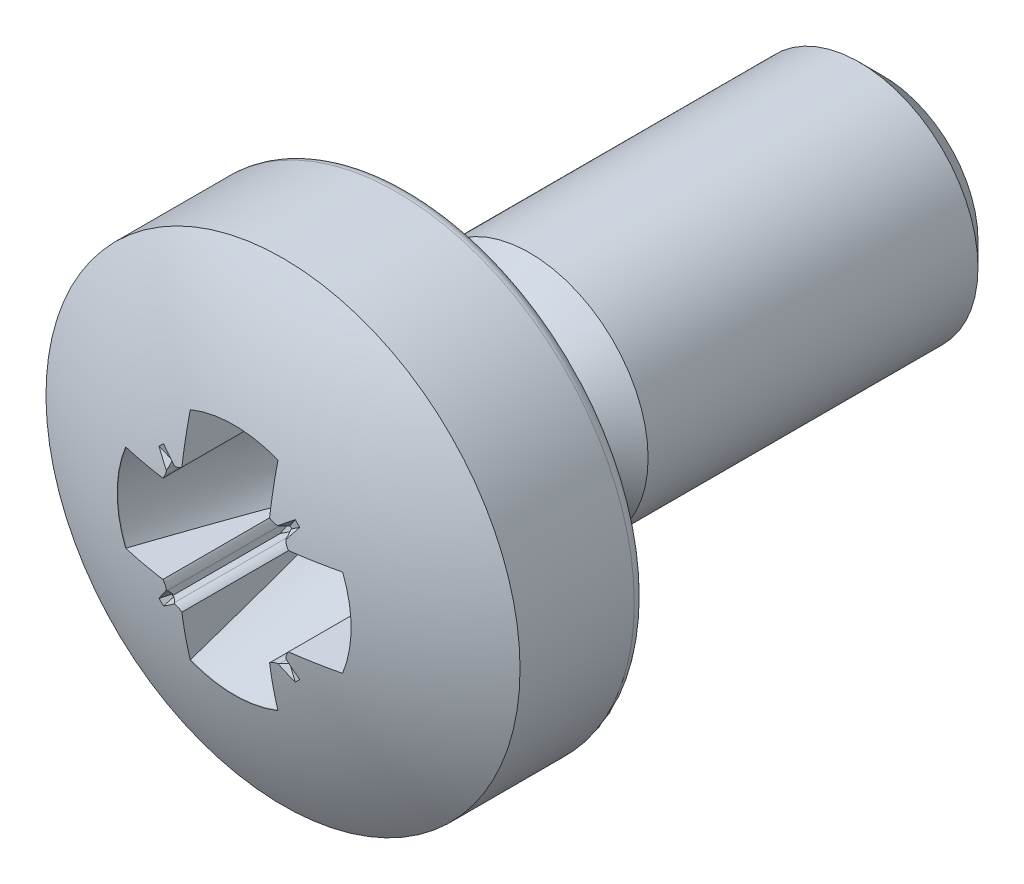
ISO-10303-21;
HEADER;
FILE_DESCRIPTION(('STEP AP214'),'2;1');
FILE_NAME('part.step','',(''),(''),'','','');
FILE_SCHEMA(('AUTOMOTIVE_DESIGN { 1 0 10303 214 1 1 1 1 }'));
ENDSEC;
DATA;
#1=APPLICATION_CONTEXT('core data for automotive mechanical design processes');
#2=APPLICATION_PROTOCOL_DEFINITION('international standard','automotive_design',2000,#1);
#3=PRODUCT_CONTEXT('',#1,'mechanical');
#4=PRODUCT('Part','Part','',(#3));
#5=PRODUCT_RELATED_PRODUCT_CATEGORY('part','',(#4));
#6=PRODUCT_DEFINITION_FORMATION('','',#4);
#7=PRODUCT_DEFINITION_CONTEXT('part definition',#1,'design');
#8=PRODUCT_DEFINITION('design','',#6,#7);
#9=PRODUCT_DEFINITION_SHAPE('','',#8);
#10=(LENGTH_UNIT() NAMED_UNIT(*) SI_UNIT(.MILLI.,.METRE.));
#11=(NAMED_UNIT(*) PLANE_ANGLE_UNIT() SI_UNIT($,.RADIAN.));
#12=(NAMED_UNIT(*) SI_UNIT($,.STERADIAN.) SOLID_ANGLE_UNIT());
#13=UNCERTAINTY_MEASURE_WITH_UNIT(LENGTH_MEASURE(1.E-05),#10,'distance_accuracy_value','');
#14=(GEOMETRIC_REPRESENTATION_CONTEXT(3) GLOBAL_UNCERTAINTY_ASSIGNED_CONTEXT((#13)) GLOBAL_UNIT_ASSIGNED_CONTEXT((#10,
#11,#12)) REPRESENTATION_CONTEXT('',''));
#15=CARTESIAN_POINT('',(0.,0.,0.));
#16=DIRECTION('',(0.,0.,1.));
#17=DIRECTION('',(1.,0.,0.));
#18=AXIS2_PLACEMENT_3D('',#15,#16,#17);
#19=CARTESIAN_POINT('',(0.,0.,-2.4));
#20=DIRECTION('',(0.,0.,1.));
#21=DIRECTION('',(0.,1.,0.));
#22=AXIS2_PLACEMENT_3D('',#19,#20,#21);
#23=SPHERICAL_SURFACE('',#22,4.);
#24=CARTESIAN_POINT('',(0.37,0.,-2.4));
#25=DIRECTION('',(1.,0.,0.));
#26=DIRECTION('',(0.,-1.,0.));
#27=AXIS2_PLACEMENT_3D('',#24,#25,#26);
#28=CIRCLE('',#27,3.98285073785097);
#29=CARTESIAN_POINT('',(0.37,-0.529627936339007,1.54747948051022));
#30=VERTEX_POINT('',#29);
#31=CARTESIAN_POINT('',(0.37,-0.915017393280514,1.47631824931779));
#32=VERTEX_POINT('',#31);
#33=EDGE_CURVE('E798',#30,#32,#28,.T.);
#34=ORIENTED_EDGE('',*,*,#33,.T.);
#35=CARTESIAN_POINT('',(0.,0.,1.47631824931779));
#36=DIRECTION('',(0.,0.,1.));
#37=DIRECTION('',(0.,-1.,0.));
#38=AXIS2_PLACEMENT_3D('',#35,#36,#37);
#39=CIRCLE('',#38,0.986993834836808);
#40=CARTESIAN_POINT('',(-0.37,-0.915017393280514,1.47631824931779));
#41=VERTEX_POINT('',#40);
#42=EDGE_CURVE('E809',#32,#41,#39,.F.);
#43=ORIENTED_EDGE('',*,*,#42,.T.);
#44=CARTESIAN_POINT('',(-0.37,0.,-2.4));
#45=DIRECTION('',(1.,0.,0.));
#46=DIRECTION('',(0.,0.,-1.));
#47=AXIS2_PLACEMENT_3D('',#44,#45,#46);
#48=CIRCLE('',#47,3.98285073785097);
#49=CARTESIAN_POINT('',(-0.37,-0.529627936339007,1.54747948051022));
#50=VERTEX_POINT('',#49);
#51=EDGE_CURVE('E812',#50,#41,#48,.T.);
#52=ORIENTED_EDGE('',*,*,#51,.F.);
#53=CARTESIAN_POINT('',(-0.444476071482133,-0.502939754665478,1.54328449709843));
#54=CARTESIAN_POINT('',(-0.437207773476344,-0.503186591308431,1.54407249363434));
#55=CARTESIAN_POINT('',(-0.429949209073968,-0.504057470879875,1.54475901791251));
#56=CARTESIAN_POINT('',(-0.415846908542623,-0.506963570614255,1.54589782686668));
#57=CARTESIAN_POINT('',(-0.408997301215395,-0.508968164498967,1.54635569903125));
#58=CARTESIAN_POINT('',(-0.396636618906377,-0.513720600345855,1.54699990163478));
#59=CARTESIAN_POINT('',(-0.39107194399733,-0.516326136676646,1.54721515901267));
#60=CARTESIAN_POINT('',(-0.380238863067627,-0.522363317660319,1.5474795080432));
#61=CARTESIAN_POINT('',(-0.374980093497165,-0.525812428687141,1.54752470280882));
#62=CARTESIAN_POINT('',(-0.3699998,-0.529628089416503,1.54747947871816));
#63=B_SPLINE_CURVE_WITH_KNOTS('',3,(#53,#54,#55,#56,#57,#58,#59,#60,#61,#62),.UNSPECIFIED.,.F.,
.F.,(4,2,2,2,4),(0.,0.0219205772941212,0.0432754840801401,0.0616577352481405,0.08045872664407),.UNSPECIFIED.);
#64=CARTESIAN_POINT('',(-0.436062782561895,-0.5035071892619,1.54415133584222));
#65=VERTEX_POINT('',#64);
#66=EDGE_CURVE('E911',#65,#50,#63,.T.);
#67=ORIENTED_EDGE('',*,*,#66,.F.);
#68=CARTESIAN_POINT('',(-1.3257276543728,1.3257276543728,-0.961367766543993));
#69=DIRECTION('',(-0.560985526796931,0.560985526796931,0.608761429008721));
#70=DIRECTION('',(0.,-0.735373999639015,0.677661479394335));
#71=AXIS2_PLACEMENT_3D('',#68,#69,#70);
#72=CIRCLE('',#71,3.2272634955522);
#73=CARTESIAN_POINT('',(-0.555793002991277,-0.593254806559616,1.51652178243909));
#74=VERTEX_POINT('',#73);
#75=EDGE_CURVE('E913',#74,#65,#72,.T.);
#76=ORIENTED_EDGE('',*,*,#75,.F.);
#77=CARTESIAN_POINT('',(0.498047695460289,0.498047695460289,1.22151135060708));
#78=DIRECTION('',(0.134995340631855,0.134995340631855,0.981607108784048));
#79=DIRECTION('',(0.990675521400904,0.,-0.13624247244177));
#80=AXIS2_PLACEMENT_3D('',#77,#78,#79);
#81=CIRCLE('',#80,1.54549426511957);
#82=CARTESIAN_POINT('',(-0.593254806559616,-0.555793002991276,1.51652178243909));
#83=VERTEX_POINT('',#82);
#84=EDGE_CURVE('E920',#83,#74,#81,.T.);
#85=ORIENTED_EDGE('',*,*,#84,.F.);
#86=CARTESIAN_POINT('',(1.3257276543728,-1.3257276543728,-0.961367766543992));
#87=DIRECTION('',(-0.560985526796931,0.560985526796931,-0.608761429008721));
#88=DIRECTION('',(-0.735373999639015,0.,0.677661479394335));
#89=AXIS2_PLACEMENT_3D('',#86,#87,#88);
#90=CIRCLE('',#89,3.2272634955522);
#91=CARTESIAN_POINT('',(-0.503507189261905,-0.436062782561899,1.54415133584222));
#92=VERTEX_POINT('',#91);
#93=EDGE_CURVE('E1167',#83,#92,#90,.T.);
#94=ORIENTED_EDGE('',*,*,#93,.T.);
#95=CARTESIAN_POINT('',(-0.502939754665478,-0.444476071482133,1.54328449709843));
#96=CARTESIAN_POINT('',(-0.503186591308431,-0.437207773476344,1.54407249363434));
#97=CARTESIAN_POINT('',(-0.504057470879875,-0.429949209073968,1.54475901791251));
#98=CARTESIAN_POINT('',(-0.506963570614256,-0.415846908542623,1.54589782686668));
#99=CARTESIAN_POINT('',(-0.508968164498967,-0.408997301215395,1.54635569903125));
#100=CARTESIAN_POINT('',(-0.513720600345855,-0.396636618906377,1.54699990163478));
#101=CARTESIAN_POINT('',(-0.516326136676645,-0.39107194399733,1.54721515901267));
#102=CARTESIAN_POINT('',(-0.522363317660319,-0.380238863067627,1.5474795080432));
#103=CARTESIAN_POINT('',(-0.525812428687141,-0.374980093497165,1.54752470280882));
#104=CARTESIAN_POINT('',(-0.529628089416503,-0.3699998,1.54747947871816));
#105=B_SPLINE_CURVE_WITH_KNOTS('',3,(#95,#96,#97,#98,#99,#100,#101,#102,#103,#104),
.UNSPECIFIED.,.F.,.F.,(4,2,2,2,4),(0.,0.0219205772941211,0.0432754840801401,0.0616577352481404,
0.08045872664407),.UNSPECIFIED.);
#106=CARTESIAN_POINT('',(-0.529627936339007,-0.37,1.54747948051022));
#107=VERTEX_POINT('',#106);
#108=EDGE_CURVE('E1168',#92,#107,#105,.T.);
#109=ORIENTED_EDGE('',*,*,#108,.T.);
#110=CARTESIAN_POINT('',(0.,-0.37,-2.4));
#111=DIRECTION('',(0.,1.,0.));
#112=DIRECTION('',(0.,0.,1.));
#113=AXIS2_PLACEMENT_3D('',#110,#111,#112);
#114=CIRCLE('',#113,3.98285073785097);
#115=CARTESIAN_POINT('',(-0.915017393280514,-0.37,1.47631824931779));
#116=VERTEX_POINT('',#115);
#117=EDGE_CURVE('E1174',#116,#107,#114,.T.);
#118=ORIENTED_EDGE('',*,*,#117,.F.);
#119=CARTESIAN_POINT('',(0.,0.,1.47631824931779));
#120=DIRECTION('',(0.,0.,1.));
#121=DIRECTION('',(0.,-1.,0.));
#122=AXIS2_PLACEMENT_3D('',#119,#120,#121);
#123=CIRCLE('',#122,0.986993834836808);
#124=CARTESIAN_POINT('',(-0.915017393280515,0.37,1.47631824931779));
#125=VERTEX_POINT('',#124);
#126=EDGE_CURVE('E1224',#116,#125,#123,.F.);
#127=ORIENTED_EDGE('',*,*,#126,.T.);
#128=CARTESIAN_POINT('',(0.,0.37,-2.4));
#129=DIRECTION('',(0.,1.,0.));
#130=DIRECTION('',(0.,0.,1.));
#131=AXIS2_PLACEMENT_3D('',#128,#129,#130);
#132=CIRCLE('',#131,3.98285073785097);
#133=CARTESIAN_POINT('',(-0.529627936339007,0.37,1.54747948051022));
#134=VERTEX_POINT('',#133);
#135=EDGE_CURVE('E1232',#125,#134,#132,.T.);
#136=ORIENTED_EDGE('',*,*,#135,.T.);
#137=CARTESIAN_POINT('',(-0.502939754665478,0.444476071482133,1.54328449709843));
#138=CARTESIAN_POINT('',(-0.503186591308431,0.437207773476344,1.54407249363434));
#139=CARTESIAN_POINT('',(-0.504057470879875,0.429949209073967,1.54475901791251));
#140=CARTESIAN_POINT('',(-0.506963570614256,0.415846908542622,1.54589782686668));
#141=CARTESIAN_POINT('',(-0.508968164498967,0.408997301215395,1.54635569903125));
#142=CARTESIAN_POINT('',(-0.513720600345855,0.396636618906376,1.54699990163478));
#143=CARTESIAN_POINT('',(-0.516326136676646,0.391071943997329,1.54721515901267));
#144=CARTESIAN_POINT('',(-0.522363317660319,0.380238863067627,1.5474795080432));
#145=CARTESIAN_POINT('',(-0.525812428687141,0.374980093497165,1.54752470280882));
#146=CARTESIAN_POINT('',(-0.529628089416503,0.3699998,1.54747947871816));
#147=B_SPLINE_CURVE_WITH_KNOTS('',3,(#137,#138,#139,#140,#141,#142,#143,#144,#145,#146),
.UNSPECIFIED.,.F.,.F.,(4,2,2,2,4),(0.,0.0219205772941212,0.0432754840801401,0.0616577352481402,
0.0804587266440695),.UNSPECIFIED.);
#148=CARTESIAN_POINT('',(-0.503507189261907,0.436062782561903,1.54415133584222));
#149=VERTEX_POINT('',#148);
#150=EDGE_CURVE('E54',#149,#134,#147,.T.);
#151=ORIENTED_EDGE('',*,*,#150,.F.);
#152=CARTESIAN_POINT('',(1.3257276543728,1.3257276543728,-0.961367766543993));
#153=DIRECTION('',(0.560985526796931,0.560985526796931,0.608761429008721));
#154=DIRECTION('',(0.735373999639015,0.,-0.677661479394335));
#155=AXIS2_PLACEMENT_3D('',#152,#153,#154);
#156=CIRCLE('',#155,3.2272634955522);
#157=CARTESIAN_POINT('',(-0.593254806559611,0.555793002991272,1.51652178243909));
#158=VERTEX_POINT('',#157);
#159=EDGE_CURVE('E395',#158,#149,#156,.T.);
#160=ORIENTED_EDGE('',*,*,#159,.F.);
#161=CARTESIAN_POINT('',(0.498047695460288,-0.498047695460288,1.22151135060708));
#162=DIRECTION('',(0.134995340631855,-0.134995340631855,0.981607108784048));
#163=DIRECTION('',(0.,-0.990675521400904,-0.136242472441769));
#164=AXIS2_PLACEMENT_3D('',#161,#162,#163);
#165=CIRCLE('',#164,1.54549426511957);
#166=CARTESIAN_POINT('',(-0.555793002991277,0.593254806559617,1.51652178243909));
#167=VERTEX_POINT('',#166);
#168=EDGE_CURVE('E346',#167,#158,#165,.T.);
#169=ORIENTED_EDGE('',*,*,#168,.F.);
#170=CARTESIAN_POINT('',(-1.3257276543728,-1.3257276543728,-0.961367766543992));
#171=DIRECTION('',(0.560985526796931,0.560985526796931,-0.608761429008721));
#172=DIRECTION('',(-0.735373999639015,0.,-0.677661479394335));
#173=AXIS2_PLACEMENT_3D('',#170,#171,#172);
#174=CIRCLE('',#173,3.2272634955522);
#175=CARTESIAN_POINT('',(-0.436062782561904,0.503507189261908,1.54415133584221));
#176=VERTEX_POINT('',#175);
#177=EDGE_CURVE('E398',#167,#176,#174,.T.);
#178=ORIENTED_EDGE('',*,*,#177,.T.);
#179=CARTESIAN_POINT('',(-0.444476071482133,0.502939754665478,1.54328449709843));
#180=CARTESIAN_POINT('',(-0.437207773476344,0.503186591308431,1.54407249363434));
#181=CARTESIAN_POINT('',(-0.429949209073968,0.504057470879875,1.54475901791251));
#182=CARTESIAN_POINT('',(-0.415846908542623,0.506963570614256,1.54589782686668));
#183=CARTESIAN_POINT('',(-0.408997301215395,0.508968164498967,1.54635569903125));
#184=CARTESIAN_POINT('',(-0.396636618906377,0.513720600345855,1.54699990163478));
#185=CARTESIAN_POINT('',(-0.39107194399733,0.516326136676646,1.54721515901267));
#186=CARTESIAN_POINT('',(-0.380238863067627,0.522363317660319,1.5474795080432));
#187=CARTESIAN_POINT('',(-0.374980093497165,0.525812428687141,1.54752470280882));
#188=CARTESIAN_POINT('',(-0.3699998,0.529628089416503,1.54747947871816));
#189=B_SPLINE_CURVE_WITH_KNOTS('',3,(#179,#180,#181,#182,#183,#184,#185,#186,#187,#188),
.UNSPECIFIED.,.F.,.F.,(4,2,2,2,4),(0.,0.0219205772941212,0.0432754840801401,0.0616577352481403,
0.08045872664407),.UNSPECIFIED.);
#190=CARTESIAN_POINT('',(-0.37,0.529627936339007,1.54747948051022));
#191=VERTEX_POINT('',#190);
#192=EDGE_CURVE('E401',#176,#191,#189,.T.);
#193=ORIENTED_EDGE('',*,*,#192,.T.);
#194=CARTESIAN_POINT('',(-0.37,0.,-2.4));
#195=DIRECTION('',(1.,0.,0.));
#196=DIRECTION('',(0.,0.,-1.));
#197=AXIS2_PLACEMENT_3D('',#194,#195,#196);
#198=CIRCLE('',#197,3.98285073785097);
#199=CARTESIAN_POINT('',(-0.37,0.915017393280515,1.47631824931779));
#200=VERTEX_POINT('',#199);
#201=EDGE_CURVE('E408',#200,#191,#198,.T.);
#202=ORIENTED_EDGE('',*,*,#201,.F.);
#203=CARTESIAN_POINT('',(0.,0.,1.47631824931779));
#204=DIRECTION('',(0.,0.,1.));
#205=DIRECTION('',(0.,-1.,0.));
#206=AXIS2_PLACEMENT_3D('',#203,#204,#205);
#207=CIRCLE('',#206,0.986993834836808);
#208=CARTESIAN_POINT('',(0.37,0.915017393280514,1.47631824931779));
#209=VERTEX_POINT('',#208);
#210=EDGE_CURVE('E1680',#200,#209,#207,.F.);
#211=ORIENTED_EDGE('',*,*,#210,.T.);
#212=CARTESIAN_POINT('',(0.37,0.,-2.4));
#213=DIRECTION('',(1.,0.,0.));
#214=DIRECTION('',(0.,0.,-1.));
#215=AXIS2_PLACEMENT_3D('',#212,#213,#214);
#216=CIRCLE('',#215,3.98285073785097);
#217=CARTESIAN_POINT('',(0.37,0.529627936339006,1.54747948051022));
#218=VERTEX_POINT('',#217);
#219=EDGE_CURVE('E1681',#209,#218,#216,.T.);
#220=ORIENTED_EDGE('',*,*,#219,.T.);
#221=CARTESIAN_POINT('',(0.444476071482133,0.502939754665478,1.54328449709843));
#222=CARTESIAN_POINT('',(0.437207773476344,0.503186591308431,1.54407249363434));
#223=CARTESIAN_POINT('',(0.429949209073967,0.504057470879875,1.54475901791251));
#224=CARTESIAN_POINT('',(0.415846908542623,0.506963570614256,1.54589782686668));
#225=CARTESIAN_POINT('',(0.408997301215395,0.508968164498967,1.54635569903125));
#226=CARTESIAN_POINT('',(0.396636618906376,0.513720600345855,1.54699990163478));
#227=CARTESIAN_POINT('',(0.391071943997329,0.516326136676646,1.54721515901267));
#228=CARTESIAN_POINT('',(0.380238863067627,0.522363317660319,1.5474795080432));
#229=CARTESIAN_POINT('',(0.374980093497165,0.525812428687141,1.54752470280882));
#230=CARTESIAN_POINT('',(0.3699998,0.529628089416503,1.54747947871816));
#231=B_SPLINE_CURVE_WITH_KNOTS('',3,(#221,#222,#223,#224,#225,#226,#227,#228,#229,#230),
.UNSPECIFIED.,.F.,.F.,(4,2,2,2,4),(0.,0.0219205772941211,0.0432754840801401,0.0616577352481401,
0.0804587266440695),.UNSPECIFIED.);
#232=CARTESIAN_POINT('',(0.43606278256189,0.503507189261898,1.54415133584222));
#233=VERTEX_POINT('',#232);
#234=EDGE_CURVE('E1238',#233,#218,#231,.T.);
#235=ORIENTED_EDGE('',*,*,#234,.F.);
#236=CARTESIAN_POINT('',(1.3257276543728,-1.3257276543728,-0.961367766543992));
#237=DIRECTION('',(0.560985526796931,-0.560985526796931,0.608761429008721));
#238=DIRECTION('',(0.,-0.735373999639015,-0.677661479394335));
#239=AXIS2_PLACEMENT_3D('',#236,#237,#238);
#240=CIRCLE('',#239,3.2272634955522);
#241=CARTESIAN_POINT('',(0.555793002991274,0.593254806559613,1.51652178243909));
#242=VERTEX_POINT('',#241);
#243=EDGE_CURVE('E1230',#242,#233,#240,.T.);
#244=ORIENTED_EDGE('',*,*,#243,.F.);
#245=CARTESIAN_POINT('',(-0.498047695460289,-0.498047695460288,1.22151135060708));
#246=DIRECTION('',(-0.134995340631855,-0.134995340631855,0.981607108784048));
#247=DIRECTION('',(0.990675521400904,0.,0.13624247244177));
#248=AXIS2_PLACEMENT_3D('',#245,#246,#247);
#249=CIRCLE('',#248,1.54549426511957);
#250=CARTESIAN_POINT('',(0.593254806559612,0.555793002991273,1.51652178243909));
#251=VERTEX_POINT('',#250);
#252=EDGE_CURVE('E1228',#251,#242,#249,.T.);
#253=ORIENTED_EDGE('',*,*,#252,.F.);
#254=CARTESIAN_POINT('',(-1.3257276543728,1.3257276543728,-0.961367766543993));
#255=DIRECTION('',(0.560985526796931,-0.560985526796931,-0.608761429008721));
#256=DIRECTION('',(0.,0.735373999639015,-0.677661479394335));
#257=AXIS2_PLACEMENT_3D('',#254,#255,#256);
#258=CIRCLE('',#257,3.2272634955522);
#259=CARTESIAN_POINT('',(0.503507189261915,0.436062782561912,1.54415133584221));
#260=VERTEX_POINT('',#259);
#261=EDGE_CURVE('E1223',#251,#260,#258,.T.);
#262=ORIENTED_EDGE('',*,*,#261,.T.);
#263=CARTESIAN_POINT('',(0.502939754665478,0.444476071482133,1.54328449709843));
#264=CARTESIAN_POINT('',(0.503186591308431,0.437207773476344,1.54407249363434));
#265=CARTESIAN_POINT('',(0.504057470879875,0.429949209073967,1.54475901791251));
#266=CARTESIAN_POINT('',(0.506963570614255,0.415846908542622,1.54589782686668));
#267=CARTESIAN_POINT('',(0.508968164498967,0.408997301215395,1.54635569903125));
#268=CARTESIAN_POINT('',(0.513720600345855,0.396636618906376,1.54699990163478));
#269=CARTESIAN_POINT('',(0.516326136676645,0.391071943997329,1.54721515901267));
#270=CARTESIAN_POINT('',(0.522363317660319,0.380238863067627,1.5474795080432));
#271=CARTESIAN_POINT('',(0.525812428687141,0.374980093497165,1.54752470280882));
#272=CARTESIAN_POINT('',(0.529628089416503,0.3699998,1.54747947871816));
#273=B_SPLINE_CURVE_WITH_KNOTS('',3,(#263,#264,#265,#266,#267,#268,#269,#270,#271,#272),
.UNSPECIFIED.,.F.,.F.,(4,2,2,2,4),(0.,0.0219205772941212,0.0432754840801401,0.0616577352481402,
0.0804587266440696),.UNSPECIFIED.);
#274=CARTESIAN_POINT('',(0.529627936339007,0.37,1.54747948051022));
#275=VERTEX_POINT('',#274);
#276=EDGE_CURVE('E1166',#260,#275,#273,.T.);
#277=ORIENTED_EDGE('',*,*,#276,.T.);
#278=CARTESIAN_POINT('',(0.,0.37,-2.4));
#279=DIRECTION('',(0.,1.,0.));
#280=DIRECTION('',(0.,0.,1.));
#281=AXIS2_PLACEMENT_3D('',#278,#279,#280);
#282=CIRCLE('',#281,3.98285073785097);
#283=CARTESIAN_POINT('',(0.915017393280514,0.37,1.47631824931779));
#284=VERTEX_POINT('',#283);
#285=EDGE_CURVE('E1171',#275,#284,#282,.T.);
#286=ORIENTED_EDGE('',*,*,#285,.T.);
#287=CARTESIAN_POINT('',(0.,0.,1.47631824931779));
#288=DIRECTION('',(0.,0.,1.));
#289=DIRECTION('',(0.,-1.,0.));
#290=AXIS2_PLACEMENT_3D('',#287,#288,#289);
#291=CIRCLE('',#290,0.986993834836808);
#292=CARTESIAN_POINT('',(0.915017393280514,-0.37,1.47631824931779));
#293=VERTEX_POINT('',#292);
#294=EDGE_CURVE('E1674',#284,#293,#291,.F.);
#295=ORIENTED_EDGE('',*,*,#294,.T.);
#296=CARTESIAN_POINT('',(0.,-0.37,-2.4));
#297=DIRECTION('',(0.,1.,0.));
#298=DIRECTION('',(0.,0.,1.));
#299=AXIS2_PLACEMENT_3D('',#296,#297,#298);
#300=CIRCLE('',#299,3.98285073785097);
#301=CARTESIAN_POINT('',(0.529627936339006,-0.37,1.54747948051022));
#302=VERTEX_POINT('',#301);
#303=EDGE_CURVE('E1204',#302,#293,#300,.T.);
#304=ORIENTED_EDGE('',*,*,#303,.F.);
#305=CARTESIAN_POINT('',(0.502939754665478,-0.444476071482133,1.54328449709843));
#306=CARTESIAN_POINT('',(0.503186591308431,-0.437207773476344,1.54407249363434));
#307=CARTESIAN_POINT('',(0.504057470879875,-0.429949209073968,1.54475901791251));
#308=CARTESIAN_POINT('',(0.506963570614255,-0.415846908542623,1.54589782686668));
#309=CARTESIAN_POINT('',(0.508968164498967,-0.408997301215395,1.54635569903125));
#310=CARTESIAN_POINT('',(0.513720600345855,-0.396636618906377,1.54699990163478));
#311=CARTESIAN_POINT('',(0.516326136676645,-0.39107194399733,1.54721515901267));
#312=CARTESIAN_POINT('',(0.522363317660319,-0.380238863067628,1.5474795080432));
#313=CARTESIAN_POINT('',(0.525812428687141,-0.374980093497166,1.54752470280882));
#314=CARTESIAN_POINT('',(0.529628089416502,-0.3699998,1.54747947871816));
#315=B_SPLINE_CURVE_WITH_KNOTS('',3,(#305,#306,#307,#308,#309,#310,#311,#312,#313,#314),
.UNSPECIFIED.,.F.,.F.,(4,2,2,2,4),(0.,0.0219205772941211,0.0432754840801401,0.0616577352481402,
0.0804587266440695),.UNSPECIFIED.);
#316=CARTESIAN_POINT('',(0.5035071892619,-0.436062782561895,1.54415133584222));
#317=VERTEX_POINT('',#316);
#318=EDGE_CURVE('E1197',#317,#302,#315,.T.);
#319=ORIENTED_EDGE('',*,*,#318,.F.);
#320=CARTESIAN_POINT('',(-1.3257276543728,-1.3257276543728,-0.961367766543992));
#321=DIRECTION('',(-0.560985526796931,-0.560985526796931,0.608761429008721));
#322=DIRECTION('',(0.735373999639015,0.,0.677661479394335));
#323=AXIS2_PLACEMENT_3D('',#320,#321,#322);
#324=CIRCLE('',#323,3.2272634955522);
#325=CARTESIAN_POINT('',(0.593254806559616,-0.555793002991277,1.51652178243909));
#326=VERTEX_POINT('',#325);
#327=EDGE_CURVE('E1203',#326,#317,#324,.T.);
#328=ORIENTED_EDGE('',*,*,#327,.F.);
#329=CARTESIAN_POINT('',(-0.498047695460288,0.498047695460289,1.22151135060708));
#330=DIRECTION('',(-0.134995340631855,0.134995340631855,0.981607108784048));
#331=DIRECTION('',(0.,-0.990675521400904,0.13624247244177));
#332=AXIS2_PLACEMENT_3D('',#329,#330,#331);
#333=CIRCLE('',#332,1.54549426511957);
#334=CARTESIAN_POINT('',(0.555793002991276,-0.593254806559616,1.51652178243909));
#335=VERTEX_POINT('',#334);
#336=EDGE_CURVE('E916',#335,#326,#333,.T.);
#337=ORIENTED_EDGE('',*,*,#336,.F.);
#338=CARTESIAN_POINT('',(1.3257276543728,1.3257276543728,-0.961367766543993));
#339=DIRECTION('',(-0.560985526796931,-0.560985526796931,-0.608761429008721));
#340=DIRECTION('',(-0.735373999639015,0.,0.677661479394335));
#341=AXIS2_PLACEMENT_3D('',#338,#339,#340);
#342=CIRCLE('',#341,3.2272634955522);
#343=CARTESIAN_POINT('',(0.436062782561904,-0.503507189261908,1.54415133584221));
#344=VERTEX_POINT('',#343);
#345=EDGE_CURVE('E918',#335,#344,#342,.T.);
#346=ORIENTED_EDGE('',*,*,#345,.T.);
#347=CARTESIAN_POINT('',(0.444476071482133,-0.502939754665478,1.54328449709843));
#348=CARTESIAN_POINT('',(0.437207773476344,-0.503186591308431,1.54407249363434));
#349=CARTESIAN_POINT('',(0.429949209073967,-0.504057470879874,1.54475901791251));
#350=CARTESIAN_POINT('',(0.415846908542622,-0.506963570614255,1.54589782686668));
#351=CARTESIAN_POINT('',(0.408997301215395,-0.508968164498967,1.54635569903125));
#352=CARTESIAN_POINT('',(0.396636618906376,-0.513720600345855,1.54699990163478));
#353=CARTESIAN_POINT('',(0.391071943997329,-0.516326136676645,1.54721515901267));
#354=CARTESIAN_POINT('',(0.380238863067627,-0.522363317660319,1.5474795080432));
#355=CARTESIAN_POINT('',(0.374980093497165,-0.525812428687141,1.54752470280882));
#356=CARTESIAN_POINT('',(0.3699998,-0.529628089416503,1.54747947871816));
#357=B_SPLINE_CURVE_WITH_KNOTS('',3,(#347,#348,#349,#350,#351,#352,#353,#354,#355,#356),
.UNSPECIFIED.,.F.,.F.,(4,2,2,2,4),(0.,0.0219205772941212,0.0432754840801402,0.0616577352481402,
0.0804587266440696),.UNSPECIFIED.);
#358=EDGE_CURVE('E811',#344,#30,#357,.T.);
#359=ORIENTED_EDGE('',*,*,#358,.T.);
#360=EDGE_LOOP('',(#34,#43,#52,#67,#76,#85,#94,#109,#118,#127,#136,#151,#160,#169,#178,#193,
#202,#211,#220,#235,#244,#253,#262,#277,#286,#295,#304,#319,#328,#337,#346,#359));
#361=FACE_BOUND('',#360,.T.);
#362=CARTESIAN_POINT('',(0.,0.,1.06410161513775));
#363=DIRECTION('',(0.,0.,1.));
#364=DIRECTION('',(1.,0.,0.));
#365=AXIS2_PLACEMENT_3D('',#362,#363,#364);
#366=CIRCLE('',#365,2.);
#367=CARTESIAN_POINT('',(2.,0.,1.06410161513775));
#368=VERTEX_POINT('',#367);
#369=EDGE_CURVE('E365',#368,#368,#366,.T.);
#370=ORIENTED_EDGE('',*,*,#369,.T.);
#371=EDGE_LOOP('',(#370));
#372=FACE_BOUND('',#371,.T.);
#373=ADVANCED_FACE('F31',(#361,#372),#23,.T.);
#374=CARTESIAN_POINT('',(0.,0.,-4.));
#375=DIRECTION('',(0.,0.,1.));
#376=DIRECTION('',(1.,0.,0.));
#377=AXIS2_PLACEMENT_3D('',#374,#375,#376);
#378=PLANE('',#377);
#379=CARTESIAN_POINT('',(0.,0.,-4.));
#380=DIRECTION('',(0.,0.,1.));
#381=DIRECTION('',(1.,0.,0.));
#382=AXIS2_PLACEMENT_3D('',#379,#380,#381);
#383=CIRCLE('',#382,0.799999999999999);
#384=CARTESIAN_POINT('',(0.799999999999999,0.,-4.));
#385=VERTEX_POINT('',#384);
#386=EDGE_CURVE('E11',#385,#385,#383,.F.);
#387=ORIENTED_EDGE('',*,*,#386,.T.);
#388=EDGE_LOOP('',(#387));
#389=FACE_BOUND('',#388,.T.);
#390=ADVANCED_FACE('F835',(#389),#378,.F.);
#391=CARTESIAN_POINT('',(0.,0.,0.));
#392=DIRECTION('',(0.,0.,1.));
#393=DIRECTION('',(1.,0.,0.));
#394=AXIS2_PLACEMENT_3D('',#391,#392,#393);
#395=CYLINDRICAL_SURFACE('',#394,1.);
#396=CARTESIAN_POINT('',(0.,0.,-3.8));
#397=DIRECTION('',(0.,0.,1.));
#398=DIRECTION('',(1.,0.,0.));
#399=AXIS2_PLACEMENT_3D('',#396,#397,#398);
#400=CIRCLE('',#399,1.);
#401=CARTESIAN_POINT('',(1.,0.,-3.8));
#402=VERTEX_POINT('',#401);
#403=EDGE_CURVE('E39',#402,#402,#400,.T.);
#404=ORIENTED_EDGE('',*,*,#403,.T.);
#405=EDGE_LOOP('',(#404));
#406=FACE_BOUND('',#405,.T.);
#407=CARTESIAN_POINT('',(0.,0.,-1.0165));
#408=DIRECTION('',(0.,0.,1.));
#409=DIRECTION('',(1.,0.,0.));
#410=AXIS2_PLACEMENT_3D('',#407,#408,#409);
#411=CIRCLE('',#410,1.);
#412=CARTESIAN_POINT('',(1.,0.,-1.0165));
#413=VERTEX_POINT('',#412);
#414=EDGE_CURVE('E392',#413,#413,#411,.T.);
#415=ORIENTED_EDGE('',*,*,#414,.F.);
#416=EDGE_LOOP('',(#415));
#417=FACE_BOUND('',#416,.T.);
#418=ADVANCED_FACE('F820',(#406,#417),#395,.T.);
#419=CARTESIAN_POINT('',(0.,0.,-1.0165));
#420=DIRECTION('',(0.,0.,-1.));
#421=DIRECTION('',(-1.,0.,0.));
#422=AXIS2_PLACEMENT_3D('',#419,#420,#421);
#423=CONICAL_SURFACE('',#422,1.,0.785398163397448);
#424=CARTESIAN_POINT('',(0.,0.,-0.8));
#425=DIRECTION('',(0.,0.,1.));
#426=DIRECTION('',(1.,0.,0.));
#427=AXIS2_PLACEMENT_3D('',#424,#425,#426);
#428=CIRCLE('',#427,0.7835);
#429=CARTESIAN_POINT('',(0.7835,0.,-0.8));
#430=VERTEX_POINT('',#429);
#431=EDGE_CURVE('E389',#430,#430,#428,.T.);
#432=ORIENTED_EDGE('',*,*,#431,.F.);
#433=EDGE_LOOP('',(#432));
#434=FACE_BOUND('',#433,.T.);
#435=ORIENTED_EDGE('',*,*,#414,.T.);
#436=EDGE_LOOP('',(#435));
#437=FACE_BOUND('',#436,.T.);
#438=ADVANCED_FACE('F843',(#434,#437),#423,.T.);
#439=CARTESIAN_POINT('',(0.,0.,0.));
#440=DIRECTION('',(0.,0.,1.));
#441=DIRECTION('',(1.,0.,0.));
#442=AXIS2_PLACEMENT_3D('',#439,#440,#441);
#443=CYLINDRICAL_SURFACE('',#442,0.7835);
#444=CARTESIAN_POINT('',(0.,0.,-0.76));
#445=DIRECTION('',(0.,0.,1.));
#446=DIRECTION('',(1.,0.,0.));
#447=AXIS2_PLACEMENT_3D('',#444,#445,#446);
#448=CIRCLE('',#447,0.7835);
#449=CARTESIAN_POINT('',(0.7835,0.,-0.76));
#450=VERTEX_POINT('',#449);
#451=EDGE_CURVE('E386',#450,#450,#448,.T.);
#452=ORIENTED_EDGE('',*,*,#451,.F.);
#453=EDGE_LOOP('',(#452));
#454=FACE_BOUND('',#453,.T.);
#455=ORIENTED_EDGE('',*,*,#431,.T.);
#456=EDGE_LOOP('',(#455));
#457=FACE_BOUND('',#456,.T.);
#458=ADVANCED_FACE('F848',(#454,#457),#443,.T.);
#459=CARTESIAN_POINT('',(0.,0.,-0.76));
#460=DIRECTION('',(0.,0.,1.));
#461=DIRECTION('',(1.,0.,0.));
#462=AXIS2_PLACEMENT_3D('',#459,#460,#461);
#463=TOROIDAL_SURFACE('',#462,0.8835,0.1);
#464=ORIENTED_EDGE('',*,*,#451,.T.);
#465=EDGE_LOOP('',(#464));
#466=FACE_BOUND('',#465,.T.);
#467=CARTESIAN_POINT('',(0.,0.,-0.716760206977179));
#468=DIRECTION('',(0.,0.,1.));
#469=DIRECTION('',(1.,0.,0.));
#470=AXIS2_PLACEMENT_3D('',#467,#468,#469);
#471=CIRCLE('',#470,0.793331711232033);
#472=CARTESIAN_POINT('',(0.793331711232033,0.,-0.716760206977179));
#473=VERTEX_POINT('',#472);
#474=EDGE_CURVE('E383',#473,#473,#471,.T.);
#475=ORIENTED_EDGE('',*,*,#474,.F.);
#476=EDGE_LOOP('',(#475));
#477=FACE_BOUND('',#476,.T.);
#478=ADVANCED_FACE('F852',(#466,#477),#463,.F.);
#479=CARTESIAN_POINT('',(0.,0.,-0.716760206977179));
#480=DIRECTION('',(0.,0.,1.));
#481=DIRECTION('',(1.,0.,0.));
#482=AXIS2_PLACEMENT_3D('',#479,#480,#481);
#483=CONICAL_SURFACE('',#482,0.793331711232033,0.447150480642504);
#484=CARTESIAN_POINT('',(0.,0.,-0.0567602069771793));
#485=DIRECTION('',(0.,0.,1.));
#486=DIRECTION('',(1.,0.,0.));
#487=AXIS2_PLACEMENT_3D('',#484,#485,#486);
#488=CIRCLE('',#487,1.10983171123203);
#489=CARTESIAN_POINT('',(1.10983171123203,0.,-0.0567602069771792));
#490=VERTEX_POINT('',#489);
#491=EDGE_CURVE('E380',#490,#490,#488,.T.);
#492=ORIENTED_EDGE('',*,*,#491,.F.);
#493=EDGE_LOOP('',(#492));
#494=FACE_BOUND('',#493,.T.);
#495=ORIENTED_EDGE('',*,*,#474,.T.);
#496=EDGE_LOOP('',(#495));
#497=FACE_BOUND('',#496,.T.);
#498=ADVANCED_FACE('F856',(#494,#497),#483,.T.);
#499=CARTESIAN_POINT('',(0.,0.,-0.1));
#500=DIRECTION('',(0.,0.,1.));
#501=DIRECTION('',(1.,0.,0.));
#502=AXIS2_PLACEMENT_3D('',#499,#500,#501);
#503=TOROIDAL_SURFACE('',#502,1.2,0.1);
#504=ORIENTED_EDGE('',*,*,#491,.T.);
#505=EDGE_LOOP('',(#504));
#506=FACE_BOUND('',#505,.T.);
#507=CARTESIAN_POINT('',(0.,0.,0.));
#508=DIRECTION('',(0.,0.,1.));
#509=DIRECTION('',(1.,0.,0.));
#510=AXIS2_PLACEMENT_3D('',#507,#508,#509);
#511=CIRCLE('',#510,1.2);
#512=CARTESIAN_POINT('',(1.2,0.,0.));
#513=VERTEX_POINT('',#512);
#514=EDGE_CURVE('E377',#513,#513,#511,.T.);
#515=ORIENTED_EDGE('',*,*,#514,.F.);
#516=EDGE_LOOP('',(#515));
#517=FACE_BOUND('',#516,.T.);
#518=ADVANCED_FACE('F860',(#506,#517),#503,.F.);
#519=CARTESIAN_POINT('',(0.,1.2,0.));
#520=DIRECTION('',(0.,0.,1.));
#521=DIRECTION('',(1.,0.,0.));
#522=AXIS2_PLACEMENT_3D('',#519,#520,#521);
#523=PLANE('',#522);
#524=CARTESIAN_POINT('',(0.,0.,0.));
#525=DIRECTION('',(0.,0.,1.));
#526=DIRECTION('',(1.,0.,0.));
#527=AXIS2_PLACEMENT_3D('',#524,#525,#526);
#528=CIRCLE('',#527,1.9);
#529=CARTESIAN_POINT('',(1.9,0.,0.));
#530=VERTEX_POINT('',#529);
#531=EDGE_CURVE('E374',#530,#530,#528,.T.);
#532=ORIENTED_EDGE('',*,*,#531,.F.);
#533=EDGE_LOOP('',(#532));
#534=FACE_BOUND('',#533,.T.);
#535=ORIENTED_EDGE('',*,*,#514,.T.);
#536=EDGE_LOOP('',(#535));
#537=FACE_BOUND('',#536,.T.);
#538=ADVANCED_FACE('F864',(#534,#537),#523,.F.);
#539=CARTESIAN_POINT('',(0.,0.,0.1));
#540=DIRECTION('',(0.,0.,1.));
#541=DIRECTION('',(1.,0.,0.));
#542=AXIS2_PLACEMENT_3D('',#539,#540,#541);
#543=TOROIDAL_SURFACE('',#542,1.9,0.1);
#544=CARTESIAN_POINT('',(0.,0.,0.1));
#545=DIRECTION('',(0.,0.,1.));
#546=DIRECTION('',(1.,0.,0.));
#547=AXIS2_PLACEMENT_3D('',#544,#545,#546);
#548=CIRCLE('',#547,2.);
#549=CARTESIAN_POINT('',(2.,0.,0.1));
#550=VERTEX_POINT('',#549);
#551=EDGE_CURVE('E371',#550,#550,#548,.T.);
#552=ORIENTED_EDGE('',*,*,#551,.F.);
#553=EDGE_LOOP('',(#552));
#554=FACE_BOUND('',#553,.T.);
#555=ORIENTED_EDGE('',*,*,#531,.T.);
#556=EDGE_LOOP('',(#555));
#557=FACE_BOUND('',#556,.T.);
#558=ADVANCED_FACE('F867',(#554,#557),#543,.T.);
#559=CARTESIAN_POINT('',(0.,0.,0.));
#560=DIRECTION('',(0.,0.,1.));
#561=DIRECTION('',(1.,0.,0.));
#562=AXIS2_PLACEMENT_3D('',#559,#560,#561);
#563=CYLINDRICAL_SURFACE('',#562,2.);
#564=ORIENTED_EDGE('',*,*,#369,.F.);
#565=EDGE_LOOP('',(#564));
#566=FACE_BOUND('',#565,.T.);
#567=ORIENTED_EDGE('',*,*,#551,.T.);
#568=EDGE_LOOP('',(#567));
#569=FACE_BOUND('',#568,.T.);
#570=ADVANCED_FACE('F464',(#566,#569),#563,.T.);
#571=CARTESIAN_POINT('',(-0.37,0.37,0.0810717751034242));
#572=DIRECTION('',(0.,1.,0.));
#573=DIRECTION('',(1.,0.,0.));
#574=AXIS2_PLACEMENT_3D('',#571,#572,#573);
#575=PLANE('',#574);
#576=CARTESIAN_POINT('',(-0.883475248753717,0.37,1.26392868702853));
#577=CARTESIAN_POINT('',(-0.879613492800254,0.37,1.27912860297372));
#578=CARTESIAN_POINT('',(-0.877064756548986,0.37,1.29465876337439));
#579=CARTESIAN_POINT('',(-0.874617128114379,0.37,1.32588840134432));
#580=CARTESIAN_POINT('',(-0.874711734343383,0.37,1.34158736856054));
#581=CARTESIAN_POINT('',(-0.87755622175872,0.37,1.37275152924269));
#582=CARTESIAN_POINT('',(-0.880307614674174,0.37,1.38821658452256));
#583=CARTESIAN_POINT('',(-0.888341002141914,0.37,1.41848251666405));
#584=CARTESIAN_POINT('',(-0.893624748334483,0.37,1.43328292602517));
#585=CARTESIAN_POINT('',(-0.90658589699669,0.37,1.46200583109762));
#586=CARTESIAN_POINT('',(-0.9142916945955,0.37,1.47591542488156));
#587=CARTESIAN_POINT('',(-0.931787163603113,0.37,1.50232487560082));
#588=CARTESIAN_POINT('',(-0.941572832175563,0.37,1.51482737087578));
#589=CARTESIAN_POINT('',(-0.955167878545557,0.37,1.52971024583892));
#590=CARTESIAN_POINT('',(-0.958167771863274,0.37,1.53285879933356));
#591=CARTESIAN_POINT('',(-0.974090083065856,0.37,1.54888737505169));
#592=CARTESIAN_POINT('',(-0.988099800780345,0.37,1.5607277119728));
#593=CARTESIAN_POINT('',(-1.01794007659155,0.37,1.58189875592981));
#594=CARTESIAN_POINT('',(-1.03377597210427,0.37,1.59122182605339));
#595=CARTESIAN_POINT('',(-1.06673643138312,0.37,1.60709865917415));
#596=CARTESIAN_POINT('',(-1.08385787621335,0.37,1.61365888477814));
#597=CARTESIAN_POINT('',(-1.11893175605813,0.37,1.62387498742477));
#598=CARTESIAN_POINT('',(-1.13688360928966,0.37,1.62753286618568));
#599=CARTESIAN_POINT('',(-1.17353006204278,0.37,1.63188988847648));
#600=CARTESIAN_POINT('',(-1.19223234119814,0.37,1.63252498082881));
#601=CARTESIAN_POINT('',(-1.2294789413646,0.37,1.63060772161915));
#602=CARTESIAN_POINT('',(-1.24802323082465,0.37,1.62805474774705));
#603=CARTESIAN_POINT('',(-1.28417513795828,0.37,1.61983347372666));
#604=CARTESIAN_POINT('',(-1.30179135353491,0.37,1.61420310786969));
#605=CARTESIAN_POINT('',(-1.33577476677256,0.37,1.5999640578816));
#606=CARTESIAN_POINT('',(-1.35214235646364,0.37,1.59135631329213));
#607=CARTESIAN_POINT('',(-1.38257487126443,0.37,1.57170840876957));
#608=CARTESIAN_POINT('',(-1.39669847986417,0.37,1.56075917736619));
#609=CARTESIAN_POINT('',(-1.42281745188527,0.37,1.53656354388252));
#610=CARTESIAN_POINT('',(-1.43481340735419,0.37,1.52331778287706));
#611=CARTESIAN_POINT('',(-1.45585618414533,0.37,1.49544360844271));
#612=CARTESIAN_POINT('',(-1.46499739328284,0.37,1.48088644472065));
#613=CARTESIAN_POINT('',(-1.48065493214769,0.37,1.45039005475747));
#614=CARTESIAN_POINT('',(-1.48716628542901,0.37,1.43444827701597));
#615=CARTESIAN_POINT('',(-1.49220960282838,0.37,1.41804052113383));
#616=B_SPLINE_CURVE_WITH_KNOTS('',3,(#576,#577,#578,#579,#580,#581,#582,#583,#584,#585,#586,
#587,#588,#589,#590,#591,#592,#593,#594,#595,#596,#597,#598,#599,#600,#601,#602,#603,#604,#605,
#606,#607,#608,#609,#610,#611,#612,#613,#614,#615),.UNSPECIFIED.,.F.,.F.,(4,2,2,2,2,2,2,2,2,2,2,
2,2,2,2,2,2,2,2,4),(0.,0.0469886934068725,0.0938618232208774,0.140761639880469,
0.187693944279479,0.235198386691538,0.282612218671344,0.295658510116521,0.350376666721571,
0.405259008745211,0.460012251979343,0.514727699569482,0.570597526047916,0.626478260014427,
0.681685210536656,0.736874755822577,0.790219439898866,0.843549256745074,0.894861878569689,
0.946271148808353),.UNSPECIFIED.);
#617=CARTESIAN_POINT('',(-0.912991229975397,0.37,1.47284146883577));
#618=VERTEX_POINT('',#617);
#619=EDGE_CURVE('E753',#125,#618,#616,.F.);
#620=ORIENTED_EDGE('',*,*,#619,.T.);
#621=CARTESIAN_POINT('',(-0.142185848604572,0.37,-0.411967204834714));
#622=CARTESIAN_POINT('',(-0.152685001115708,0.37,-0.399856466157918));
#623=CARTESIAN_POINT('',(-0.162643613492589,0.37,-0.387310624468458));
#624=CARTESIAN_POINT('',(-0.181694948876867,0.37,-0.361605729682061));
#625=CARTESIAN_POINT('',(-0.190789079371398,0.37,-0.348447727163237));
#626=CARTESIAN_POINT('',(-0.208328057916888,0.37,-0.321782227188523));
#627=CARTESIAN_POINT('',(-0.216775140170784,0.37,-0.308276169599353));
#628=CARTESIAN_POINT('',(-0.233192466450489,0.37,-0.280969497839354));
#629=CARTESIAN_POINT('',(-0.24116248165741,0.37,-0.267168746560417));
#630=CARTESIAN_POINT('',(-0.264419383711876,0.37,-0.225611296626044));
#631=CARTESIAN_POINT('',(-0.279150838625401,0.37,-0.197544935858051));
#632=CARTESIAN_POINT('',(-0.307629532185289,0.37,-0.140885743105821));
#633=CARTESIAN_POINT('',(-0.321375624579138,0.37,-0.112292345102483));
#634=CARTESIAN_POINT('',(-0.359796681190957,0.37,-0.0297882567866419));
#635=CARTESIAN_POINT('',(-0.383589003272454,0.37,0.0245318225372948));
#636=CARTESIAN_POINT('',(-0.429716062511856,0.37,0.133788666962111));
#637=CARTESIAN_POINT('',(-0.452050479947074,0.37,0.188725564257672));
#638=CARTESIAN_POINT('',(-0.495815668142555,0.37,0.299162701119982));
#639=CARTESIAN_POINT('',(-0.517243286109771,0.37,0.35466418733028));
#640=CARTESIAN_POINT('',(-0.559412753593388,0.37,0.465927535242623));
#641=CARTESIAN_POINT('',(-0.580154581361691,0.37,0.521689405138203));
#642=CARTESIAN_POINT('',(-0.631878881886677,0.37,0.662672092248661));
#643=CARTESIAN_POINT('',(-0.662530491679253,0.37,0.748014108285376));
#644=CARTESIAN_POINT('',(-0.723063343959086,0.37,0.918968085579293));
#645=CARTESIAN_POINT('',(-0.752944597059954,0.37,1.00458004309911));
#646=CARTESIAN_POINT('',(-0.841674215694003,0.37,1.26136049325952));
#647=CARTESIAN_POINT('',(-0.899727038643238,0.37,1.43280344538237));
#648=CARTESIAN_POINT('',(-1.01726712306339,0.37,1.78382682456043));
#649=CARTESIAN_POINT('',(-1.07670076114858,0.37,1.96342507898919));
#650=CARTESIAN_POINT('',(-1.19478653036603,0.37,2.32287956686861));
#651=CARTESIAN_POINT('',(-1.25343865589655,0.37,2.50273580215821));
#652=CARTESIAN_POINT('',(-1.3704212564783,0.37,2.86318574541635));
#653=CARTESIAN_POINT('',(-1.42875011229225,0.37,3.04377997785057));
#654=CARTESIAN_POINT('',(-1.54504126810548,0.37,3.40508281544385));
#655=CARTESIAN_POINT('',(-1.60300357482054,0.37,3.58579141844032));
#656=CARTESIAN_POINT('',(-1.66085583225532,0.37,3.76653497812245));
#657=B_SPLINE_CURVE_WITH_KNOTS('',3,(#621,#622,#623,#624,#625,#626,#627,#628,#629,#630,#631,
#632,#633,#634,#635,#636,#637,#638,#639,#640,#641,#642,#643,#644,#645,#646,#647,#648,#649,#650,
#651,#652,#653,#654,#655,#656),.UNSPECIFIED.,.F.,.F.,(4,2,2,2,2,2,2,2,2,2,2,2,2,2,2,2,2,4),(0.,
0.0480333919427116,0.0959871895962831,0.143767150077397,0.191569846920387,0.286627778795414,
0.381794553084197,0.55965625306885,0.737556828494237,0.916032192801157,1.09451321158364,
1.36654548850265,1.6385740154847,2.18157949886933,2.74910828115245,3.31664112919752,
3.88598140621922,4.45531122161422),.UNSPECIFIED.);
#658=CARTESIAN_POINT('',(-0.546534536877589,0.37,0.432));
#659=VERTEX_POINT('',#658);
#660=EDGE_CURVE('E593',#618,#659,#657,.F.);
#661=ORIENTED_EDGE('',*,*,#660,.T.);
#662=CARTESIAN_POINT('',(-0.186859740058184,0.37,0.301469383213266));
#663=CARTESIAN_POINT('',(-0.203483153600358,0.37,0.305456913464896));
#664=CARTESIAN_POINT('',(-0.220005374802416,0.37,0.309837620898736));
#665=CARTESIAN_POINT('',(-0.252856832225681,0.37,0.319242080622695));
#666=CARTESIAN_POINT('',(-0.269186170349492,0.37,0.324265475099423));
#667=CARTESIAN_POINT('',(-0.317870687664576,0.37,0.340074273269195));
#668=CARTESIAN_POINT('',(-0.349979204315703,0.37,0.351612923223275));
#669=CARTESIAN_POINT('',(-0.413634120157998,0.37,0.375921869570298));
#670=CARTESIAN_POINT('',(-0.445181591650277,0.37,0.388689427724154));
#671=CARTESIAN_POINT('',(-0.507946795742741,0.37,0.415052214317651));
#672=CARTESIAN_POINT('',(-0.53916433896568,0.37,0.428647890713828));
#673=CARTESIAN_POINT('',(-0.626750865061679,0.37,0.467708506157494));
#674=CARTESIAN_POINT('',(-0.682839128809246,0.37,0.493798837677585));
#675=CARTESIAN_POINT('',(-0.794552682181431,0.37,0.54691898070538));
#676=CARTESIAN_POINT('',(-0.850178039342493,0.37,0.573948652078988));
#677=CARTESIAN_POINT('',(-0.961347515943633,0.37,0.628665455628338));
#678=CARTESIAN_POINT('',(-1.01689065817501,0.37,0.656354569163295));
#679=CARTESIAN_POINT('',(-1.12778709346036,0.37,0.712106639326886));
#680=CARTESIAN_POINT('',(-1.18314039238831,0.37,0.740169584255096));
#681=CARTESIAN_POINT('',(-1.2384449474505,0.37,0.768324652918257));
#682=B_SPLINE_CURVE_WITH_KNOTS('',3,(#662,#663,#664,#665,#666,#667,#668,#669,#670,#671,#672,
#673,#674,#675,#676,#677,#678,#679,#680,#681),.UNSPECIFIED.,.F.,.F.,(4,2,2,2,2,2,2,2,2,4),(0.,
0.0512702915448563,0.102512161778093,0.20482021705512,0.306905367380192,0.409046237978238,
0.594604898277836,0.780135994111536,0.966320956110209,1.15250010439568),.UNSPECIFIED.);
#683=CARTESIAN_POINT('',(-0.529627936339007,0.37,0.424593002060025));
#684=VERTEX_POINT('',#683);
#685=EDGE_CURVE('E552',#684,#659,#682,.T.);
#686=ORIENTED_EDGE('',*,*,#685,.F.);
#687=DIRECTION('',(0.,0.,1.));
#688=VECTOR('',#687,1.);
#689=CARTESIAN_POINT('',(-0.529627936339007,0.37,0.0810717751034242));
#690=LINE('',#689,#688);
#691=EDGE_CURVE('E1038',#134,#684,#690,.F.);
#692=ORIENTED_EDGE('',*,*,#691,.F.);
#693=ORIENTED_EDGE('',*,*,#135,.F.);
#694=EDGE_LOOP('',(#620,#661,#686,#692,#693));
#695=FACE_BOUND('',#694,.T.);
#696=ADVANCED_FACE('F874',(#695),#575,.F.);
#697=CARTESIAN_POINT('',(-0.63286056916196,0.449012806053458,0.0810717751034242));
#698=DIRECTION('',(0.,0.,1.));
#699=DIRECTION('',(0.,-1.,0.));
#700=AXIS2_PLACEMENT_3D('',#697,#698,#699);
#701=CYLINDRICAL_SURFACE('',#700,0.13);
#702=ORIENTED_EDGE('',*,*,#150,.T.);
#703=ORIENTED_EDGE('',*,*,#691,.T.);
#704=CARTESIAN_POINT('',(-0.529628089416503,0.3699998,0.424593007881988));
#705=CARTESIAN_POINT('',(-0.525692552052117,0.375125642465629,0.42443585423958));
#706=CARTESIAN_POINT('',(-0.52215261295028,0.380558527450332,0.424601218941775));
#707=CARTESIAN_POINT('',(-0.515997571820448,0.391723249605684,0.425520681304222));
#708=CARTESIAN_POINT('',(-0.513363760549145,0.397445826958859,0.426261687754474));
#709=CARTESIAN_POINT('',(-0.509854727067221,0.406779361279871,0.427870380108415));
#710=CARTESIAN_POINT('',(-0.508697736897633,0.410317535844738,0.428568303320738));
#711=CARTESIAN_POINT('',(-0.506684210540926,0.417492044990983,0.430148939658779));
#712=CARTESIAN_POINT('',(-0.505831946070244,0.421129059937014,0.431034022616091));
#713=CARTESIAN_POINT('',(-0.505139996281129,0.424775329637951,0.4320002));
#714=B_SPLINE_CURVE_WITH_KNOTS('',3,(#704,#705,#706,#707,#708,#709,#710,#711,#712,#713),
.UNSPECIFIED.,.F.,.F.,(4,2,2,2,4),(0.,0.0193615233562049,0.0382951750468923,0.0496414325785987,
0.0611410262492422),.UNSPECIFIED.);
#715=CARTESIAN_POINT('',(-0.505140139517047,0.424774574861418,0.432));
#716=VERTEX_POINT('',#715);
#717=EDGE_CURVE('E506',#684,#716,#714,.T.);
#718=ORIENTED_EDGE('',*,*,#717,.T.);
#719=CARTESIAN_POINT('',(-0.502939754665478,0.444476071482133,0.467851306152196));
#720=CARTESIAN_POINT('',(-0.503020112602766,0.441489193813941,0.461695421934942));
#721=CARTESIAN_POINT('',(-0.503243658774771,0.438353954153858,0.45562985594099));
#722=CARTESIAN_POINT('',(-0.503977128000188,0.431786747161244,0.443679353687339));
#723=CARTESIAN_POINT('',(-0.504487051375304,0.428354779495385,0.437794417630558));
#724=CARTESIAN_POINT('',(-0.505140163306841,0.424774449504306,0.4319998));
#725=B_SPLINE_CURVE_WITH_KNOTS('',3,(#719,#720,#721,#722,#723,#724),.UNSPECIFIED.,.F.,.F.,(4,2,
4),(0.,0.0204948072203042,0.0409896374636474),.UNSPECIFIED.);
#726=CARTESIAN_POINT('',(-0.502939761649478,0.444475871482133,0.467850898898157));
#727=VERTEX_POINT('',#726);
#728=EDGE_CURVE('E692',#727,#716,#725,.T.);
#729=ORIENTED_EDGE('',*,*,#728,.F.);
#730=DIRECTION('',(0.,0.,1.));
#731=VECTOR('',#730,1.);
#732=CARTESIAN_POINT('',(-0.502939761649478,0.444475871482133,0.0810717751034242));
#733=LINE('',#732,#731);
#734=CARTESIAN_POINT('',(-0.502939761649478,0.444475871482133,1.53587561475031));
#735=VERTEX_POINT('',#734);
#736=EDGE_CURVE('E1012',#727,#735,#733,.T.);
#737=ORIENTED_EDGE('',*,*,#736,.T.);
#738=CARTESIAN_POINT('',(-0.63286056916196,0.449012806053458,1.65141929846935));
#739=DIRECTION('',(0.560985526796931,0.560985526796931,0.608761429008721));
#740=DIRECTION('',(-0.43045933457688,-0.430459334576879,0.793353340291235));
#741=AXIS2_PLACEMENT_3D('',#738,#739,#740);
#742=ELLIPSE('',#741,0.213548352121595,0.13);
#743=EDGE_CURVE('E360',#735,#149,#742,.F.);
#744=ORIENTED_EDGE('',*,*,#743,.T.);
#745=EDGE_LOOP('',(#702,#703,#718,#729,#737,#744));
#746=FACE_BOUND('',#745,.T.);
#747=ADVANCED_FACE('F886',(#746),#701,.T.);
#748=CARTESIAN_POINT('',(0.449012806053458,0.63286056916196,0.0810717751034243));
#749=DIRECTION('',(0.,0.,1.));
#750=DIRECTION('',(-1.,0.,0.));
#751=AXIS2_PLACEMENT_3D('',#748,#749,#750);
#752=CYLINDRICAL_SURFACE('',#751,0.13);
#753=ORIENTED_EDGE('',*,*,#234,.T.);
#754=DIRECTION('',(0.,0.,1.));
#755=VECTOR('',#754,1.);
#756=CARTESIAN_POINT('',(0.37,0.529627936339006,0.0810717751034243));
#757=LINE('',#756,#755);
#758=CARTESIAN_POINT('',(0.37,0.529627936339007,0.424593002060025));
#759=VERTEX_POINT('',#758);
#760=EDGE_CURVE('E1030',#218,#759,#757,.F.);
#761=ORIENTED_EDGE('',*,*,#760,.T.);
#762=CARTESIAN_POINT('',(0.3699998,0.529628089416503,0.424593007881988));
#763=CARTESIAN_POINT('',(0.375125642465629,0.525692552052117,0.42443585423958));
#764=CARTESIAN_POINT('',(0.380558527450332,0.52215261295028,0.424601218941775));
#765=CARTESIAN_POINT('',(0.391723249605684,0.515997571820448,0.425520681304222));
#766=CARTESIAN_POINT('',(0.39744582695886,0.513363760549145,0.426261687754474));
#767=CARTESIAN_POINT('',(0.406779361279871,0.509854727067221,0.427870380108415));
#768=CARTESIAN_POINT('',(0.410317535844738,0.508697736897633,0.428568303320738));
#769=CARTESIAN_POINT('',(0.417492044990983,0.506684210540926,0.430148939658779));
#770=CARTESIAN_POINT('',(0.421129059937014,0.505831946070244,0.431034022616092));
#771=CARTESIAN_POINT('',(0.424775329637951,0.505139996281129,0.4320002));
#772=B_SPLINE_CURVE_WITH_KNOTS('',3,(#762,#763,#764,#765,#766,#767,#768,#769,#770,#771),
.UNSPECIFIED.,.F.,.F.,(4,2,2,2,4),(0.,0.019361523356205,0.0382951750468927,0.0496414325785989,
0.0611410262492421),.UNSPECIFIED.);
#773=CARTESIAN_POINT('',(0.424774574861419,0.505140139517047,0.432));
#774=VERTEX_POINT('',#773);
#775=EDGE_CURVE('E444',#759,#774,#772,.T.);
#776=ORIENTED_EDGE('',*,*,#775,.T.);
#777=CARTESIAN_POINT('',(0.444476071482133,0.502939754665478,0.467851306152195));
#778=CARTESIAN_POINT('',(0.441489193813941,0.503020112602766,0.461695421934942));
#779=CARTESIAN_POINT('',(0.438353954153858,0.503243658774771,0.45562985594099));
#780=CARTESIAN_POINT('',(0.431786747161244,0.503977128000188,0.443679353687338));
#781=CARTESIAN_POINT('',(0.428354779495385,0.504487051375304,0.437794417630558));
#782=CARTESIAN_POINT('',(0.424774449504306,0.505140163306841,0.4319998));
#783=B_SPLINE_CURVE_WITH_KNOTS('',3,(#777,#778,#779,#780,#781,#782),.UNSPECIFIED.,.F.,.F.,(4,2,
4),(0.,0.0204948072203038,0.0409896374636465),.UNSPECIFIED.);
#784=CARTESIAN_POINT('',(0.444475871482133,0.502939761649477,0.467850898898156));
#785=VERTEX_POINT('',#784);
#786=EDGE_CURVE('E634',#785,#774,#783,.T.);
#787=ORIENTED_EDGE('',*,*,#786,.F.);
#788=DIRECTION('',(0.,0.,1.));
#789=VECTOR('',#788,1.);
#790=CARTESIAN_POINT('',(0.444475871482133,0.502939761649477,0.0810717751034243));
#791=LINE('',#790,#789);
#792=CARTESIAN_POINT('',(0.444475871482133,0.502939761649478,1.53587561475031));
#793=VERTEX_POINT('',#792);
#794=EDGE_CURVE('E1020',#785,#793,#791,.T.);
#795=ORIENTED_EDGE('',*,*,#794,.T.);
#796=CARTESIAN_POINT('',(0.449012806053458,0.63286056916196,1.65141929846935));
#797=DIRECTION('',(0.560985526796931,-0.560985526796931,0.608761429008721));
#798=DIRECTION('',(-0.430459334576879,0.43045933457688,0.793353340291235));
#799=AXIS2_PLACEMENT_3D('',#796,#797,#798);
#800=ELLIPSE('',#799,0.213548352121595,0.13);
#801=EDGE_CURVE('E1148',#793,#233,#800,.F.);
#802=ORIENTED_EDGE('',*,*,#801,.T.);
#803=EDGE_LOOP('',(#753,#761,#776,#787,#795,#802));
#804=FACE_BOUND('',#803,.T.);
#805=ADVANCED_FACE('F742',(#804),#752,.T.);
#806=CARTESIAN_POINT('',(0.37,0.37,0.0810717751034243));
#807=DIRECTION('',(1.,0.,0.));
#808=DIRECTION('',(0.,0.,1.));
#809=AXIS2_PLACEMENT_3D('',#806,#807,#808);
#810=PLANE('',#809);
#811=CARTESIAN_POINT('',(0.37,1.46773980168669,1.47512418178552));
#812=CARTESIAN_POINT('',(0.37,1.45941638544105,1.49002388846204));
#813=CARTESIAN_POINT('',(0.37,1.44978733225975,1.50417814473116));
#814=CARTESIAN_POINT('',(0.37,1.42829963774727,1.53063408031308));
#815=CARTESIAN_POINT('',(0.37,1.41644550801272,1.54293941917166));
#816=CARTESIAN_POINT('',(0.37,1.39085599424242,1.5653957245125));
#817=CARTESIAN_POINT('',(0.37,1.37712104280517,1.57554718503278));
#818=CARTESIAN_POINT('',(0.37,1.34817724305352,1.59346605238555));
#819=CARTESIAN_POINT('',(0.37,1.3329682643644,1.601233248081));
#820=CARTESIAN_POINT('',(0.37,1.30111743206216,1.61438010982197));
#821=CARTESIAN_POINT('',(0.37,1.28444969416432,1.61969698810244));
#822=CARTESIAN_POINT('',(0.37,1.250462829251,1.62756880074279));
#823=CARTESIAN_POINT('',(0.37,1.23314317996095,1.63012146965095));
#824=CARTESIAN_POINT('',(0.37,1.19767036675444,1.63247944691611));
#825=CARTESIAN_POINT('',(0.37,1.17951024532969,1.63217849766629));
#826=CARTESIAN_POINT('',(0.37,1.14351476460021,1.62861386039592));
#827=CARTESIAN_POINT('',(0.37,1.12567874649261,1.62535708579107));
#828=CARTESIAN_POINT('',(0.37,1.10196541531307,1.61899932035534));
#829=CARTESIAN_POINT('',(0.37,1.09573517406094,1.6171307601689));
#830=CARTESIAN_POINT('',(0.37,1.07226613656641,1.60933154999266));
#831=CARTESIAN_POINT('',(0.37,1.0554195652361,1.60214832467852));
#832=CARTESIAN_POINT('',(0.37,1.02311676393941,1.5850731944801));
#833=CARTESIAN_POINT('',(0.37,1.00766425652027,1.57517430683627));
#834=CARTESIAN_POINT('',(0.37,0.978639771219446,1.55288343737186));
#835=CARTESIAN_POINT('',(0.37,0.96506975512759,1.54048888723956));
#836=CARTESIAN_POINT('',(0.37,0.940322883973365,1.51351790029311));
#837=CARTESIAN_POINT('',(0.37,0.929143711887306,1.49894359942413));
#838=CARTESIAN_POINT('',(0.37,0.910035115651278,1.4686367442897));
#839=CARTESIAN_POINT('',(0.37,0.901990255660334,1.45297717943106));
#840=CARTESIAN_POINT('',(0.37,0.888883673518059,1.4204546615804));
#841=CARTESIAN_POINT('',(0.37,0.883820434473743,1.40359232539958));
#842=CARTESIAN_POINT('',(0.37,0.877206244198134,1.37051066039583));
#843=CARTESIAN_POINT('',(0.37,0.875420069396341,1.3543381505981));
#844=CARTESIAN_POINT('',(0.37,0.874686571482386,1.32188679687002));
#845=CARTESIAN_POINT('',(0.37,0.87574685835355,1.30560778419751));
#846=CARTESIAN_POINT('',(0.37,0.878262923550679,1.28954465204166));
#847=B_SPLINE_CURVE_WITH_KNOTS('',3,(#811,#812,#813,#814,#815,#816,#817,#818,#819,#820,#821,
#822,#823,#824,#825,#826,#827,#828,#829,#830,#831,#832,#833,#834,#835,#836,#837,#838,#839,#840,
#841,#842,#843,#844,#845,#846),.UNSPECIFIED.,.F.,.F.,(4,2,2,2,2,2,2,2,2,2,2,2,2,2,2,2,2,4),(0.,
0.0511173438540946,0.102132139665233,0.153135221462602,0.204142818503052,0.25639330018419,
0.308686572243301,0.362934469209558,0.417055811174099,0.436564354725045,0.491225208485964,
0.546027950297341,0.600887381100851,0.655693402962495,0.708229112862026,0.760738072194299,
0.809303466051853,0.857998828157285),.UNSPECIFIED.);
#848=CARTESIAN_POINT('',(0.37,0.912991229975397,1.47284146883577));
#849=VERTEX_POINT('',#848);
#850=EDGE_CURVE('E747',#209,#849,#847,.T.);
#851=ORIENTED_EDGE('',*,*,#850,.T.);
#852=CARTESIAN_POINT('',(0.37,0.142185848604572,-0.411967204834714));
#853=CARTESIAN_POINT('',(0.37,0.152685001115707,-0.399856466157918));
#854=CARTESIAN_POINT('',(0.37,0.162643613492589,-0.387310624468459));
#855=CARTESIAN_POINT('',(0.37,0.181694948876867,-0.361605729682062));
#856=CARTESIAN_POINT('',(0.37,0.190789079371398,-0.348447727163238));
#857=CARTESIAN_POINT('',(0.37,0.208328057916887,-0.321782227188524));
#858=CARTESIAN_POINT('',(0.37,0.216775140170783,-0.308276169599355));
#859=CARTESIAN_POINT('',(0.37,0.233192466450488,-0.280969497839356));
#860=CARTESIAN_POINT('',(0.37,0.241162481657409,-0.267168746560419));
#861=CARTESIAN_POINT('',(0.37,0.264419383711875,-0.225611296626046));
#862=CARTESIAN_POINT('',(0.37,0.2791508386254,-0.197544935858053));
#863=CARTESIAN_POINT('',(0.37,0.307629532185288,-0.140885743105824));
#864=CARTESIAN_POINT('',(0.37,0.321375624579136,-0.112292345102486));
#865=CARTESIAN_POINT('',(0.37,0.359796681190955,-0.0297882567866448));
#866=CARTESIAN_POINT('',(0.37,0.383589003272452,0.0245318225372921));
#867=CARTESIAN_POINT('',(0.37,0.429716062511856,0.133788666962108));
#868=CARTESIAN_POINT('',(0.37,0.452050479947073,0.18872556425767));
#869=CARTESIAN_POINT('',(0.37,0.495815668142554,0.29916270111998));
#870=CARTESIAN_POINT('',(0.37,0.51724328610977,0.354664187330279));
#871=CARTESIAN_POINT('',(0.37,0.559412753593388,0.465927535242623));
#872=CARTESIAN_POINT('',(0.37,0.580154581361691,0.521689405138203));
#873=CARTESIAN_POINT('',(0.37,0.631878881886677,0.662672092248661));
#874=CARTESIAN_POINT('',(0.37,0.662530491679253,0.748014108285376));
#875=CARTESIAN_POINT('',(0.37,0.723063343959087,0.918968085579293));
#876=CARTESIAN_POINT('',(0.37,0.752944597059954,1.00458004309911));
#877=CARTESIAN_POINT('',(0.37,0.841674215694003,1.26136049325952));
#878=CARTESIAN_POINT('',(0.37,0.899727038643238,1.43280344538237));
#879=CARTESIAN_POINT('',(0.37,1.01726712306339,1.78382682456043));
#880=CARTESIAN_POINT('',(0.37,1.07670076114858,1.96342507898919));
#881=CARTESIAN_POINT('',(0.37,1.19478653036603,2.32287956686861));
#882=CARTESIAN_POINT('',(0.37,1.25343865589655,2.50273580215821));
#883=CARTESIAN_POINT('',(0.37,1.3704212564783,2.86318574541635));
#884=CARTESIAN_POINT('',(0.37,1.42875011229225,3.04377997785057));
#885=CARTESIAN_POINT('',(0.37,1.54504126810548,3.40508281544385));
#886=CARTESIAN_POINT('',(0.37,1.60300357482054,3.58579141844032));
#887=CARTESIAN_POINT('',(0.37,1.66085583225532,3.76653497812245));
#888=B_SPLINE_CURVE_WITH_KNOTS('',3,(#852,#853,#854,#855,#856,#857,#858,#859,#860,#861,#862,
#863,#864,#865,#866,#867,#868,#869,#870,#871,#872,#873,#874,#875,#876,#877,#878,#879,#880,#881,
#882,#883,#884,#885,#886,#887),.UNSPECIFIED.,.F.,.F.,(4,2,2,2,2,2,2,2,2,2,2,2,2,2,2,2,2,4),(0.,
0.0480333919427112,0.0959871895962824,0.143767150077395,0.191569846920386,0.286627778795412,
0.381794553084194,0.559656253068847,0.737556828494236,0.916032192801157,1.09451321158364,
1.36654548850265,1.6385740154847,2.18157949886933,2.74910828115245,3.31664112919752,
3.88598140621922,4.45531122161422),.UNSPECIFIED.);
#889=CARTESIAN_POINT('',(0.37,0.546534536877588,0.432));
#890=VERTEX_POINT('',#889);
#891=EDGE_CURVE('E733',#849,#890,#888,.F.);
#892=ORIENTED_EDGE('',*,*,#891,.T.);
#893=CARTESIAN_POINT('',(0.37,0.186859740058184,0.301469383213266));
#894=CARTESIAN_POINT('',(0.37,0.203483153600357,0.305456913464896));
#895=CARTESIAN_POINT('',(0.37,0.220005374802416,0.309837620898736));
#896=CARTESIAN_POINT('',(0.37,0.25285683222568,0.319242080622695));
#897=CARTESIAN_POINT('',(0.37,0.269186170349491,0.324265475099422));
#898=CARTESIAN_POINT('',(0.37,0.317870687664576,0.340074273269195));
#899=CARTESIAN_POINT('',(0.37,0.349979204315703,0.351612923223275));
#900=CARTESIAN_POINT('',(0.37,0.413634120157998,0.375921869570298));
#901=CARTESIAN_POINT('',(0.37,0.445181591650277,0.388689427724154));
#902=CARTESIAN_POINT('',(0.37,0.50794679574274,0.415052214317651));
#903=CARTESIAN_POINT('',(0.37,0.53916433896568,0.428647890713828));
#904=CARTESIAN_POINT('',(0.37,0.626750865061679,0.467708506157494));
#905=CARTESIAN_POINT('',(0.37,0.682839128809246,0.493798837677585));
#906=CARTESIAN_POINT('',(0.37,0.794552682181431,0.54691898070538));
#907=CARTESIAN_POINT('',(0.37,0.850178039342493,0.573948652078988));
#908=CARTESIAN_POINT('',(0.37,0.961347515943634,0.628665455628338));
#909=CARTESIAN_POINT('',(0.37,1.01689065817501,0.656354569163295));
#910=CARTESIAN_POINT('',(0.37,1.12778709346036,0.712106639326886));
#911=CARTESIAN_POINT('',(0.37,1.18314039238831,0.740169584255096));
#912=CARTESIAN_POINT('',(0.37,1.2384449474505,0.768324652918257));
#913=B_SPLINE_CURVE_WITH_KNOTS('',3,(#893,#894,#895,#896,#897,#898,#899,#900,#901,#902,#903,
#904,#905,#906,#907,#908,#909,#910,#911,#912),.UNSPECIFIED.,.F.,.F.,(4,2,2,2,2,2,2,2,2,4),(0.,
0.0512702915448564,0.102512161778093,0.204820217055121,0.306905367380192,0.409046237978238,
0.594604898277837,0.780135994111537,0.966320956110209,1.15250010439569),.UNSPECIFIED.);
#914=EDGE_CURVE('E545',#759,#890,#913,.T.);
#915=ORIENTED_EDGE('',*,*,#914,.F.);
#916=ORIENTED_EDGE('',*,*,#760,.F.);
#917=ORIENTED_EDGE('',*,*,#219,.F.);
#918=EDGE_LOOP('',(#851,#892,#915,#916,#917));
#919=FACE_BOUND('',#918,.T.);
#920=ADVANCED_FACE('F738',(#919),#810,.F.);
#921=CARTESIAN_POINT('',(0.63286056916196,-0.449012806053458,0.0810717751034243));
#922=DIRECTION('',(0.,0.,1.));
#923=DIRECTION('',(0.,1.,0.));
#924=AXIS2_PLACEMENT_3D('',#921,#922,#923);
#925=CYLINDRICAL_SURFACE('',#924,0.13);
#926=ORIENTED_EDGE('',*,*,#318,.T.);
#927=DIRECTION('',(0.,0.,1.));
#928=VECTOR('',#927,1.);
#929=CARTESIAN_POINT('',(0.529627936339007,-0.37,0.0810717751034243));
#930=LINE('',#929,#928);
#931=CARTESIAN_POINT('',(0.529627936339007,-0.37,0.424593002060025));
#932=VERTEX_POINT('',#931);
#933=EDGE_CURVE('E1043',#932,#302,#930,.T.);
#934=ORIENTED_EDGE('',*,*,#933,.F.);
#935=CARTESIAN_POINT('',(0.529628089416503,-0.3699998,0.424593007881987));
#936=CARTESIAN_POINT('',(0.525692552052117,-0.375125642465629,0.42443585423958));
#937=CARTESIAN_POINT('',(0.52215261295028,-0.380558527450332,0.424601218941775));
#938=CARTESIAN_POINT('',(0.515997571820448,-0.391723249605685,0.425520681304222));
#939=CARTESIAN_POINT('',(0.513363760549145,-0.39744582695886,0.426261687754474));
#940=CARTESIAN_POINT('',(0.509854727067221,-0.406779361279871,0.427870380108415));
#941=CARTESIAN_POINT('',(0.508697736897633,-0.410317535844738,0.428568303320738));
#942=CARTESIAN_POINT('',(0.506684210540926,-0.417492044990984,0.430148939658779));
#943=CARTESIAN_POINT('',(0.505831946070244,-0.421129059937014,0.431034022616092));
#944=CARTESIAN_POINT('',(0.505139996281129,-0.424775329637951,0.4320002));
#945=B_SPLINE_CURVE_WITH_KNOTS('',3,(#935,#936,#937,#938,#939,#940,#941,#942,#943,#944),
.UNSPECIFIED.,.F.,.F.,(4,2,2,2,4),(0.,0.0193615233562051,0.0382951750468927,0.0496414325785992,
0.0611410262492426),.UNSPECIFIED.);
#946=CARTESIAN_POINT('',(0.505140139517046,-0.424774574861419,0.432));
#947=VERTEX_POINT('',#946);
#948=EDGE_CURVE('E479',#932,#947,#945,.T.);
#949=ORIENTED_EDGE('',*,*,#948,.T.);
#950=CARTESIAN_POINT('',(0.502939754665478,-0.444476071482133,0.467851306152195));
#951=CARTESIAN_POINT('',(0.503020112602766,-0.441489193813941,0.461695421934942));
#952=CARTESIAN_POINT('',(0.503243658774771,-0.438353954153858,0.45562985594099));
#953=CARTESIAN_POINT('',(0.503977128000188,-0.431786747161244,0.443679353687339));
#954=CARTESIAN_POINT('',(0.504487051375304,-0.428354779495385,0.437794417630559));
#955=CARTESIAN_POINT('',(0.505140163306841,-0.424774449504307,0.4319998));
#956=B_SPLINE_CURVE_WITH_KNOTS('',3,(#950,#951,#952,#953,#954,#955),.UNSPECIFIED.,.F.,.F.,(4,2,
4),(0.,0.0204948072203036,0.0409896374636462),.UNSPECIFIED.);
#957=CARTESIAN_POINT('',(0.502939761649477,-0.444475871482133,0.467850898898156));
#958=VERTEX_POINT('',#957);
#959=EDGE_CURVE('E640',#958,#947,#956,.T.);
#960=ORIENTED_EDGE('',*,*,#959,.F.);
#961=DIRECTION('',(0.,0.,1.));
#962=VECTOR('',#961,1.);
#963=CARTESIAN_POINT('',(0.502939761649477,-0.444475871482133,0.0810717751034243));
#964=LINE('',#963,#962);
#965=CARTESIAN_POINT('',(0.502939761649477,-0.444475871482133,1.53587561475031));
#966=VERTEX_POINT('',#965);
#967=EDGE_CURVE('E997',#958,#966,#964,.T.);
#968=ORIENTED_EDGE('',*,*,#967,.T.);
#969=CARTESIAN_POINT('',(0.63286056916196,-0.449012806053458,1.65141929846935));
#970=DIRECTION('',(-0.560985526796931,-0.560985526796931,0.608761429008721));
#971=DIRECTION('',(0.43045933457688,0.43045933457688,0.793353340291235));
#972=AXIS2_PLACEMENT_3D('',#969,#970,#971);
#973=ELLIPSE('',#972,0.213548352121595,0.13);
#974=EDGE_CURVE('E964',#966,#317,#973,.F.);
#975=ORIENTED_EDGE('',*,*,#974,.T.);
#976=EDGE_LOOP('',(#926,#934,#949,#960,#968,#975));
#977=FACE_BOUND('',#976,.T.);
#978=ADVANCED_FACE('F741',(#977),#925,.T.);
#979=CARTESIAN_POINT('',(1.19398492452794,-0.37,0.0810717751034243));
#980=DIRECTION('',(0.,1.,0.));
#981=DIRECTION('',(1.,0.,0.));
#982=AXIS2_PLACEMENT_3D('',#979,#980,#981);
#983=PLANE('',#982);
#984=ORIENTED_EDGE('',*,*,#303,.T.);
#985=CARTESIAN_POINT('',(0.878262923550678,-0.37,1.28954465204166));
#986=CARTESIAN_POINT('',(0.875826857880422,-0.37,1.30510486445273));
#987=CARTESIAN_POINT('',(0.874755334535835,-0.37,1.32087034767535));
#988=CARTESIAN_POINT('',(0.875292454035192,-0.37,1.35231715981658));
#989=CARTESIAN_POINT('',(0.876894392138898,-0.37,1.36799860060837));
#990=CARTESIAN_POINT('',(0.882718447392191,-0.37,1.39886846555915));
#991=CARTESIAN_POINT('',(0.886941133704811,-0.37,1.41405678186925));
#992=CARTESIAN_POINT('',(0.897818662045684,-0.37,1.44353295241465));
#993=CARTESIAN_POINT('',(0.904473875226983,-0.37,1.45782066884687));
#994=CARTESIAN_POINT('',(0.920139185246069,-0.37,1.4854626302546));
#995=CARTESIAN_POINT('',(0.929198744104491,-0.37,1.49878875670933));
#996=CARTESIAN_POINT('',(0.949294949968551,-0.37,1.52386658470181));
#997=CARTESIAN_POINT('',(0.960333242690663,-0.37,1.5356169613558));
#998=CARTESIAN_POINT('',(0.984896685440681,-0.37,1.55807258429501));
#999=CARTESIAN_POINT('',(0.998542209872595,-0.37,1.56864599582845));
#1000=CARTESIAN_POINT('',(1.02730949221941,-0.37,1.58748821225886));
#1001=CARTESIAN_POINT('',(1.04242862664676,-0.37,1.59576101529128));
#1002=CARTESIAN_POINT('',(1.06836089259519,-0.37,1.60743117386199));
#1003=CARTESIAN_POINT('',(1.07886801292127,-0.37,1.61152696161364));
#1004=CARTESIAN_POINT('',(1.10713111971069,-0.37,1.62091541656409));
#1005=CARTESIAN_POINT('',(1.12520490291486,-0.37,1.62528488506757));
#1006=CARTESIAN_POINT('',(1.16186158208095,-0.37,1.63095350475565));
#1007=CARTESIAN_POINT('',(1.18044553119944,-0.37,1.63224573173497));
#1008=CARTESIAN_POINT('',(1.21756975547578,-0.37,1.63167751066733));
#1009=CARTESIAN_POINT('',(1.23611003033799,-0.37,1.62981704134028));
#1010=CARTESIAN_POINT('',(1.27258826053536,-0.37,1.62294888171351));
#1011=CARTESIAN_POINT('',(1.29052662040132,-0.37,1.61794335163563));
#1012=CARTESIAN_POINT('',(1.32493172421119,-0.37,1.6050021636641));
#1013=CARTESIAN_POINT('',(1.34141975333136,-0.37,1.59712320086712));
#1014=CARTESIAN_POINT('',(1.37276882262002,-0.37,1.57860869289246));
#1015=CARTESIAN_POINT('',(1.38763022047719,-0.37,1.56797375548));
#1016=CARTESIAN_POINT('',(1.41470227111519,-0.37,1.5446748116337));
#1017=CARTESIAN_POINT('',(1.42699175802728,-0.37,1.53210245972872));
#1018=CARTESIAN_POINT('',(1.44923131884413,-0.37,1.50499459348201));
#1019=CARTESIAN_POINT('',(1.45917653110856,-0.37,1.49045509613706));
#1020=CARTESIAN_POINT('',(1.46773980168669,-0.37,1.47512418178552));
#1021=B_SPLINE_CURVE_WITH_KNOTS('',3,(#985,#986,#987,#988,#989,#990,#991,#992,#993,#994,#995,
#996,#997,#998,#999,#1000,#1001,#1002,#1003,#1004,#1005,#1006,#1007,#1008,#1009,#1010,#1011,
#1012,#1013,#1014,#1015,#1016,#1017,#1018,#1019,#1020),.UNSPECIFIED.,.F.,.F.,(4,2,2,2,2,2,2,2,2,
2,2,2,2,2,2,2,2,4),(0.,0.0471801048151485,0.0942420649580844,0.141314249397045,
0.188393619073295,0.236528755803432,0.284704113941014,0.336271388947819,0.38774847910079,
0.421533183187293,0.47703641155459,0.532664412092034,0.588292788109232,0.643882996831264,
0.698430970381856,0.752966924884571,0.805446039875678,0.858033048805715),.UNSPECIFIED.);
#1022=CARTESIAN_POINT('',(0.912991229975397,-0.37,1.47284146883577));
#1023=VERTEX_POINT('',#1022);
#1024=EDGE_CURVE('E565',#1023,#293,#1021,.T.);
#1025=ORIENTED_EDGE('',*,*,#1024,.F.);
#1026=CARTESIAN_POINT('',(0.142185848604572,-0.37,-0.411967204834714));
#1027=CARTESIAN_POINT('',(0.152685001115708,-0.37,-0.399856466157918));
#1028=CARTESIAN_POINT('',(0.16264361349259,-0.37,-0.387310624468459));
#1029=CARTESIAN_POINT('',(0.181694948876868,-0.37,-0.361605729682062));
#1030=CARTESIAN_POINT('',(0.190789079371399,-0.37,-0.348447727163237));
#1031=CARTESIAN_POINT('',(0.208328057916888,-0.37,-0.321782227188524));
#1032=CARTESIAN_POINT('',(0.216775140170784,-0.37,-0.308276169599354));
#1033=CARTESIAN_POINT('',(0.233192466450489,-0.37,-0.280969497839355));
#1034=CARTESIAN_POINT('',(0.241162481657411,-0.37,-0.267168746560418));
#1035=CARTESIAN_POINT('',(0.264419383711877,-0.37,-0.225611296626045));
#1036=CARTESIAN_POINT('',(0.279150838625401,-0.37,-0.197544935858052));
#1037=CARTESIAN_POINT('',(0.307629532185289,-0.37,-0.140885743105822));
#1038=CARTESIAN_POINT('',(0.321375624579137,-0.37,-0.112292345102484));
#1039=CARTESIAN_POINT('',(0.359796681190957,-0.37,-0.0297882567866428));
#1040=CARTESIAN_POINT('',(0.383589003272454,-0.37,0.0245318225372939));
#1041=CARTESIAN_POINT('',(0.429716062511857,-0.37,0.13378866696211));
#1042=CARTESIAN_POINT('',(0.452050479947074,-0.37,0.188725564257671));
#1043=CARTESIAN_POINT('',(0.495815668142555,-0.37,0.299162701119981));
#1044=CARTESIAN_POINT('',(0.517243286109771,-0.37,0.354664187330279));
#1045=CARTESIAN_POINT('',(0.559412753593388,-0.37,0.465927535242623));
#1046=CARTESIAN_POINT('',(0.580154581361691,-0.37,0.521689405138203));
#1047=CARTESIAN_POINT('',(0.631878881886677,-0.37,0.662672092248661));
#1048=CARTESIAN_POINT('',(0.662530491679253,-0.37,0.748014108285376));
#1049=CARTESIAN_POINT('',(0.723063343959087,-0.37,0.918968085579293));
#1050=CARTESIAN_POINT('',(0.752944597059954,-0.37,1.00458004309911));
#1051=CARTESIAN_POINT('',(0.841674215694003,-0.37,1.26136049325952));
#1052=CARTESIAN_POINT('',(0.899727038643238,-0.37,1.43280344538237));
#1053=CARTESIAN_POINT('',(1.01726712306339,-0.37,1.78382682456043));
#1054=CARTESIAN_POINT('',(1.07670076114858,-0.37,1.96342507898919));
#1055=CARTESIAN_POINT('',(1.19478653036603,-0.37,2.32287956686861));
#1056=CARTESIAN_POINT('',(1.25343865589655,-0.37,2.50273580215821));
#1057=CARTESIAN_POINT('',(1.3704212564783,-0.37,2.86318574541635));
#1058=CARTESIAN_POINT('',(1.42875011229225,-0.37,3.04377997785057));
#1059=CARTESIAN_POINT('',(1.54504126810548,-0.37,3.40508281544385));
#1060=CARTESIAN_POINT('',(1.60300357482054,-0.37,3.58579141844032));
#1061=CARTESIAN_POINT('',(1.66085583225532,-0.37,3.76653497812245));
#1062=B_SPLINE_CURVE_WITH_KNOTS('',3,(#1026,#1027,#1028,#1029,#1030,#1031,#1032,#1033,#1034,
#1035,#1036,#1037,#1038,#1039,#1040,#1041,#1042,#1043,#1044,#1045,#1046,#1047,#1048,#1049,#1050,
#1051,#1052,#1053,#1054,#1055,#1056,#1057,#1058,#1059,#1060,#1061),.UNSPECIFIED.,.F.,.F.,(4,2,2,
2,2,2,2,2,2,2,2,2,2,2,2,2,2,4),(0.,0.0480333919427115,0.095987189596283,0.143767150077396,
0.191569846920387,0.286627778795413,0.381794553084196,0.559656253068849,0.737556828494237,
0.916032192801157,1.09451321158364,1.36654548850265,1.6385740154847,2.18157949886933,
2.74910828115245,3.31664112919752,3.88598140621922,4.45531122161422),.UNSPECIFIED.);
#1063=CARTESIAN_POINT('',(0.546534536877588,-0.37,0.432));
#1064=VERTEX_POINT('',#1063);
#1065=EDGE_CURVE('E592',#1064,#1023,#1062,.T.);
#1066=ORIENTED_EDGE('',*,*,#1065,.F.);
#1067=CARTESIAN_POINT('',(1.2384449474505,-0.37,0.768324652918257));
#1068=CARTESIAN_POINT('',(1.18314039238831,-0.37,0.740169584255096));
#1069=CARTESIAN_POINT('',(1.12778709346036,-0.37,0.712106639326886));
#1070=CARTESIAN_POINT('',(1.01689065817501,-0.37,0.656354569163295));
#1071=CARTESIAN_POINT('',(0.961347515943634,-0.37,0.628665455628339));
#1072=CARTESIAN_POINT('',(0.850178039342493,-0.37,0.573948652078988));
#1073=CARTESIAN_POINT('',(0.794552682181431,-0.37,0.54691898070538));
#1074=CARTESIAN_POINT('',(0.682839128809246,-0.37,0.493798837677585));
#1075=CARTESIAN_POINT('',(0.626750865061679,-0.37,0.467708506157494));
#1076=CARTESIAN_POINT('',(0.53916433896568,-0.37,0.428647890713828));
#1077=CARTESIAN_POINT('',(0.507946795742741,-0.37,0.415052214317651));
#1078=CARTESIAN_POINT('',(0.445181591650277,-0.37,0.388689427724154));
#1079=CARTESIAN_POINT('',(0.413634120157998,-0.37,0.375921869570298));
#1080=CARTESIAN_POINT('',(0.349979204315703,-0.37,0.351612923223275));
#1081=CARTESIAN_POINT('',(0.317870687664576,-0.37,0.340074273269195));
#1082=CARTESIAN_POINT('',(0.269186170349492,-0.37,0.324265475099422));
#1083=CARTESIAN_POINT('',(0.25285683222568,-0.37,0.319242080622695));
#1084=CARTESIAN_POINT('',(0.220005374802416,-0.37,0.309837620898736));
#1085=CARTESIAN_POINT('',(0.203483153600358,-0.37,0.305456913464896));
#1086=CARTESIAN_POINT('',(0.186859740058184,-0.37,0.301469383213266));
#1087=B_SPLINE_CURVE_WITH_KNOTS('',3,(#1067,#1068,#1069,#1070,#1071,#1072,#1073,#1074,#1075,
#1076,#1077,#1078,#1079,#1080,#1081,#1082,#1083,#1084,#1085,#1086),.UNSPECIFIED.,.F.,.F.,(4,2,2,
2,2,2,2,2,2,4),(0.,0.186179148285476,0.372364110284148,0.557895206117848,0.743453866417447,
0.845594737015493,0.947679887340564,1.04998794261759,1.10122981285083,1.15250010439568),.UNSPECIFIED.);
#1088=EDGE_CURVE('E1076',#1064,#932,#1087,.T.);
#1089=ORIENTED_EDGE('',*,*,#1088,.T.);
#1090=ORIENTED_EDGE('',*,*,#933,.T.);
#1091=EDGE_LOOP('',(#984,#1025,#1066,#1089,#1090));
#1092=FACE_BOUND('',#1091,.T.);
#1093=ADVANCED_FACE('F929',(#1092),#983,.T.);
#1094=CARTESIAN_POINT('',(-0.449012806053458,-0.63286056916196,0.0810717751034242));
#1095=DIRECTION('',(0.,0.,1.));
#1096=DIRECTION('',(1.,0.,0.));
#1097=AXIS2_PLACEMENT_3D('',#1094,#1095,#1096);
#1098=CYLINDRICAL_SURFACE('',#1097,0.13);
#1099=ORIENTED_EDGE('',*,*,#66,.T.);
#1100=DIRECTION('',(0.,0.,1.));
#1101=VECTOR('',#1100,1.);
#1102=CARTESIAN_POINT('',(-0.37,-0.529627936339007,0.0810717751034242));
#1103=LINE('',#1102,#1101);
#1104=CARTESIAN_POINT('',(-0.37,-0.529627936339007,0.424593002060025));
#1105=VERTEX_POINT('',#1104);
#1106=EDGE_CURVE('E908',#1105,#50,#1103,.T.);
#1107=ORIENTED_EDGE('',*,*,#1106,.F.);
#1108=CARTESIAN_POINT('',(-0.3699998,-0.529628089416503,0.424593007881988));
#1109=CARTESIAN_POINT('',(-0.375125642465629,-0.525692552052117,0.42443585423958));
#1110=CARTESIAN_POINT('',(-0.380558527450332,-0.52215261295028,0.424601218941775));
#1111=CARTESIAN_POINT('',(-0.391723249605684,-0.515997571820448,0.425520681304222));
#1112=CARTESIAN_POINT('',(-0.397445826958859,-0.513363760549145,0.426261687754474));
#1113=CARTESIAN_POINT('',(-0.406779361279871,-0.509854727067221,0.427870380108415));
#1114=CARTESIAN_POINT('',(-0.410317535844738,-0.508697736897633,0.428568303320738));
#1115=CARTESIAN_POINT('',(-0.417492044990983,-0.506684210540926,0.430148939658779));
#1116=CARTESIAN_POINT('',(-0.421129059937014,-0.505831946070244,0.431034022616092));
#1117=CARTESIAN_POINT('',(-0.424775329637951,-0.505139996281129,0.4320002));
#1118=B_SPLINE_CURVE_WITH_KNOTS('',3,(#1108,#1109,#1110,#1111,#1112,#1113,#1114,#1115,#1116,
#1117),.UNSPECIFIED.,.F.,.F.,(4,2,2,2,4),(0.,0.0193615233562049,0.0382951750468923,
0.0496414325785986,0.0611410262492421),.UNSPECIFIED.);
#1119=CARTESIAN_POINT('',(-0.424774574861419,-0.505140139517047,0.432));
#1120=VERTEX_POINT('',#1119);
#1121=EDGE_CURVE('E493',#1105,#1120,#1118,.T.);
#1122=ORIENTED_EDGE('',*,*,#1121,.T.);
#1123=CARTESIAN_POINT('',(-0.444476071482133,-0.502939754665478,0.467851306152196));
#1124=CARTESIAN_POINT('',(-0.441489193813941,-0.503020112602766,0.461695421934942));
#1125=CARTESIAN_POINT('',(-0.438353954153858,-0.503243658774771,0.45562985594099));
#1126=CARTESIAN_POINT('',(-0.431786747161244,-0.503977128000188,0.443679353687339));
#1127=CARTESIAN_POINT('',(-0.428354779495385,-0.504487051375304,0.437794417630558));
#1128=CARTESIAN_POINT('',(-0.424774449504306,-0.505140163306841,0.4319998));
#1129=B_SPLINE_CURVE_WITH_KNOTS('',3,(#1123,#1124,#1125,#1126,#1127,#1128),.UNSPECIFIED.,.F.,
.F.,(4,2,4),(0.,0.0204948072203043,0.0409896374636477),.UNSPECIFIED.);
#1130=CARTESIAN_POINT('',(-0.444475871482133,-0.502939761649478,0.467850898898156));
#1131=VERTEX_POINT('',#1130);
#1132=EDGE_CURVE('E666',#1131,#1120,#1129,.T.);
#1133=ORIENTED_EDGE('',*,*,#1132,.F.);
#1134=DIRECTION('',(0.,0.,1.));
#1135=VECTOR('',#1134,1.);
#1136=CARTESIAN_POINT('',(-0.444475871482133,-0.502939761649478,0.0810717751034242));
#1137=LINE('',#1136,#1135);
#1138=CARTESIAN_POINT('',(-0.444475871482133,-0.502939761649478,1.53587561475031));
#1139=VERTEX_POINT('',#1138);
#1140=EDGE_CURVE('E1003',#1131,#1139,#1137,.T.);
#1141=ORIENTED_EDGE('',*,*,#1140,.T.);
#1142=CARTESIAN_POINT('',(-0.449012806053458,-0.63286056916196,1.65141929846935));
#1143=DIRECTION('',(-0.560985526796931,0.560985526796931,0.608761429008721));
#1144=DIRECTION('',(0.43045933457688,-0.43045933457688,0.793353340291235));
#1145=AXIS2_PLACEMENT_3D('',#1142,#1143,#1144);
#1146=ELLIPSE('',#1145,0.213548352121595,0.13);
#1147=EDGE_CURVE('E985',#1139,#65,#1146,.F.);
#1148=ORIENTED_EDGE('',*,*,#1147,.T.);
#1149=EDGE_LOOP('',(#1099,#1107,#1122,#1133,#1141,#1148));
#1150=FACE_BOUND('',#1149,.T.);
#1151=ADVANCED_FACE('F576',(#1150),#1098,.T.);
#1152=CARTESIAN_POINT('',(-0.37,-1.19398492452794,0.0810717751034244));
#1153=DIRECTION('',(1.,0.,0.));
#1154=DIRECTION('',(0.,0.,1.));
#1155=AXIS2_PLACEMENT_3D('',#1152,#1153,#1154);
#1156=PLANE('',#1155);
#1157=ORIENTED_EDGE('',*,*,#51,.T.);
#1158=CARTESIAN_POINT('',(-0.37,-0.883475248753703,1.26392868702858));
#1159=CARTESIAN_POINT('',(-0.37,-0.879613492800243,1.27912860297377));
#1160=CARTESIAN_POINT('',(-0.37,-0.877064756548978,1.29465876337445));
#1161=CARTESIAN_POINT('',(-0.37,-0.874617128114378,1.32588840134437));
#1162=CARTESIAN_POINT('',(-0.37,-0.874711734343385,1.3415873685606));
#1163=CARTESIAN_POINT('',(-0.37,-0.877556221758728,1.37275152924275));
#1164=CARTESIAN_POINT('',(-0.37,-0.880307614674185,1.38821658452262));
#1165=CARTESIAN_POINT('',(-0.37,-0.888341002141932,1.4184825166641));
#1166=CARTESIAN_POINT('',(-0.37,-0.893624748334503,1.43328292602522));
#1167=CARTESIAN_POINT('',(-0.37,-0.906585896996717,1.46200583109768));
#1168=CARTESIAN_POINT('',(-0.37,-0.914291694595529,1.47591542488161));
#1169=CARTESIAN_POINT('',(-0.37,-0.931787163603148,1.50232487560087));
#1170=CARTESIAN_POINT('',(-0.37,-0.941572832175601,1.51482737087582));
#1171=CARTESIAN_POINT('',(-0.37,-0.955167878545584,1.52971024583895));
#1172=CARTESIAN_POINT('',(-0.37,-0.958167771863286,1.53285879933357));
#1173=CARTESIAN_POINT('',(-0.37,-0.974090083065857,1.54888737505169));
#1174=CARTESIAN_POINT('',(-0.37,-0.98809980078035,1.5607277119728));
#1175=CARTESIAN_POINT('',(-0.37,-1.01794007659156,1.58189875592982));
#1176=CARTESIAN_POINT('',(-0.37,-1.03377597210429,1.5912218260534));
#1177=CARTESIAN_POINT('',(-0.37,-1.06673643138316,1.60709865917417));
#1178=CARTESIAN_POINT('',(-0.37,-1.08385787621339,1.61365888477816));
#1179=CARTESIAN_POINT('',(-0.37,-1.11893175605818,1.62387498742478));
#1180=CARTESIAN_POINT('',(-0.37,-1.13688360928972,1.62753286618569));
#1181=CARTESIAN_POINT('',(-0.37,-1.17353006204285,1.63188988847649));
#1182=CARTESIAN_POINT('',(-0.37,-1.1922323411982,1.63252498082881));
#1183=CARTESIAN_POINT('',(-0.37,-1.22947894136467,1.63060772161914));
#1184=CARTESIAN_POINT('',(-0.37,-1.24802323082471,1.62805474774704));
#1185=CARTESIAN_POINT('',(-0.37,-1.28417513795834,1.61983347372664));
#1186=CARTESIAN_POINT('',(-0.37,-1.30179135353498,1.61420310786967));
#1187=CARTESIAN_POINT('',(-0.37,-1.33577476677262,1.59996405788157));
#1188=CARTESIAN_POINT('',(-0.37,-1.3521423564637,1.5913563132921));
#1189=CARTESIAN_POINT('',(-0.37,-1.38257487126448,1.57170840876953));
#1190=CARTESIAN_POINT('',(-0.37,-1.39669847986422,1.56075917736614));
#1191=CARTESIAN_POINT('',(-0.37,-1.42281745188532,1.53656354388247));
#1192=CARTESIAN_POINT('',(-0.37,-1.43481340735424,1.523317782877));
#1193=CARTESIAN_POINT('',(-0.37,-1.45585618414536,1.49544360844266));
#1194=CARTESIAN_POINT('',(-0.37,-1.46499739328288,1.4808864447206));
#1195=CARTESIAN_POINT('',(-0.37,-1.48065493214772,1.45039005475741));
#1196=CARTESIAN_POINT('',(-0.37,-1.48716628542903,1.43444827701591));
#1197=CARTESIAN_POINT('',(-0.37,-1.4922096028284,1.41804052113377));
#1198=B_SPLINE_CURVE_WITH_KNOTS('',3,(#1158,#1159,#1160,#1161,#1162,#1163,#1164,#1165,#1166,
#1167,#1168,#1169,#1170,#1171,#1172,#1173,#1174,#1175,#1176,#1177,#1178,#1179,#1180,#1181,#1182,
#1183,#1184,#1185,#1186,#1187,#1188,#1189,#1190,#1191,#1192,#1193,#1194,#1195,#1196,#1197),
.UNSPECIFIED.,.F.,.F.,(4,2,2,2,2,2,2,2,2,2,2,2,2,2,2,2,2,2,2,4),(0.,0.0469886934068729,
0.0938618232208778,0.140761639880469,0.18769394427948,0.235198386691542,0.282612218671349,
0.295658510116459,0.350376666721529,0.405259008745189,0.460012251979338,0.514727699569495,
0.570597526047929,0.626478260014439,0.68168521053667,0.736874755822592,0.79021943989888,
0.843549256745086,0.8948618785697,0.946271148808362),.UNSPECIFIED.);
#1199=CARTESIAN_POINT('',(-0.37,-0.912991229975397,1.47284146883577));
#1200=VERTEX_POINT('',#1199);
#1201=EDGE_CURVE('E566',#1200,#41,#1198,.T.);
#1202=ORIENTED_EDGE('',*,*,#1201,.F.);
#1203=CARTESIAN_POINT('',(-0.37,-0.142185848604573,-0.411967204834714));
#1204=CARTESIAN_POINT('',(-0.37,-0.152685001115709,-0.399856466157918));
#1205=CARTESIAN_POINT('',(-0.37,-0.16264361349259,-0.387310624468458));
#1206=CARTESIAN_POINT('',(-0.37,-0.181694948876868,-0.361605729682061));
#1207=CARTESIAN_POINT('',(-0.37,-0.190789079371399,-0.348447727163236));
#1208=CARTESIAN_POINT('',(-0.37,-0.208328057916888,-0.321782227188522));
#1209=CARTESIAN_POINT('',(-0.37,-0.216775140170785,-0.308276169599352));
#1210=CARTESIAN_POINT('',(-0.37,-0.23319246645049,-0.280969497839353));
#1211=CARTESIAN_POINT('',(-0.37,-0.241162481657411,-0.267168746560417));
#1212=CARTESIAN_POINT('',(-0.37,-0.264419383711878,-0.225611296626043));
#1213=CARTESIAN_POINT('',(-0.37,-0.279150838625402,-0.19754493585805));
#1214=CARTESIAN_POINT('',(-0.37,-0.307629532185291,-0.140885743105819));
#1215=CARTESIAN_POINT('',(-0.37,-0.321375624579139,-0.112292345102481));
#1216=CARTESIAN_POINT('',(-0.37,-0.359796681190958,-0.0297882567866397));
#1217=CARTESIAN_POINT('',(-0.37,-0.383589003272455,0.0245318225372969));
#1218=CARTESIAN_POINT('',(-0.37,-0.429716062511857,0.133788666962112));
#1219=CARTESIAN_POINT('',(-0.37,-0.452050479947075,0.188725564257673));
#1220=CARTESIAN_POINT('',(-0.37,-0.495815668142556,0.299162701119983));
#1221=CARTESIAN_POINT('',(-0.37,-0.517243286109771,0.354664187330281));
#1222=CARTESIAN_POINT('',(-0.37,-0.559412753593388,0.465927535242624));
#1223=CARTESIAN_POINT('',(-0.37,-0.580154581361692,0.521689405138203));
#1224=CARTESIAN_POINT('',(-0.37,-0.631878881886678,0.662672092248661));
#1225=CARTESIAN_POINT('',(-0.37,-0.662530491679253,0.748014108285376));
#1226=CARTESIAN_POINT('',(-0.37,-0.723063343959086,0.918968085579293));
#1227=CARTESIAN_POINT('',(-0.37,-0.752944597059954,1.00458004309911));
#1228=CARTESIAN_POINT('',(-0.37,-0.841674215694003,1.26136049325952));
#1229=CARTESIAN_POINT('',(-0.37,-0.899727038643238,1.43280344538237));
#1230=CARTESIAN_POINT('',(-0.37,-1.01726712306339,1.78382682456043));
#1231=CARTESIAN_POINT('',(-0.37,-1.07670076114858,1.96342507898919));
#1232=CARTESIAN_POINT('',(-0.37,-1.19478653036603,2.32287956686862));
#1233=CARTESIAN_POINT('',(-0.37,-1.25343865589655,2.50273580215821));
#1234=CARTESIAN_POINT('',(-0.37,-1.3704212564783,2.86318574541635));
#1235=CARTESIAN_POINT('',(-0.37,-1.42875011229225,3.04377997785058));
#1236=CARTESIAN_POINT('',(-0.37,-1.54504126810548,3.40508281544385));
#1237=CARTESIAN_POINT('',(-0.37,-1.60300357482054,3.58579141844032));
#1238=CARTESIAN_POINT('',(-0.37,-1.66085583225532,3.76653497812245));
#1239=B_SPLINE_CURVE_WITH_KNOTS('',3,(#1203,#1204,#1205,#1206,#1207,#1208,#1209,#1210,#1211,
#1212,#1213,#1214,#1215,#1216,#1217,#1218,#1219,#1220,#1221,#1222,#1223,#1224,#1225,#1226,#1227,
#1228,#1229,#1230,#1231,#1232,#1233,#1234,#1235,#1236,#1237,#1238),.UNSPECIFIED.,.F.,.F.,(4,2,2,
2,2,2,2,2,2,2,2,2,2,2,2,2,2,4),(0.,0.0480333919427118,0.0959871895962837,0.143767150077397,
0.191569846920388,0.286627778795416,0.3817945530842,0.559656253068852,0.737556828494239,
0.916032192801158,1.09451321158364,1.36654548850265,1.6385740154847,2.18157949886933,
2.74910828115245,3.31664112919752,3.88598140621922,4.45531122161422),.UNSPECIFIED.);
#1240=CARTESIAN_POINT('',(-0.37,-0.546534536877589,0.432));
#1241=VERTEX_POINT('',#1240);
#1242=EDGE_CURVE('E585',#1241,#1200,#1239,.T.);
#1243=ORIENTED_EDGE('',*,*,#1242,.F.);
#1244=CARTESIAN_POINT('',(-0.37,-1.2384449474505,0.768324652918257));
#1245=CARTESIAN_POINT('',(-0.37,-1.18314039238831,0.740169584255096));
#1246=CARTESIAN_POINT('',(-0.37,-1.12778709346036,0.712106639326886));
#1247=CARTESIAN_POINT('',(-0.37,-1.01689065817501,0.656354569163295));
#1248=CARTESIAN_POINT('',(-0.37,-0.961347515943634,0.628665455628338));
#1249=CARTESIAN_POINT('',(-0.37,-0.850178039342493,0.573948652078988));
#1250=CARTESIAN_POINT('',(-0.37,-0.794552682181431,0.54691898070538));
#1251=CARTESIAN_POINT('',(-0.37,-0.682839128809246,0.493798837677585));
#1252=CARTESIAN_POINT('',(-0.37,-0.626750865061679,0.467708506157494));
#1253=CARTESIAN_POINT('',(-0.37,-0.53916433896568,0.428647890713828));
#1254=CARTESIAN_POINT('',(-0.37,-0.507946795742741,0.415052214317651));
#1255=CARTESIAN_POINT('',(-0.37,-0.445181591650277,0.388689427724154));
#1256=CARTESIAN_POINT('',(-0.37,-0.413634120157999,0.375921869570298));
#1257=CARTESIAN_POINT('',(-0.37,-0.349979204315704,0.351612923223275));
#1258=CARTESIAN_POINT('',(-0.37,-0.317870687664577,0.340074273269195));
#1259=CARTESIAN_POINT('',(-0.37,-0.269186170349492,0.324265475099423));
#1260=CARTESIAN_POINT('',(-0.37,-0.252856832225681,0.319242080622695));
#1261=CARTESIAN_POINT('',(-0.37,-0.220005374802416,0.309837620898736));
#1262=CARTESIAN_POINT('',(-0.37,-0.203483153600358,0.305456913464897));
#1263=CARTESIAN_POINT('',(-0.37,-0.186859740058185,0.301469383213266));
#1264=B_SPLINE_CURVE_WITH_KNOTS('',3,(#1244,#1245,#1246,#1247,#1248,#1249,#1250,#1251,#1252,
#1253,#1254,#1255,#1256,#1257,#1258,#1259,#1260,#1261,#1262,#1263),.UNSPECIFIED.,.F.,.F.,(4,2,2,
2,2,2,2,2,2,4),(0.,0.186179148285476,0.372364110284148,0.557895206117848,0.743453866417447,
0.845594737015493,0.947679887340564,1.04998794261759,1.10122981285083,1.15250010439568),.UNSPECIFIED.);
#1265=EDGE_CURVE('E559',#1241,#1105,#1264,.T.);
#1266=ORIENTED_EDGE('',*,*,#1265,.T.);
#1267=ORIENTED_EDGE('',*,*,#1106,.T.);
#1268=EDGE_LOOP('',(#1157,#1202,#1243,#1266,#1267));
#1269=FACE_BOUND('',#1268,.T.);
#1270=ADVANCED_FACE('F573',(#1269),#1156,.T.);
#1271=CARTESIAN_POINT('',(0.,0.,1.332));
#1272=DIRECTION('',(0.,0.,-1.));
#1273=DIRECTION('',(1.,0.,0.));
#1274=AXIS2_PLACEMENT_3D('',#1271,#1272,#1273);
#1275=TOROIDAL_SURFACE('',#1274,1.25,0.3);
#1276=CARTESIAN_POINT('',(0.87826292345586,0.37,1.2895446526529));
#1277=CARTESIAN_POINT('',(0.87582685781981,0.37,1.30510486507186));
#1278=CARTESIAN_POINT('',(0.874755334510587,0.37,1.32087034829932));
#1279=CARTESIAN_POINT('',(0.875292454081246,0.37,1.35231716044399));
#1280=CARTESIAN_POINT('',(0.876894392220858,0.37,1.36799860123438));
#1281=CARTESIAN_POINT('',(0.882718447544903,0.37,1.39886846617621));
#1282=CARTESIAN_POINT('',(0.886941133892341,0.37,1.41405678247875));
#1283=CARTESIAN_POINT('',(0.897818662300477,0.37,1.44353295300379));
#1284=CARTESIAN_POINT('',(0.904473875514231,0.37,1.45782066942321));
#1285=CARTESIAN_POINT('',(0.920139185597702,0.37,1.485462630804));
#1286=CARTESIAN_POINT('',(0.929198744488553,0.37,1.49878875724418));
#1287=CARTESIAN_POINT('',(0.949294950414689,0.37,1.52386658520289));
#1288=CARTESIAN_POINT('',(0.960333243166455,0.37,1.53561696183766));
#1289=CARTESIAN_POINT('',(0.984896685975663,0.37,1.55807258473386));
#1290=CARTESIAN_POINT('',(0.998542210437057,0.37,1.56864599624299));
#1291=CARTESIAN_POINT('',(1.02730949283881,0.37,1.58748821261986));
#1292=CARTESIAN_POINT('',(1.0424286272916,0.37,1.59576101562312));
#1293=CARTESIAN_POINT('',(1.06836089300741,0.37,1.6074311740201));
#1294=CARTESIAN_POINT('',(1.07886801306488,0.37,1.6115269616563));
#1295=CARTESIAN_POINT('',(1.10713111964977,0.37,1.62091541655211));
#1296=CARTESIAN_POINT('',(1.12520490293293,0.37,1.62528488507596));
#1297=CARTESIAN_POINT('',(1.16186158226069,0.37,1.63095350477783));
#1298=CARTESIAN_POINT('',(1.18044553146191,0.37,1.63224573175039));
#1299=CARTESIAN_POINT('',(1.21756975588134,0.37,1.63167751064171));
#1300=CARTESIAN_POINT('',(1.23611003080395,0.37,1.62981704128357));
#1301=CARTESIAN_POINT('',(1.27258826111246,0.37,1.62294888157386));
#1302=CARTESIAN_POINT('',(1.29052662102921,0.37,1.61794335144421));
#1303=CARTESIAN_POINT('',(1.32493172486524,0.37,1.60500216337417));
#1304=CARTESIAN_POINT('',(1.34141975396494,0.37,1.59712320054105));
#1305=CARTESIAN_POINT('',(1.3727688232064,0.37,1.57860869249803));
#1306=CARTESIAN_POINT('',(1.38763022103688,0.37,1.56797375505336));
#1307=CARTESIAN_POINT('',(1.41470227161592,0.37,1.54467481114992));
#1308=CARTESIAN_POINT('',(1.42699175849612,0.37,1.53210245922));
#1309=CARTESIAN_POINT('',(1.44923131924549,0.37,1.50499459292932));
#1310=CARTESIAN_POINT('',(1.45917653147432,0.37,1.49045509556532));
#1311=CARTESIAN_POINT('',(1.46773980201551,0.37,1.47512418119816));
#1312=B_SPLINE_CURVE_WITH_KNOTS('',3,(#1276,#1277,#1278,#1279,#1280,#1281,#1282,#1283,#1284,
#1285,#1286,#1287,#1288,#1289,#1290,#1291,#1292,#1293,#1294,#1295,#1296,#1297,#1298,#1299,#1300,
#1301,#1302,#1303,#1304,#1305,#1306,#1307,#1308,#1309,#1310,#1311),.UNSPECIFIED.,.F.,.F.,(4,2,2,
2,2,2,2,2,2,2,2,2,2,2,2,2,2,4),(0.,0.0471801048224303,0.0942420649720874,0.141314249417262,
0.1883936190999,0.236528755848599,0.28470411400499,0.336271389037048,0.387748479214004,
0.421533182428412,0.477036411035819,0.532664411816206,0.588292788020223,0.643882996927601,
0.69843097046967,0.752966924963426,0.80544603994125,0.858033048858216),.UNSPECIFIED.);
#1313=CARTESIAN_POINT('',(0.912991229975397,0.37,1.47284146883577));
#1314=VERTEX_POINT('',#1313);
#1315=EDGE_CURVE('E755',#1314,#284,#1312,.T.);
#1316=ORIENTED_EDGE('',*,*,#1315,.F.);
#1317=CARTESIAN_POINT('',(0.,0.,1.47284146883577));
#1318=DIRECTION('',(0.,0.,-1.));
#1319=DIRECTION('',(1.,0.,0.));
#1320=AXIS2_PLACEMENT_3D('',#1317,#1318,#1319);
#1321=CIRCLE('',#1320,0.985115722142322);
#1322=EDGE_CURVE('E1081',#1314,#1023,#1321,.T.);
#1323=ORIENTED_EDGE('',*,*,#1322,.T.);
#1324=ORIENTED_EDGE('',*,*,#1024,.T.);
#1325=ORIENTED_EDGE('',*,*,#294,.F.);
#1326=EDGE_LOOP('',(#1316,#1323,#1324,#1325));
#1327=FACE_BOUND('',#1326,.T.);
#1328=ADVANCED_FACE('F462',(#1327),#1275,.T.);
#1329=CARTESIAN_POINT('',(0.37,-0.883475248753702,1.26392868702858));
#1330=CARTESIAN_POINT('',(0.37,-0.879613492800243,1.27912860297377));
#1331=CARTESIAN_POINT('',(0.37,-0.877064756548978,1.29465876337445));
#1332=CARTESIAN_POINT('',(0.37,-0.874617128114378,1.32588840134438));
#1333=CARTESIAN_POINT('',(0.37,-0.874711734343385,1.3415873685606));
#1334=CARTESIAN_POINT('',(0.37,-0.877556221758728,1.37275152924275));
#1335=CARTESIAN_POINT('',(0.37,-0.880307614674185,1.38821658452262));
#1336=CARTESIAN_POINT('',(0.37,-0.888341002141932,1.4184825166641));
#1337=CARTESIAN_POINT('',(0.37,-0.893624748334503,1.43328292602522));
#1338=CARTESIAN_POINT('',(0.37,-0.906585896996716,1.46200583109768));
#1339=CARTESIAN_POINT('',(0.37,-0.914291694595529,1.47591542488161));
#1340=CARTESIAN_POINT('',(0.37,-0.931787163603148,1.50232487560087));
#1341=CARTESIAN_POINT('',(0.37,-0.941572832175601,1.51482737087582));
#1342=CARTESIAN_POINT('',(0.37,-0.955167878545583,1.52971024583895));
#1343=CARTESIAN_POINT('',(0.37,-0.958167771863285,1.53285879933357));
#1344=CARTESIAN_POINT('',(0.37,-0.974090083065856,1.54888737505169));
#1345=CARTESIAN_POINT('',(0.37,-0.98809980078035,1.5607277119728));
#1346=CARTESIAN_POINT('',(0.37,-1.01794007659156,1.58189875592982));
#1347=CARTESIAN_POINT('',(0.37,-1.03377597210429,1.5912218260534));
#1348=CARTESIAN_POINT('',(0.37,-1.06673643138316,1.60709865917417));
#1349=CARTESIAN_POINT('',(0.37,-1.08385787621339,1.61365888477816));
#1350=CARTESIAN_POINT('',(0.37,-1.11893175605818,1.62387498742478));
#1351=CARTESIAN_POINT('',(0.37,-1.13688360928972,1.62753286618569));
#1352=CARTESIAN_POINT('',(0.37,-1.17353006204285,1.63188988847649));
#1353=CARTESIAN_POINT('',(0.37,-1.1922323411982,1.63252498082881));
#1354=CARTESIAN_POINT('',(0.37,-1.22947894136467,1.63060772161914));
#1355=CARTESIAN_POINT('',(0.37,-1.24802323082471,1.62805474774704));
#1356=CARTESIAN_POINT('',(0.37,-1.28417513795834,1.61983347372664));
#1357=CARTESIAN_POINT('',(0.37,-1.30179135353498,1.61420310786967));
#1358=CARTESIAN_POINT('',(0.37,-1.33577476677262,1.59996405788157));
#1359=CARTESIAN_POINT('',(0.37,-1.3521423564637,1.5913563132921));
#1360=CARTESIAN_POINT('',(0.37,-1.38257487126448,1.57170840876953));
#1361=CARTESIAN_POINT('',(0.37,-1.39669847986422,1.56075917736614));
#1362=CARTESIAN_POINT('',(0.37,-1.42281745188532,1.53656354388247));
#1363=CARTESIAN_POINT('',(0.37,-1.43481340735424,1.523317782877));
#1364=CARTESIAN_POINT('',(0.37,-1.45585618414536,1.49544360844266));
#1365=CARTESIAN_POINT('',(0.37,-1.46499739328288,1.4808864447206));
#1366=CARTESIAN_POINT('',(0.37,-1.48065493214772,1.45039005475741));
#1367=CARTESIAN_POINT('',(0.37,-1.48716628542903,1.43444827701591));
#1368=CARTESIAN_POINT('',(0.37,-1.4922096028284,1.41804052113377));
#1369=B_SPLINE_CURVE_WITH_KNOTS('',3,(#1329,#1330,#1331,#1332,#1333,#1334,#1335,#1336,#1337,
#1338,#1339,#1340,#1341,#1342,#1343,#1344,#1345,#1346,#1347,#1348,#1349,#1350,#1351,#1352,#1353,
#1354,#1355,#1356,#1357,#1358,#1359,#1360,#1361,#1362,#1363,#1364,#1365,#1366,#1367,#1368),
.UNSPECIFIED.,.F.,.F.,(4,2,2,2,2,2,2,2,2,2,2,2,2,2,2,2,2,2,2,4),(0.,0.0469886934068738,
0.0938618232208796,0.14076163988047,0.18769394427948,0.235198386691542,0.282612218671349,
0.295658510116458,0.350376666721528,0.405259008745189,0.460012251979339,0.514727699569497,
0.570597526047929,0.626478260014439,0.68168521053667,0.736874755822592,0.790219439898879,
0.843549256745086,0.894861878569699,0.946271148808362),.UNSPECIFIED.);
#1370=CARTESIAN_POINT('',(0.37,-0.912991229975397,1.47284146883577));
#1371=VERTEX_POINT('',#1370);
#1372=EDGE_CURVE('E443',#1371,#32,#1369,.T.);
#1373=ORIENTED_EDGE('',*,*,#1372,.F.);
#1374=EDGE_CURVE('E904',#1371,#1200,#1321,.T.);
#1375=ORIENTED_EDGE('',*,*,#1374,.T.);
#1376=ORIENTED_EDGE('',*,*,#1201,.T.);
#1377=ORIENTED_EDGE('',*,*,#42,.F.);
#1378=EDGE_LOOP('',(#1373,#1375,#1376,#1377));
#1379=FACE_BOUND('',#1378,.T.);
#1380=ADVANCED_FACE('F903',(#1379),#1275,.T.);
#1381=CARTESIAN_POINT('',(-0.37,1.46773980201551,1.47512418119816));
#1382=CARTESIAN_POINT('',(-0.37,1.45941638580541,1.49002388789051));
#1383=CARTESIAN_POINT('',(-0.37,1.44978733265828,1.50417814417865));
#1384=CARTESIAN_POINT('',(-0.37,1.4282996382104,1.53063407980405));
#1385=CARTESIAN_POINT('',(-0.37,1.41644550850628,1.5429394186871));
#1386=CARTESIAN_POINT('',(-0.37,1.39085599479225,1.56539572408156));
#1387=CARTESIAN_POINT('',(-0.37,1.37712104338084,1.57554718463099));
#1388=CARTESIAN_POINT('',(-0.37,1.34817724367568,1.59346605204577));
#1389=CARTESIAN_POINT('',(-0.37,1.33296826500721,1.60123324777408));
#1390=CARTESIAN_POINT('',(-0.37,1.30111743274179,1.61438010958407));
#1391=CARTESIAN_POINT('',(-0.37,1.28444969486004,1.61969698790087));
#1392=CARTESIAN_POINT('',(-0.37,1.25046282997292,1.62756880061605));
#1393=CARTESIAN_POINT('',(-0.37,1.23314318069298,1.63012146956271));
#1394=CARTESIAN_POINT('',(-0.37,1.19767036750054,1.6324794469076));
#1395=CARTESIAN_POINT('',(-0.37,1.17951024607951,1.63217849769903));
#1396=CARTESIAN_POINT('',(-0.37,1.14351476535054,1.62861386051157));
#1397=CARTESIAN_POINT('',(-0.37,1.12567874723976,1.62535708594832));
#1398=CARTESIAN_POINT('',(-0.37,1.10196541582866,1.61899932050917));
#1399=CARTESIAN_POINT('',(-0.37,1.09573517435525,1.61713076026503));
#1400=CARTESIAN_POINT('',(-0.37,1.07226613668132,1.60933155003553));
#1401=CARTESIAN_POINT('',(-0.37,1.05541956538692,1.60214832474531));
#1402=CARTESIAN_POINT('',(-0.37,1.02311676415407,1.58507319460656));
#1403=CARTESIAN_POINT('',(-0.37,1.00766425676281,1.5751743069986));
#1404=CARTESIAN_POINT('',(-0.37,0.97863977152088,1.55288343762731));
#1405=CARTESIAN_POINT('',(-0.37,0.965069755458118,1.54048888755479));
#1406=CARTESIAN_POINT('',(-0.37,0.94032288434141,1.51351790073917));
#1407=CARTESIAN_POINT('',(-0.37,0.929143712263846,1.49894359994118));
#1408=CARTESIAN_POINT('',(-0.37,0.910035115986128,1.46863674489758));
#1409=CARTESIAN_POINT('',(-0.37,0.901990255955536,1.45297718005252));
#1410=CARTESIAN_POINT('',(-0.37,0.888883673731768,1.42045466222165));
#1411=CARTESIAN_POINT('',(-0.37,0.883820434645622,1.40359232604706));
#1412=CARTESIAN_POINT('',(-0.37,0.877206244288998,1.37051066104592));
#1413=CARTESIAN_POINT('',(-0.37,0.875420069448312,1.35433815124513));
#1414=CARTESIAN_POINT('',(-0.37,0.874686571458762,1.32188679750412));
#1415=CARTESIAN_POINT('',(-0.37,0.875746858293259,1.30560778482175));
#1416=CARTESIAN_POINT('',(-0.37,0.87826292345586,1.2895446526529));
#1417=B_SPLINE_CURVE_WITH_KNOTS('',3,(#1381,#1382,#1383,#1384,#1385,#1386,#1387,#1388,#1389,
#1390,#1391,#1392,#1393,#1394,#1395,#1396,#1397,#1398,#1399,#1400,#1401,#1402,#1403,#1404,#1405,
#1406,#1407,#1408,#1409,#1410,#1411,#1412,#1413,#1414,#1415,#1416),.UNSPECIFIED.,.F.,.F.,(4,2,2,
2,2,2,2,2,2,2,2,2,2,2,2,2,2,4),(0.,0.0511173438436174,0.102132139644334,0.153135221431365,
0.204142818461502,0.256393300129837,0.308686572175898,0.362934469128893,0.417055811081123,
0.43656435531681,0.491225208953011,0.546027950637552,0.600887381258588,0.655693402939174,
0.708229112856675,0.760738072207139,0.809303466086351,0.857998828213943),.UNSPECIFIED.);
#1418=CARTESIAN_POINT('',(-0.37,0.912991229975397,1.47284146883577));
#1419=VERTEX_POINT('',#1418);
#1420=EDGE_CURVE('E764',#200,#1419,#1417,.T.);
#1421=ORIENTED_EDGE('',*,*,#1420,.T.);
#1422=EDGE_CURVE('E1083',#1419,#849,#1321,.T.);
#1423=ORIENTED_EDGE('',*,*,#1422,.T.);
#1424=ORIENTED_EDGE('',*,*,#850,.F.);
#1425=ORIENTED_EDGE('',*,*,#210,.F.);
#1426=EDGE_LOOP('',(#1421,#1423,#1424,#1425));
#1427=FACE_BOUND('',#1426,.T.);
#1428=ADVANCED_FACE('F1295',(#1427),#1275,.T.);
#1429=CARTESIAN_POINT('',(-0.883475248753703,-0.37,1.26392868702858));
#1430=CARTESIAN_POINT('',(-0.879613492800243,-0.37,1.27912860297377));
#1431=CARTESIAN_POINT('',(-0.877064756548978,-0.37,1.29465876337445));
#1432=CARTESIAN_POINT('',(-0.874617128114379,-0.37,1.32588840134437));
#1433=CARTESIAN_POINT('',(-0.874711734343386,-0.37,1.3415873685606));
#1434=CARTESIAN_POINT('',(-0.877556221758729,-0.37,1.37275152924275));
#1435=CARTESIAN_POINT('',(-0.880307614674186,-0.37,1.38821658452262));
#1436=CARTESIAN_POINT('',(-0.888341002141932,-0.37,1.4184825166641));
#1437=CARTESIAN_POINT('',(-0.893624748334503,-0.37,1.43328292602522));
#1438=CARTESIAN_POINT('',(-0.906585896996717,-0.37,1.46200583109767));
#1439=CARTESIAN_POINT('',(-0.91429169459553,-0.37,1.47591542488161));
#1440=CARTESIAN_POINT('',(-0.931787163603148,-0.37,1.50232487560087));
#1441=CARTESIAN_POINT('',(-0.941572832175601,-0.37,1.51482737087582));
#1442=CARTESIAN_POINT('',(-0.955167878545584,-0.37,1.52971024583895));
#1443=CARTESIAN_POINT('',(-0.958167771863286,-0.37,1.53285879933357));
#1444=CARTESIAN_POINT('',(-0.974090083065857,-0.37,1.54888737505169));
#1445=CARTESIAN_POINT('',(-0.98809980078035,-0.37,1.5607277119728));
#1446=CARTESIAN_POINT('',(-1.01794007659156,-0.37,1.58189875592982));
#1447=CARTESIAN_POINT('',(-1.03377597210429,-0.37,1.5912218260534));
#1448=CARTESIAN_POINT('',(-1.06673643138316,-0.37,1.60709865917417));
#1449=CARTESIAN_POINT('',(-1.08385787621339,-0.37,1.61365888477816));
#1450=CARTESIAN_POINT('',(-1.11893175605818,-0.37,1.62387498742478));
#1451=CARTESIAN_POINT('',(-1.13688360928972,-0.37,1.62753286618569));
#1452=CARTESIAN_POINT('',(-1.17353006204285,-0.37,1.63188988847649));
#1453=CARTESIAN_POINT('',(-1.1922323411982,-0.37,1.63252498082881));
#1454=CARTESIAN_POINT('',(-1.22947894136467,-0.37,1.63060772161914));
#1455=CARTESIAN_POINT('',(-1.24802323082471,-0.37,1.62805474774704));
#1456=CARTESIAN_POINT('',(-1.28417513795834,-0.37,1.61983347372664));
#1457=CARTESIAN_POINT('',(-1.30179135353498,-0.37,1.61420310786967));
#1458=CARTESIAN_POINT('',(-1.33577476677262,-0.37,1.59996405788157));
#1459=CARTESIAN_POINT('',(-1.3521423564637,-0.37,1.5913563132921));
#1460=CARTESIAN_POINT('',(-1.38257487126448,-0.37,1.57170840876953));
#1461=CARTESIAN_POINT('',(-1.39669847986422,-0.37,1.56075917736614));
#1462=CARTESIAN_POINT('',(-1.42281745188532,-0.37,1.53656354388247));
#1463=CARTESIAN_POINT('',(-1.43481340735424,-0.37,1.523317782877));
#1464=CARTESIAN_POINT('',(-1.45585618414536,-0.37,1.49544360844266));
#1465=CARTESIAN_POINT('',(-1.46499739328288,-0.37,1.4808864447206));
#1466=CARTESIAN_POINT('',(-1.48065493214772,-0.37,1.45039005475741));
#1467=CARTESIAN_POINT('',(-1.48716628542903,-0.37,1.43444827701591));
#1468=CARTESIAN_POINT('',(-1.4922096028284,-0.37,1.41804052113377));
#1469=B_SPLINE_CURVE_WITH_KNOTS('',3,(#1429,#1430,#1431,#1432,#1433,#1434,#1435,#1436,#1437,
#1438,#1439,#1440,#1441,#1442,#1443,#1444,#1445,#1446,#1447,#1448,#1449,#1450,#1451,#1452,#1453,
#1454,#1455,#1456,#1457,#1458,#1459,#1460,#1461,#1462,#1463,#1464,#1465,#1466,#1467,#1468),
.UNSPECIFIED.,.F.,.F.,(4,2,2,2,2,2,2,2,2,2,2,2,2,2,2,2,2,2,2,4),(0.,0.0469886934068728,
0.0938618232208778,0.140761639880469,0.18769394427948,0.235198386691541,0.282612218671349,
0.295658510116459,0.350376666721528,0.405259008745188,0.460012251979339,0.514727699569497,
0.570597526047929,0.626478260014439,0.681685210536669,0.736874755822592,0.790219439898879,
0.843549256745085,0.894861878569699,0.946271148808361),.UNSPECIFIED.);
#1470=CARTESIAN_POINT('',(-0.912991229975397,-0.37,1.47284146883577));
#1471=VERTEX_POINT('',#1470);
#1472=EDGE_CURVE('E776',#116,#1471,#1469,.F.);
#1473=ORIENTED_EDGE('',*,*,#1472,.T.);
#1474=EDGE_CURVE('E1088',#1471,#618,#1321,.T.);
#1475=ORIENTED_EDGE('',*,*,#1474,.T.);
#1476=ORIENTED_EDGE('',*,*,#619,.F.);
#1477=ORIENTED_EDGE('',*,*,#126,.F.);
#1478=EDGE_LOOP('',(#1473,#1475,#1476,#1477));
#1479=FACE_BOUND('',#1478,.T.);
#1480=ADVANCED_FACE('F1093',(#1479),#1275,.T.);
#1481=CARTESIAN_POINT('',(0.63286056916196,0.449012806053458,0.0810717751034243));
#1482=DIRECTION('',(0.,0.,1.));
#1483=DIRECTION('',(0.,1.,0.));
#1484=AXIS2_PLACEMENT_3D('',#1481,#1482,#1483);
#1485=CYLINDRICAL_SURFACE('',#1484,0.13);
#1486=CARTESIAN_POINT('',(0.63286056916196,0.449012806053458,1.65141929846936));
#1487=DIRECTION('',(0.560985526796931,-0.560985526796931,-0.608761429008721));
#1488=DIRECTION('',(0.430459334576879,-0.43045933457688,0.793353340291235));
#1489=AXIS2_PLACEMENT_3D('',#1486,#1487,#1488);
#1490=ELLIPSE('',#1489,0.213548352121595,0.13);
#1491=CARTESIAN_POINT('',(0.502939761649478,0.444475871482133,1.53587561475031));
#1492=VERTEX_POINT('',#1491);
#1493=EDGE_CURVE('E1149',#260,#1492,#1490,.T.);
#1494=ORIENTED_EDGE('',*,*,#1493,.T.);
#1495=DIRECTION('',(0.,0.,1.));
#1496=VECTOR('',#1495,1.);
#1497=CARTESIAN_POINT('',(0.502939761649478,0.444475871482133,0.0810717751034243));
#1498=LINE('',#1497,#1496);
#1499=CARTESIAN_POINT('',(0.502939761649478,0.444475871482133,0.467850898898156));
#1500=VERTEX_POINT('',#1499);
#1501=EDGE_CURVE('E1000',#1500,#1492,#1498,.T.);
#1502=ORIENTED_EDGE('',*,*,#1501,.F.);
#1503=CARTESIAN_POINT('',(0.502939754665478,0.444476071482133,0.467851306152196));
#1504=CARTESIAN_POINT('',(0.503020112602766,0.441489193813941,0.461695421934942));
#1505=CARTESIAN_POINT('',(0.503243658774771,0.438353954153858,0.45562985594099));
#1506=CARTESIAN_POINT('',(0.503977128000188,0.431786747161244,0.443679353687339));
#1507=CARTESIAN_POINT('',(0.504487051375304,0.428354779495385,0.437794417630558));
#1508=CARTESIAN_POINT('',(0.505140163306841,0.424774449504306,0.4319998));
#1509=B_SPLINE_CURVE_WITH_KNOTS('',3,(#1503,#1504,#1505,#1506,#1507,#1508),.UNSPECIFIED.,.F.,
.F.,(4,2,4),(0.,0.0204948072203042,0.0409896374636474),.UNSPECIFIED.);
#1510=CARTESIAN_POINT('',(0.505140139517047,0.424774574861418,0.432));
#1511=VERTEX_POINT('',#1510);
#1512=EDGE_CURVE('E613',#1500,#1511,#1509,.T.);
#1513=ORIENTED_EDGE('',*,*,#1512,.T.);
#1514=CARTESIAN_POINT('',(0.529628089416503,0.3699998,0.424593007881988));
#1515=CARTESIAN_POINT('',(0.525692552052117,0.375125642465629,0.42443585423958));
#1516=CARTESIAN_POINT('',(0.52215261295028,0.380558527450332,0.424601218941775));
#1517=CARTESIAN_POINT('',(0.515997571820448,0.391723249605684,0.425520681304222));
#1518=CARTESIAN_POINT('',(0.513363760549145,0.397445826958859,0.426261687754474));
#1519=CARTESIAN_POINT('',(0.509854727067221,0.406779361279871,0.427870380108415));
#1520=CARTESIAN_POINT('',(0.508697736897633,0.410317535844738,0.428568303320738));
#1521=CARTESIAN_POINT('',(0.506684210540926,0.417492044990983,0.430148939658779));
#1522=CARTESIAN_POINT('',(0.505831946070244,0.421129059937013,0.431034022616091));
#1523=CARTESIAN_POINT('',(0.505139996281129,0.42477532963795,0.4320002));
#1524=B_SPLINE_CURVE_WITH_KNOTS('',3,(#1514,#1515,#1516,#1517,#1518,#1519,#1520,#1521,#1522,
#1523),.UNSPECIFIED.,.F.,.F.,(4,2,2,2,4),(0.,0.0193615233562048,0.0382951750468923,
0.0496414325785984,0.0611410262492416),.UNSPECIFIED.);
#1525=CARTESIAN_POINT('',(0.529627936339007,0.37,0.424593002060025));
#1526=VERTEX_POINT('',#1525);
#1527=EDGE_CURVE('E469',#1526,#1511,#1524,.T.);
#1528=ORIENTED_EDGE('',*,*,#1527,.F.);
#1529=DIRECTION('',(0.,0.,1.));
#1530=VECTOR('',#1529,1.);
#1531=CARTESIAN_POINT('',(0.529627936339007,0.37,0.0810717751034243));
#1532=LINE('',#1531,#1530);
#1533=EDGE_CURVE('E1045',#275,#1526,#1532,.F.);
#1534=ORIENTED_EDGE('',*,*,#1533,.F.);
#1535=ORIENTED_EDGE('',*,*,#276,.F.);
#1536=EDGE_LOOP('',(#1494,#1502,#1513,#1528,#1534,#1535));
#1537=FACE_BOUND('',#1536,.T.);
#1538=ADVANCED_FACE('F1164',(#1537),#1485,.T.);
#1539=CARTESIAN_POINT('',(1.19398492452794,0.37,0.0810717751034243));
#1540=DIRECTION('',(0.,1.,0.));
#1541=DIRECTION('',(1.,0.,0.));
#1542=AXIS2_PLACEMENT_3D('',#1539,#1540,#1541);
#1543=PLANE('',#1542);
#1544=ORIENTED_EDGE('',*,*,#1533,.T.);
#1545=CARTESIAN_POINT('',(1.2384449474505,0.37,0.768324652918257));
#1546=CARTESIAN_POINT('',(1.18314039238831,0.37,0.740169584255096));
#1547=CARTESIAN_POINT('',(1.12778709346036,0.37,0.712106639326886));
#1548=CARTESIAN_POINT('',(1.01689065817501,0.37,0.656354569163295));
#1549=CARTESIAN_POINT('',(0.961347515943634,0.37,0.628665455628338));
#1550=CARTESIAN_POINT('',(0.850178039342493,0.37,0.573948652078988));
#1551=CARTESIAN_POINT('',(0.794552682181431,0.37,0.54691898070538));
#1552=CARTESIAN_POINT('',(0.682839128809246,0.37,0.493798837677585));
#1553=CARTESIAN_POINT('',(0.626750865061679,0.37,0.467708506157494));
#1554=CARTESIAN_POINT('',(0.53916433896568,0.37,0.428647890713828));
#1555=CARTESIAN_POINT('',(0.507946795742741,0.37,0.415052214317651));
#1556=CARTESIAN_POINT('',(0.445181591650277,0.37,0.388689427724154));
#1557=CARTESIAN_POINT('',(0.413634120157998,0.37,0.375921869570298));
#1558=CARTESIAN_POINT('',(0.349979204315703,0.37,0.351612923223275));
#1559=CARTESIAN_POINT('',(0.317870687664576,0.37,0.340074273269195));
#1560=CARTESIAN_POINT('',(0.269186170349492,0.37,0.324265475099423));
#1561=CARTESIAN_POINT('',(0.25285683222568,0.37,0.319242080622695));
#1562=CARTESIAN_POINT('',(0.220005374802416,0.37,0.309837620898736));
#1563=CARTESIAN_POINT('',(0.203483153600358,0.37,0.305456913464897));
#1564=CARTESIAN_POINT('',(0.186859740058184,0.37,0.301469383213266));
#1565=B_SPLINE_CURVE_WITH_KNOTS('',3,(#1545,#1546,#1547,#1548,#1549,#1550,#1551,#1552,#1553,
#1554,#1555,#1556,#1557,#1558,#1559,#1560,#1561,#1562,#1563,#1564),.UNSPECIFIED.,.F.,.F.,(4,2,2,
2,2,2,2,2,2,4),(0.,0.186179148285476,0.372364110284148,0.557895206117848,0.743453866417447,
0.845594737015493,0.947679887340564,1.04998794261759,1.10122981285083,1.15250010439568),.UNSPECIFIED.);
#1566=CARTESIAN_POINT('',(0.546534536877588,0.37,0.432));
#1567=VERTEX_POINT('',#1566);
#1568=EDGE_CURVE('E537',#1567,#1526,#1565,.T.);
#1569=ORIENTED_EDGE('',*,*,#1568,.F.);
#1570=CARTESIAN_POINT('',(0.142185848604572,0.37,-0.411967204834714));
#1571=CARTESIAN_POINT('',(0.152685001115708,0.37,-0.399856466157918));
#1572=CARTESIAN_POINT('',(0.162643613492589,0.37,-0.387310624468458));
#1573=CARTESIAN_POINT('',(0.181694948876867,0.37,-0.361605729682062));
#1574=CARTESIAN_POINT('',(0.190789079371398,0.37,-0.348447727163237));
#1575=CARTESIAN_POINT('',(0.208328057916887,0.37,-0.321782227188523));
#1576=CARTESIAN_POINT('',(0.216775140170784,0.37,-0.308276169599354));
#1577=CARTESIAN_POINT('',(0.233192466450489,0.37,-0.280969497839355));
#1578=CARTESIAN_POINT('',(0.24116248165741,0.37,-0.267168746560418));
#1579=CARTESIAN_POINT('',(0.264419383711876,0.37,-0.225611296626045));
#1580=CARTESIAN_POINT('',(0.2791508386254,0.37,-0.197544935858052));
#1581=CARTESIAN_POINT('',(0.307629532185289,0.37,-0.140885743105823));
#1582=CARTESIAN_POINT('',(0.321375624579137,0.37,-0.112292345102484));
#1583=CARTESIAN_POINT('',(0.359796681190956,0.37,-0.0297882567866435));
#1584=CARTESIAN_POINT('',(0.383589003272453,0.37,0.0245318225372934));
#1585=CARTESIAN_POINT('',(0.429716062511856,0.37,0.13378866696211));
#1586=CARTESIAN_POINT('',(0.452050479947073,0.37,0.188725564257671));
#1587=CARTESIAN_POINT('',(0.495815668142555,0.37,0.299162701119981));
#1588=CARTESIAN_POINT('',(0.517243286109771,0.37,0.354664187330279));
#1589=CARTESIAN_POINT('',(0.559412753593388,0.37,0.465927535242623));
#1590=CARTESIAN_POINT('',(0.580154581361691,0.37,0.521689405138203));
#1591=CARTESIAN_POINT('',(0.631878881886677,0.37,0.662672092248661));
#1592=CARTESIAN_POINT('',(0.662530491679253,0.37,0.748014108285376));
#1593=CARTESIAN_POINT('',(0.723063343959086,0.37,0.918968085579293));
#1594=CARTESIAN_POINT('',(0.752944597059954,0.37,1.00458004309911));
#1595=CARTESIAN_POINT('',(0.841674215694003,0.37,1.26136049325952));
#1596=CARTESIAN_POINT('',(0.899727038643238,0.37,1.43280344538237));
#1597=CARTESIAN_POINT('',(1.01726712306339,0.37,1.78382682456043));
#1598=CARTESIAN_POINT('',(1.07670076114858,0.37,1.96342507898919));
#1599=CARTESIAN_POINT('',(1.19478653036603,0.37,2.32287956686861));
#1600=CARTESIAN_POINT('',(1.25343865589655,0.37,2.50273580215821));
#1601=CARTESIAN_POINT('',(1.3704212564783,0.37,2.86318574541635));
#1602=CARTESIAN_POINT('',(1.42875011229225,0.37,3.04377997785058));
#1603=CARTESIAN_POINT('',(1.54504126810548,0.37,3.40508281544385));
#1604=CARTESIAN_POINT('',(1.60300357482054,0.37,3.58579141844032));
#1605=CARTESIAN_POINT('',(1.66085583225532,0.37,3.76653497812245));
#1606=B_SPLINE_CURVE_WITH_KNOTS('',3,(#1570,#1571,#1572,#1573,#1574,#1575,#1576,#1577,#1578,
#1579,#1580,#1581,#1582,#1583,#1584,#1585,#1586,#1587,#1588,#1589,#1590,#1591,#1592,#1593,#1594,
#1595,#1596,#1597,#1598,#1599,#1600,#1601,#1602,#1603,#1604,#1605),.UNSPECIFIED.,.F.,.F.,(4,2,2,
2,2,2,2,2,2,2,2,2,2,2,2,2,2,4),(0.,0.0480333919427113,0.0959871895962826,0.143767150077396,
0.191569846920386,0.286627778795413,0.381794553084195,0.559656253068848,0.737556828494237,
0.916032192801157,1.09451321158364,1.36654548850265,1.6385740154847,2.18157949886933,
2.74910828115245,3.31664112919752,3.88598140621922,4.45531122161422),.UNSPECIFIED.);
#1607=EDGE_CURVE('E728',#1567,#1314,#1606,.T.);
#1608=ORIENTED_EDGE('',*,*,#1607,.T.);
#1609=ORIENTED_EDGE('',*,*,#1315,.T.);
#1610=ORIENTED_EDGE('',*,*,#285,.F.);
#1611=EDGE_LOOP('',(#1544,#1569,#1608,#1609,#1610));
#1612=FACE_BOUND('',#1611,.T.);
#1613=ADVANCED_FACE('F608',(#1612),#1543,.F.);
#1614=CARTESIAN_POINT('',(0.449012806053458,-0.63286056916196,0.0810717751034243));
#1615=DIRECTION('',(0.,0.,1.));
#1616=DIRECTION('',(1.,0.,0.));
#1617=AXIS2_PLACEMENT_3D('',#1614,#1615,#1616);
#1618=CYLINDRICAL_SURFACE('',#1617,0.13);
#1619=CARTESIAN_POINT('',(0.449012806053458,-0.63286056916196,1.65141929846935));
#1620=DIRECTION('',(-0.560985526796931,-0.560985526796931,-0.608761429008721));
#1621=DIRECTION('',(-0.43045933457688,-0.43045933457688,0.793353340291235));
#1622=AXIS2_PLACEMENT_3D('',#1619,#1620,#1621);
#1623=ELLIPSE('',#1622,0.213548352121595,0.13);
#1624=CARTESIAN_POINT('',(0.444475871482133,-0.502939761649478,1.53587561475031));
#1625=VERTEX_POINT('',#1624);
#1626=EDGE_CURVE('E957',#344,#1625,#1623,.T.);
#1627=ORIENTED_EDGE('',*,*,#1626,.T.);
#1628=DIRECTION('',(0.,0.,1.));
#1629=VECTOR('',#1628,1.);
#1630=CARTESIAN_POINT('',(0.444475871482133,-0.502939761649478,0.0810717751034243));
#1631=LINE('',#1630,#1629);
#1632=CARTESIAN_POINT('',(0.444475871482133,-0.502939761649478,0.467850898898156));
#1633=VERTEX_POINT('',#1632);
#1634=EDGE_CURVE('E1006',#1633,#1625,#1631,.T.);
#1635=ORIENTED_EDGE('',*,*,#1634,.F.);
#1636=CARTESIAN_POINT('',(0.444476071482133,-0.502939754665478,0.467851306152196));
#1637=CARTESIAN_POINT('',(0.441489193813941,-0.503020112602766,0.461695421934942));
#1638=CARTESIAN_POINT('',(0.438353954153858,-0.503243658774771,0.45562985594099));
#1639=CARTESIAN_POINT('',(0.431786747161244,-0.503977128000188,0.443679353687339));
#1640=CARTESIAN_POINT('',(0.428354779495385,-0.504487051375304,0.437794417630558));
#1641=CARTESIAN_POINT('',(0.424774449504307,-0.505140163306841,0.4319998));
#1642=B_SPLINE_CURVE_WITH_KNOTS('',3,(#1636,#1637,#1638,#1639,#1640,#1641),.UNSPECIFIED.,.F.,
.F.,(4,2,4),(0.,0.0204948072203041,0.0409896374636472),.UNSPECIFIED.);
#1643=CARTESIAN_POINT('',(0.424774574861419,-0.505140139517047,0.432));
#1644=VERTEX_POINT('',#1643);
#1645=EDGE_CURVE('E660',#1633,#1644,#1642,.T.);
#1646=ORIENTED_EDGE('',*,*,#1645,.T.);
#1647=CARTESIAN_POINT('',(0.3699998,-0.529628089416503,0.424593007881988));
#1648=CARTESIAN_POINT('',(0.375125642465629,-0.525692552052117,0.42443585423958));
#1649=CARTESIAN_POINT('',(0.380558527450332,-0.52215261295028,0.424601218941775));
#1650=CARTESIAN_POINT('',(0.391723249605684,-0.515997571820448,0.425520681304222));
#1651=CARTESIAN_POINT('',(0.39744582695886,-0.513363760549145,0.426261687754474));
#1652=CARTESIAN_POINT('',(0.406779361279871,-0.509854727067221,0.427870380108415));
#1653=CARTESIAN_POINT('',(0.410317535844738,-0.508697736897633,0.428568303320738));
#1654=CARTESIAN_POINT('',(0.417492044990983,-0.506684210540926,0.430148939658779));
#1655=CARTESIAN_POINT('',(0.421129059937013,-0.505831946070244,0.431034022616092));
#1656=CARTESIAN_POINT('',(0.42477532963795,-0.505139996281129,0.4320002));
#1657=B_SPLINE_CURVE_WITH_KNOTS('',3,(#1647,#1648,#1649,#1650,#1651,#1652,#1653,#1654,#1655,
#1656),.UNSPECIFIED.,.F.,.F.,(4,2,2,2,4),(0.,0.019361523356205,0.0382951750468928,
0.0496414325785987,0.0611410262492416),.UNSPECIFIED.);
#1658=CARTESIAN_POINT('',(0.37,-0.529627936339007,0.424593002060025));
#1659=VERTEX_POINT('',#1658);
#1660=EDGE_CURVE('E486',#1659,#1644,#1657,.T.);
#1661=ORIENTED_EDGE('',*,*,#1660,.F.);
#1662=DIRECTION('',(0.,0.,1.));
#1663=VECTOR('',#1662,1.);
#1664=CARTESIAN_POINT('',(0.37,-0.529627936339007,0.0810717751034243));
#1665=LINE('',#1664,#1663);
#1666=EDGE_CURVE('E1040',#30,#1659,#1665,.F.);
#1667=ORIENTED_EDGE('',*,*,#1666,.F.);
#1668=ORIENTED_EDGE('',*,*,#358,.F.);
#1669=EDGE_LOOP('',(#1627,#1635,#1646,#1661,#1667,#1668));
#1670=FACE_BOUND('',#1669,.T.);
#1671=ADVANCED_FACE('F937',(#1670),#1618,.T.);
#1672=CARTESIAN_POINT('',(0.37,-1.19398492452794,0.0810717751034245));
#1673=DIRECTION('',(1.,0.,0.));
#1674=DIRECTION('',(0.,-1.,0.));
#1675=AXIS2_PLACEMENT_3D('',#1672,#1673,#1674);
#1676=PLANE('',#1675);
#1677=ORIENTED_EDGE('',*,*,#1666,.T.);
#1678=CARTESIAN_POINT('',(0.37,-1.2384449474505,0.768324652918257));
#1679=CARTESIAN_POINT('',(0.37,-1.18314039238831,0.740169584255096));
#1680=CARTESIAN_POINT('',(0.37,-1.12778709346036,0.712106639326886));
#1681=CARTESIAN_POINT('',(0.37,-1.01689065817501,0.656354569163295));
#1682=CARTESIAN_POINT('',(0.37,-0.961347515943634,0.628665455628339));
#1683=CARTESIAN_POINT('',(0.37,-0.850178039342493,0.573948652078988));
#1684=CARTESIAN_POINT('',(0.37,-0.794552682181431,0.54691898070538));
#1685=CARTESIAN_POINT('',(0.37,-0.682839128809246,0.493798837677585));
#1686=CARTESIAN_POINT('',(0.37,-0.626750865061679,0.467708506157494));
#1687=CARTESIAN_POINT('',(0.37,-0.53916433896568,0.428647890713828));
#1688=CARTESIAN_POINT('',(0.37,-0.507946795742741,0.415052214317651));
#1689=CARTESIAN_POINT('',(0.37,-0.445181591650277,0.388689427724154));
#1690=CARTESIAN_POINT('',(0.37,-0.413634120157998,0.375921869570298));
#1691=CARTESIAN_POINT('',(0.37,-0.349979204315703,0.351612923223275));
#1692=CARTESIAN_POINT('',(0.37,-0.317870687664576,0.340074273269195));
#1693=CARTESIAN_POINT('',(0.37,-0.269186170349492,0.324265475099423));
#1694=CARTESIAN_POINT('',(0.37,-0.252856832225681,0.319242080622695));
#1695=CARTESIAN_POINT('',(0.37,-0.220005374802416,0.309837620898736));
#1696=CARTESIAN_POINT('',(0.37,-0.203483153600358,0.305456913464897));
#1697=CARTESIAN_POINT('',(0.37,-0.186859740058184,0.301469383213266));
#1698=B_SPLINE_CURVE_WITH_KNOTS('',3,(#1678,#1679,#1680,#1681,#1682,#1683,#1684,#1685,#1686,
#1687,#1688,#1689,#1690,#1691,#1692,#1693,#1694,#1695,#1696,#1697),.UNSPECIFIED.,.F.,.F.,(4,2,2,
2,2,2,2,2,2,4),(0.,0.186179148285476,0.372364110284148,0.557895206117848,0.743453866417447,
0.845594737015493,0.947679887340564,1.04998794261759,1.10122981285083,1.15250010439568),.UNSPECIFIED.);
#1699=CARTESIAN_POINT('',(0.37,-0.546534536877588,0.432));
#1700=VERTEX_POINT('',#1699);
#1701=EDGE_CURVE('E514',#1700,#1659,#1698,.T.);
#1702=ORIENTED_EDGE('',*,*,#1701,.F.);
#1703=CARTESIAN_POINT('',(0.37,-0.142185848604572,-0.411967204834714));
#1704=CARTESIAN_POINT('',(0.37,-0.152685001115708,-0.399856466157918));
#1705=CARTESIAN_POINT('',(0.37,-0.162643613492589,-0.387310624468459));
#1706=CARTESIAN_POINT('',(0.37,-0.181694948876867,-0.361605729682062));
#1707=CARTESIAN_POINT('',(0.37,-0.190789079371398,-0.348447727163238));
#1708=CARTESIAN_POINT('',(0.37,-0.208328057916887,-0.321782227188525));
#1709=CARTESIAN_POINT('',(0.37,-0.216775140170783,-0.308276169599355));
#1710=CARTESIAN_POINT('',(0.37,-0.233192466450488,-0.280969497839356));
#1711=CARTESIAN_POINT('',(0.37,-0.241162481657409,-0.26716874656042));
#1712=CARTESIAN_POINT('',(0.37,-0.264419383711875,-0.225611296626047));
#1713=CARTESIAN_POINT('',(0.37,-0.279150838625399,-0.197544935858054));
#1714=CARTESIAN_POINT('',(0.37,-0.307629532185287,-0.140885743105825));
#1715=CARTESIAN_POINT('',(0.37,-0.321375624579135,-0.112292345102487));
#1716=CARTESIAN_POINT('',(0.37,-0.359796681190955,-0.0297882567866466));
#1717=CARTESIAN_POINT('',(0.37,-0.383589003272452,0.0245318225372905));
#1718=CARTESIAN_POINT('',(0.37,-0.429716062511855,0.133788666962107));
#1719=CARTESIAN_POINT('',(0.37,-0.452050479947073,0.188725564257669));
#1720=CARTESIAN_POINT('',(0.37,-0.495815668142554,0.299162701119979));
#1721=CARTESIAN_POINT('',(0.37,-0.51724328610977,0.354664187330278));
#1722=CARTESIAN_POINT('',(0.37,-0.559412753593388,0.465927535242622));
#1723=CARTESIAN_POINT('',(0.37,-0.580154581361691,0.521689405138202));
#1724=CARTESIAN_POINT('',(0.37,-0.631878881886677,0.662672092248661));
#1725=CARTESIAN_POINT('',(0.37,-0.662530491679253,0.748014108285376));
#1726=CARTESIAN_POINT('',(0.37,-0.723063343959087,0.918968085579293));
#1727=CARTESIAN_POINT('',(0.37,-0.752944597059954,1.00458004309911));
#1728=CARTESIAN_POINT('',(0.37,-0.841674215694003,1.26136049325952));
#1729=CARTESIAN_POINT('',(0.37,-0.899727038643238,1.43280344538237));
#1730=CARTESIAN_POINT('',(0.37,-1.01726712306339,1.78382682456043));
#1731=CARTESIAN_POINT('',(0.37,-1.07670076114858,1.96342507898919));
#1732=CARTESIAN_POINT('',(0.37,-1.19478653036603,2.32287956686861));
#1733=CARTESIAN_POINT('',(0.37,-1.25343865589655,2.50273580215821));
#1734=CARTESIAN_POINT('',(0.37,-1.3704212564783,2.86318574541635));
#1735=CARTESIAN_POINT('',(0.37,-1.42875011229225,3.04377997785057));
#1736=CARTESIAN_POINT('',(0.37,-1.54504126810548,3.40508281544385));
#1737=CARTESIAN_POINT('',(0.37,-1.60300357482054,3.58579141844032));
#1738=CARTESIAN_POINT('',(0.37,-1.66085583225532,3.76653497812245));
#1739=B_SPLINE_CURVE_WITH_KNOTS('',3,(#1703,#1704,#1705,#1706,#1707,#1708,#1709,#1710,#1711,
#1712,#1713,#1714,#1715,#1716,#1717,#1718,#1719,#1720,#1721,#1722,#1723,#1724,#1725,#1726,#1727,
#1728,#1729,#1730,#1731,#1732,#1733,#1734,#1735,#1736,#1737,#1738),.UNSPECIFIED.,.F.,.F.,(4,2,2,
2,2,2,2,2,2,2,2,2,2,2,2,2,2,4),(0.,0.0480333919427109,0.0959871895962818,0.143767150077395,
0.191569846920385,0.28662777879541,0.381794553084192,0.559656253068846,0.737556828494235,
0.916032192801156,1.09451321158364,1.36654548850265,1.6385740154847,2.18157949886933,
2.74910828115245,3.31664112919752,3.88598140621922,4.45531122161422),.UNSPECIFIED.);
#1740=EDGE_CURVE('E710',#1700,#1371,#1739,.T.);
#1741=ORIENTED_EDGE('',*,*,#1740,.T.);
#1742=ORIENTED_EDGE('',*,*,#1372,.T.);
#1743=ORIENTED_EDGE('',*,*,#33,.F.);
#1744=EDGE_LOOP('',(#1677,#1702,#1741,#1742,#1743));
#1745=FACE_BOUND('',#1744,.T.);
#1746=ADVANCED_FACE('F578',(#1745),#1676,.F.);
#1747=CARTESIAN_POINT('',(-0.63286056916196,-0.449012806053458,0.0810717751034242));
#1748=DIRECTION('',(0.,0.,1.));
#1749=DIRECTION('',(0.,-1.,0.));
#1750=AXIS2_PLACEMENT_3D('',#1747,#1748,#1749);
#1751=CYLINDRICAL_SURFACE('',#1750,0.13);
#1752=CARTESIAN_POINT('',(-0.63286056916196,-0.449012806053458,1.65141929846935));
#1753=DIRECTION('',(-0.560985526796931,0.560985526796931,-0.608761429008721));
#1754=DIRECTION('',(-0.43045933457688,0.43045933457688,0.793353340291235));
#1755=AXIS2_PLACEMENT_3D('',#1752,#1753,#1754);
#1756=ELLIPSE('',#1755,0.213548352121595,0.13);
#1757=CARTESIAN_POINT('',(-0.502939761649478,-0.444475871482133,1.53587561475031));
#1758=VERTEX_POINT('',#1757);
#1759=EDGE_CURVE('E990',#92,#1758,#1756,.T.);
#1760=ORIENTED_EDGE('',*,*,#1759,.T.);
#1761=DIRECTION('',(0.,0.,1.));
#1762=VECTOR('',#1761,1.);
#1763=CARTESIAN_POINT('',(-0.502939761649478,-0.444475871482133,0.0810717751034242));
#1764=LINE('',#1763,#1762);
#1765=CARTESIAN_POINT('',(-0.502939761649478,-0.444475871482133,0.467850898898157));
#1766=VERTEX_POINT('',#1765);
#1767=EDGE_CURVE('E1014',#1766,#1758,#1764,.T.);
#1768=ORIENTED_EDGE('',*,*,#1767,.F.);
#1769=CARTESIAN_POINT('',(-0.502939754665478,-0.444476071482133,0.467851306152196));
#1770=CARTESIAN_POINT('',(-0.503020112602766,-0.441489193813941,0.461695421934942));
#1771=CARTESIAN_POINT('',(-0.503243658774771,-0.438353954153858,0.455629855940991));
#1772=CARTESIAN_POINT('',(-0.503977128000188,-0.431786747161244,0.443679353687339));
#1773=CARTESIAN_POINT('',(-0.504487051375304,-0.428354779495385,0.437794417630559));
#1774=CARTESIAN_POINT('',(-0.505140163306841,-0.424774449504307,0.4319998));
#1775=B_SPLINE_CURVE_WITH_KNOTS('',3,(#1769,#1770,#1771,#1772,#1773,#1774),.UNSPECIFIED.,.F.,
.F.,(4,2,4),(0.,0.0204948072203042,0.0409896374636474),.UNSPECIFIED.);
#1776=CARTESIAN_POINT('',(-0.505140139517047,-0.424774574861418,0.432));
#1777=VERTEX_POINT('',#1776);
#1778=EDGE_CURVE('E686',#1766,#1777,#1775,.T.);
#1779=ORIENTED_EDGE('',*,*,#1778,.T.);
#1780=CARTESIAN_POINT('',(-0.529628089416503,-0.3699998,0.424593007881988));
#1781=CARTESIAN_POINT('',(-0.525692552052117,-0.375125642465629,0.42443585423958));
#1782=CARTESIAN_POINT('',(-0.52215261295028,-0.380558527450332,0.424601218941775));
#1783=CARTESIAN_POINT('',(-0.515997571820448,-0.391723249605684,0.425520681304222));
#1784=CARTESIAN_POINT('',(-0.513363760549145,-0.39744582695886,0.426261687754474));
#1785=CARTESIAN_POINT('',(-0.509854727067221,-0.406779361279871,0.427870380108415));
#1786=CARTESIAN_POINT('',(-0.508697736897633,-0.410317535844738,0.428568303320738));
#1787=CARTESIAN_POINT('',(-0.506684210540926,-0.417492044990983,0.430148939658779));
#1788=CARTESIAN_POINT('',(-0.505831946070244,-0.421129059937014,0.431034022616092));
#1789=CARTESIAN_POINT('',(-0.505139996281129,-0.424775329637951,0.4320002));
#1790=B_SPLINE_CURVE_WITH_KNOTS('',3,(#1780,#1781,#1782,#1783,#1784,#1785,#1786,#1787,#1788,
#1789),.UNSPECIFIED.,.F.,.F.,(4,2,2,2,4),(0.,0.019361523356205,0.0382951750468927,
0.0496414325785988,0.0611410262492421),.UNSPECIFIED.);
#1791=CARTESIAN_POINT('',(-0.529627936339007,-0.37,0.424593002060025));
#1792=VERTEX_POINT('',#1791);
#1793=EDGE_CURVE('E500',#1792,#1777,#1790,.T.);
#1794=ORIENTED_EDGE('',*,*,#1793,.F.);
#1795=DIRECTION('',(0.,0.,1.));
#1796=VECTOR('',#1795,1.);
#1797=CARTESIAN_POINT('',(-0.529627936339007,-0.37,0.0810717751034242));
#1798=LINE('',#1797,#1796);
#1799=EDGE_CURVE('E1035',#1792,#107,#1798,.T.);
#1800=ORIENTED_EDGE('',*,*,#1799,.T.);
#1801=ORIENTED_EDGE('',*,*,#108,.F.);
#1802=EDGE_LOOP('',(#1760,#1768,#1779,#1794,#1800,#1801));
#1803=FACE_BOUND('',#1802,.T.);
#1804=ADVANCED_FACE('F1222',(#1803),#1751,.T.);
#1805=CARTESIAN_POINT('',(-0.37,-0.37,0.0810717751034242));
#1806=DIRECTION('',(0.,1.,0.));
#1807=DIRECTION('',(1.,0.,0.));
#1808=AXIS2_PLACEMENT_3D('',#1805,#1806,#1807);
#1809=PLANE('',#1808);
#1810=ORIENTED_EDGE('',*,*,#117,.T.);
#1811=ORIENTED_EDGE('',*,*,#1799,.F.);
#1812=CARTESIAN_POINT('',(-0.186859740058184,-0.37,0.301469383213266));
#1813=CARTESIAN_POINT('',(-0.203483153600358,-0.37,0.305456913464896));
#1814=CARTESIAN_POINT('',(-0.220005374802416,-0.37,0.309837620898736));
#1815=CARTESIAN_POINT('',(-0.252856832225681,-0.37,0.319242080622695));
#1816=CARTESIAN_POINT('',(-0.269186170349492,-0.37,0.324265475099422));
#1817=CARTESIAN_POINT('',(-0.317870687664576,-0.37,0.340074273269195));
#1818=CARTESIAN_POINT('',(-0.349979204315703,-0.37,0.351612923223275));
#1819=CARTESIAN_POINT('',(-0.413634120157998,-0.37,0.375921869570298));
#1820=CARTESIAN_POINT('',(-0.445181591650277,-0.37,0.388689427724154));
#1821=CARTESIAN_POINT('',(-0.507946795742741,-0.37,0.415052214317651));
#1822=CARTESIAN_POINT('',(-0.53916433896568,-0.37,0.428647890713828));
#1823=CARTESIAN_POINT('',(-0.626750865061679,-0.37,0.467708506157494));
#1824=CARTESIAN_POINT('',(-0.682839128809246,-0.37,0.493798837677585));
#1825=CARTESIAN_POINT('',(-0.794552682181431,-0.37,0.54691898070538));
#1826=CARTESIAN_POINT('',(-0.850178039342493,-0.37,0.573948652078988));
#1827=CARTESIAN_POINT('',(-0.961347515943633,-0.37,0.628665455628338));
#1828=CARTESIAN_POINT('',(-1.01689065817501,-0.37,0.656354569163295));
#1829=CARTESIAN_POINT('',(-1.12778709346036,-0.37,0.712106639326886));
#1830=CARTESIAN_POINT('',(-1.18314039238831,-0.37,0.740169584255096));
#1831=CARTESIAN_POINT('',(-1.2384449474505,-0.37,0.768324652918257));
#1832=B_SPLINE_CURVE_WITH_KNOTS('',3,(#1812,#1813,#1814,#1815,#1816,#1817,#1818,#1819,#1820,
#1821,#1822,#1823,#1824,#1825,#1826,#1827,#1828,#1829,#1830,#1831),.UNSPECIFIED.,.F.,.F.,(4,2,2,
2,2,2,2,2,2,4),(0.,0.0512702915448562,0.102512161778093,0.20482021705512,0.306905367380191,
0.409046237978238,0.594604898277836,0.780135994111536,0.966320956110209,1.15250010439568),.UNSPECIFIED.);
#1833=CARTESIAN_POINT('',(-0.546534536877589,-0.37,0.432));
#1834=VERTEX_POINT('',#1833);
#1835=EDGE_CURVE('E521',#1792,#1834,#1832,.T.);
#1836=ORIENTED_EDGE('',*,*,#1835,.T.);
#1837=CARTESIAN_POINT('',(-0.142185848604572,-0.37,-0.411967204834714));
#1838=CARTESIAN_POINT('',(-0.152685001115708,-0.37,-0.399856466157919));
#1839=CARTESIAN_POINT('',(-0.162643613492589,-0.37,-0.387310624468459));
#1840=CARTESIAN_POINT('',(-0.181694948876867,-0.37,-0.361605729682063));
#1841=CARTESIAN_POINT('',(-0.190789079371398,-0.37,-0.348447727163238));
#1842=CARTESIAN_POINT('',(-0.208328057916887,-0.37,-0.321782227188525));
#1843=CARTESIAN_POINT('',(-0.216775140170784,-0.37,-0.308276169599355));
#1844=CARTESIAN_POINT('',(-0.233192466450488,-0.37,-0.280969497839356));
#1845=CARTESIAN_POINT('',(-0.24116248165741,-0.37,-0.26716874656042));
#1846=CARTESIAN_POINT('',(-0.264419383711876,-0.37,-0.225611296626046));
#1847=CARTESIAN_POINT('',(-0.2791508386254,-0.37,-0.197544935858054));
#1848=CARTESIAN_POINT('',(-0.307629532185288,-0.37,-0.140885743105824));
#1849=CARTESIAN_POINT('',(-0.321375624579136,-0.37,-0.112292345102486));
#1850=CARTESIAN_POINT('',(-0.359796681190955,-0.37,-0.029788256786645));
#1851=CARTESIAN_POINT('',(-0.383589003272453,-0.37,0.0245318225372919));
#1852=CARTESIAN_POINT('',(-0.429716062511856,-0.37,0.133788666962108));
#1853=CARTESIAN_POINT('',(-0.452050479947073,-0.37,0.18872556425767));
#1854=CARTESIAN_POINT('',(-0.495815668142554,-0.37,0.29916270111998));
#1855=CARTESIAN_POINT('',(-0.517243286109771,-0.37,0.354664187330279));
#1856=CARTESIAN_POINT('',(-0.559412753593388,-0.37,0.465927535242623));
#1857=CARTESIAN_POINT('',(-0.580154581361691,-0.37,0.521689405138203));
#1858=CARTESIAN_POINT('',(-0.631878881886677,-0.37,0.662672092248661));
#1859=CARTESIAN_POINT('',(-0.662530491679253,-0.37,0.748014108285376));
#1860=CARTESIAN_POINT('',(-0.723063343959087,-0.37,0.918968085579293));
#1861=CARTESIAN_POINT('',(-0.752944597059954,-0.37,1.00458004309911));
#1862=CARTESIAN_POINT('',(-0.841674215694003,-0.37,1.26136049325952));
#1863=CARTESIAN_POINT('',(-0.899727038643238,-0.37,1.43280344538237));
#1864=CARTESIAN_POINT('',(-1.01726712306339,-0.37,1.78382682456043));
#1865=CARTESIAN_POINT('',(-1.07670076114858,-0.37,1.96342507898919));
#1866=CARTESIAN_POINT('',(-1.19478653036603,-0.37,2.32287956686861));
#1867=CARTESIAN_POINT('',(-1.25343865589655,-0.37,2.50273580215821));
#1868=CARTESIAN_POINT('',(-1.3704212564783,-0.37,2.86318574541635));
#1869=CARTESIAN_POINT('',(-1.42875011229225,-0.37,3.04377997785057));
#1870=CARTESIAN_POINT('',(-1.54504126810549,-0.37,3.40508281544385));
#1871=CARTESIAN_POINT('',(-1.60300357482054,-0.37,3.58579141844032));
#1872=CARTESIAN_POINT('',(-1.66085583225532,-0.37,3.76653497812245));
#1873=B_SPLINE_CURVE_WITH_KNOTS('',3,(#1837,#1838,#1839,#1840,#1841,#1842,#1843,#1844,#1845,
#1846,#1847,#1848,#1849,#1850,#1851,#1852,#1853,#1854,#1855,#1856,#1857,#1858,#1859,#1860,#1861,
#1862,#1863,#1864,#1865,#1866,#1867,#1868,#1869,#1870,#1871,#1872),.UNSPECIFIED.,.F.,.F.,(4,2,2,
2,2,2,2,2,2,2,2,2,2,2,2,2,2,4),(0.,0.0480333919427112,0.0959871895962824,0.143767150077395,
0.191569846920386,0.286627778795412,0.381794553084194,0.559656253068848,0.737556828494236,
0.916032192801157,1.09451321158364,1.36654548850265,1.6385740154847,2.18157949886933,
2.74910828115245,3.31664112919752,3.88598140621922,4.45531122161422),.UNSPECIFIED.);
#1874=EDGE_CURVE('E716',#1471,#1834,#1873,.F.);
#1875=ORIENTED_EDGE('',*,*,#1874,.F.);
#1876=ORIENTED_EDGE('',*,*,#1472,.F.);
#1877=EDGE_LOOP('',(#1810,#1811,#1836,#1875,#1876));
#1878=FACE_BOUND('',#1877,.T.);
#1879=ADVANCED_FACE('F580',(#1878),#1809,.T.);
#1880=CARTESIAN_POINT('',(-0.37,0.37,0.0810717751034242));
#1881=DIRECTION('',(1.,0.,0.));
#1882=DIRECTION('',(0.,0.,1.));
#1883=AXIS2_PLACEMENT_3D('',#1880,#1881,#1882);
#1884=PLANE('',#1883);
#1885=ORIENTED_EDGE('',*,*,#201,.T.);
#1886=DIRECTION('',(0.,0.,1.));
#1887=VECTOR('',#1886,1.);
#1888=CARTESIAN_POINT('',(-0.37,0.529627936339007,0.0810717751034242));
#1889=LINE('',#1888,#1887);
#1890=CARTESIAN_POINT('',(-0.37,0.529627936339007,0.424593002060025));
#1891=VERTEX_POINT('',#1890);
#1892=EDGE_CURVE('E1032',#1891,#191,#1889,.T.);
#1893=ORIENTED_EDGE('',*,*,#1892,.F.);
#1894=CARTESIAN_POINT('',(-0.37,0.186859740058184,0.301469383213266));
#1895=CARTESIAN_POINT('',(-0.37,0.203483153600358,0.305456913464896));
#1896=CARTESIAN_POINT('',(-0.37,0.220005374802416,0.309837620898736));
#1897=CARTESIAN_POINT('',(-0.37,0.252856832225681,0.319242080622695));
#1898=CARTESIAN_POINT('',(-0.37,0.269186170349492,0.324265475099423));
#1899=CARTESIAN_POINT('',(-0.37,0.317870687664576,0.340074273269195));
#1900=CARTESIAN_POINT('',(-0.37,0.349979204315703,0.351612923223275));
#1901=CARTESIAN_POINT('',(-0.37,0.413634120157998,0.375921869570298));
#1902=CARTESIAN_POINT('',(-0.37,0.445181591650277,0.388689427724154));
#1903=CARTESIAN_POINT('',(-0.37,0.507946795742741,0.415052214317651));
#1904=CARTESIAN_POINT('',(-0.37,0.53916433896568,0.428647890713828));
#1905=CARTESIAN_POINT('',(-0.37,0.626750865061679,0.467708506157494));
#1906=CARTESIAN_POINT('',(-0.37,0.682839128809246,0.493798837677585));
#1907=CARTESIAN_POINT('',(-0.37,0.794552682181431,0.54691898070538));
#1908=CARTESIAN_POINT('',(-0.37,0.850178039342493,0.573948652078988));
#1909=CARTESIAN_POINT('',(-0.37,0.961347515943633,0.628665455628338));
#1910=CARTESIAN_POINT('',(-0.37,1.01689065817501,0.656354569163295));
#1911=CARTESIAN_POINT('',(-0.37,1.12778709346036,0.712106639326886));
#1912=CARTESIAN_POINT('',(-0.37,1.18314039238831,0.740169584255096));
#1913=CARTESIAN_POINT('',(-0.37,1.2384449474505,0.768324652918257));
#1914=B_SPLINE_CURVE_WITH_KNOTS('',3,(#1894,#1895,#1896,#1897,#1898,#1899,#1900,#1901,#1902,
#1903,#1904,#1905,#1906,#1907,#1908,#1909,#1910,#1911,#1912,#1913),.UNSPECIFIED.,.F.,.F.,(4,2,2,
2,2,2,2,2,2,4),(0.,0.0512702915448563,0.102512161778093,0.20482021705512,0.306905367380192,
0.409046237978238,0.594604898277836,0.780135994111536,0.966320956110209,1.15250010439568),.UNSPECIFIED.);
#1915=CARTESIAN_POINT('',(-0.37,0.546534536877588,0.432));
#1916=VERTEX_POINT('',#1915);
#1917=EDGE_CURVE('E529',#1891,#1916,#1914,.T.);
#1918=ORIENTED_EDGE('',*,*,#1917,.T.);
#1919=CARTESIAN_POINT('',(-0.37,0.142185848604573,-0.411967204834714));
#1920=CARTESIAN_POINT('',(-0.37,0.152685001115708,-0.399856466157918));
#1921=CARTESIAN_POINT('',(-0.37,0.162643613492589,-0.387310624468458));
#1922=CARTESIAN_POINT('',(-0.37,0.181694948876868,-0.361605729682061));
#1923=CARTESIAN_POINT('',(-0.37,0.190789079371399,-0.348447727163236));
#1924=CARTESIAN_POINT('',(-0.37,0.208328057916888,-0.321782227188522));
#1925=CARTESIAN_POINT('',(-0.37,0.216775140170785,-0.308276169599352));
#1926=CARTESIAN_POINT('',(-0.37,0.23319246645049,-0.280969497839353));
#1927=CARTESIAN_POINT('',(-0.37,0.241162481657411,-0.267168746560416));
#1928=CARTESIAN_POINT('',(-0.37,0.264419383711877,-0.225611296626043));
#1929=CARTESIAN_POINT('',(-0.37,0.279150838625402,-0.197544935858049));
#1930=CARTESIAN_POINT('',(-0.37,0.30762953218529,-0.140885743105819));
#1931=CARTESIAN_POINT('',(-0.37,0.321375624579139,-0.112292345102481));
#1932=CARTESIAN_POINT('',(-0.37,0.359796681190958,-0.0297882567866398));
#1933=CARTESIAN_POINT('',(-0.37,0.383589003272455,0.0245318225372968));
#1934=CARTESIAN_POINT('',(-0.37,0.429716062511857,0.133788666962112));
#1935=CARTESIAN_POINT('',(-0.37,0.452050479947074,0.188725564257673));
#1936=CARTESIAN_POINT('',(-0.37,0.495815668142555,0.299162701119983));
#1937=CARTESIAN_POINT('',(-0.37,0.517243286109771,0.354664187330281));
#1938=CARTESIAN_POINT('',(-0.37,0.559412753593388,0.465927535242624));
#1939=CARTESIAN_POINT('',(-0.37,0.580154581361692,0.521689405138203));
#1940=CARTESIAN_POINT('',(-0.37,0.631878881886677,0.662672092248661));
#1941=CARTESIAN_POINT('',(-0.37,0.662530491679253,0.748014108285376));
#1942=CARTESIAN_POINT('',(-0.37,0.723063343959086,0.918968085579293));
#1943=CARTESIAN_POINT('',(-0.37,0.752944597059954,1.00458004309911));
#1944=CARTESIAN_POINT('',(-0.37,0.841674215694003,1.26136049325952));
#1945=CARTESIAN_POINT('',(-0.37,0.899727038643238,1.43280344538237));
#1946=CARTESIAN_POINT('',(-0.37,1.01726712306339,1.78382682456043));
#1947=CARTESIAN_POINT('',(-0.37,1.07670076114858,1.96342507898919));
#1948=CARTESIAN_POINT('',(-0.37,1.19478653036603,2.32287956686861));
#1949=CARTESIAN_POINT('',(-0.37,1.25343865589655,2.50273580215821));
#1950=CARTESIAN_POINT('',(-0.37,1.3704212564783,2.86318574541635));
#1951=CARTESIAN_POINT('',(-0.37,1.42875011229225,3.04377997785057));
#1952=CARTESIAN_POINT('',(-0.37,1.54504126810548,3.40508281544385));
#1953=CARTESIAN_POINT('',(-0.37,1.60300357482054,3.58579141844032));
#1954=CARTESIAN_POINT('',(-0.37,1.66085583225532,3.76653497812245));
#1955=B_SPLINE_CURVE_WITH_KNOTS('',3,(#1919,#1920,#1921,#1922,#1923,#1924,#1925,#1926,#1927,
#1928,#1929,#1930,#1931,#1932,#1933,#1934,#1935,#1936,#1937,#1938,#1939,#1940,#1941,#1942,#1943,
#1944,#1945,#1946,#1947,#1948,#1949,#1950,#1951,#1952,#1953,#1954),.UNSPECIFIED.,.F.,.F.,(4,2,2,
2,2,2,2,2,2,2,2,2,2,2,2,2,2,4),(0.,0.0480333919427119,0.0959871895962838,0.143767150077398,
0.191569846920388,0.286627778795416,0.3817945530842,0.559656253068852,0.737556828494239,
0.916032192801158,1.09451321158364,1.36654548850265,1.6385740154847,2.18157949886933,
2.74910828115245,3.31664112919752,3.88598140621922,4.45531122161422),.UNSPECIFIED.);
#1956=EDGE_CURVE('E722',#1419,#1916,#1955,.F.);
#1957=ORIENTED_EDGE('',*,*,#1956,.F.);
#1958=ORIENTED_EDGE('',*,*,#1420,.F.);
#1959=EDGE_LOOP('',(#1885,#1893,#1918,#1957,#1958));
#1960=FACE_BOUND('',#1959,.T.);
#1961=ADVANCED_FACE('F416',(#1960),#1884,.T.);
#1962=CARTESIAN_POINT('',(-0.449012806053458,0.63286056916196,0.0810717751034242));
#1963=DIRECTION('',(0.,0.,1.));
#1964=DIRECTION('',(-1.,0.,0.));
#1965=AXIS2_PLACEMENT_3D('',#1962,#1963,#1964);
#1966=CYLINDRICAL_SURFACE('',#1965,0.13);
#1967=CARTESIAN_POINT('',(-0.449012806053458,0.63286056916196,1.65141929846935));
#1968=DIRECTION('',(0.560985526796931,0.560985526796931,-0.608761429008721));
#1969=DIRECTION('',(0.43045933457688,0.43045933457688,0.793353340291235));
#1970=AXIS2_PLACEMENT_3D('',#1967,#1968,#1969);
#1971=ELLIPSE('',#1970,0.213548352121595,0.13);
#1972=CARTESIAN_POINT('',(-0.444475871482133,0.502939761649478,1.53587561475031));
#1973=VERTEX_POINT('',#1972);
#1974=EDGE_CURVE('E1684',#176,#1973,#1971,.T.);
#1975=ORIENTED_EDGE('',*,*,#1974,.T.);
#1976=DIRECTION('',(0.,0.,1.));
#1977=VECTOR('',#1976,1.);
#1978=CARTESIAN_POINT('',(-0.444475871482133,0.502939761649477,0.0810717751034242));
#1979=LINE('',#1978,#1977);
#1980=CARTESIAN_POINT('',(-0.444475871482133,0.502939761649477,0.467850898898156));
#1981=VERTEX_POINT('',#1980);
#1982=EDGE_CURVE('E1026',#1981,#1973,#1979,.T.);
#1983=ORIENTED_EDGE('',*,*,#1982,.F.);
#1984=CARTESIAN_POINT('',(-0.444476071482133,0.502939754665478,0.467851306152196));
#1985=CARTESIAN_POINT('',(-0.441489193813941,0.503020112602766,0.461695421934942));
#1986=CARTESIAN_POINT('',(-0.438353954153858,0.503243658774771,0.455629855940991));
#1987=CARTESIAN_POINT('',(-0.431786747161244,0.503977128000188,0.443679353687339));
#1988=CARTESIAN_POINT('',(-0.428354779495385,0.504487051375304,0.437794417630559));
#1989=CARTESIAN_POINT('',(-0.424774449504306,0.505140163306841,0.4319998));
#1990=B_SPLINE_CURVE_WITH_KNOTS('',3,(#1984,#1985,#1986,#1987,#1988,#1989),.UNSPECIFIED.,.F.,
.F.,(4,2,4),(0.,0.0204948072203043,0.0409896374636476),.UNSPECIFIED.);
#1991=CARTESIAN_POINT('',(-0.424774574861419,0.505140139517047,0.432));
#1992=VERTEX_POINT('',#1991);
#1993=EDGE_CURVE('E427',#1981,#1992,#1990,.T.);
#1994=ORIENTED_EDGE('',*,*,#1993,.T.);
#1995=CARTESIAN_POINT('',(-0.3699998,0.529628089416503,0.424593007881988));
#1996=CARTESIAN_POINT('',(-0.375125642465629,0.525692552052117,0.42443585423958));
#1997=CARTESIAN_POINT('',(-0.380558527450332,0.52215261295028,0.424601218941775));
#1998=CARTESIAN_POINT('',(-0.391723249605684,0.515997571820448,0.425520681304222));
#1999=CARTESIAN_POINT('',(-0.397445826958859,0.513363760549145,0.426261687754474));
#2000=CARTESIAN_POINT('',(-0.406779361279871,0.509854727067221,0.427870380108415));
#2001=CARTESIAN_POINT('',(-0.410317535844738,0.508697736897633,0.428568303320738));
#2002=CARTESIAN_POINT('',(-0.417492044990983,0.506684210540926,0.430148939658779));
#2003=CARTESIAN_POINT('',(-0.421129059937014,0.505831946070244,0.431034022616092));
#2004=CARTESIAN_POINT('',(-0.424775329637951,0.505139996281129,0.4320002));
#2005=B_SPLINE_CURVE_WITH_KNOTS('',3,(#1995,#1996,#1997,#1998,#1999,#2000,#2001,#2002,#2003,
#2004),.UNSPECIFIED.,.F.,.F.,(4,2,2,2,4),(0.,0.0193615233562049,0.0382951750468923,
0.0496414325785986,0.0611410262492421),.UNSPECIFIED.);
#2006=EDGE_CURVE('E435',#1891,#1992,#2005,.T.);
#2007=ORIENTED_EDGE('',*,*,#2006,.F.);
#2008=ORIENTED_EDGE('',*,*,#1892,.T.);
#2009=ORIENTED_EDGE('',*,*,#192,.F.);
#2010=EDGE_LOOP('',(#1975,#1983,#1994,#2007,#2008,#2009));
#2011=FACE_BOUND('',#2010,.T.);
#2012=ADVANCED_FACE('F410',(#2011),#1966,.T.);
#2013=CARTESIAN_POINT('',(-0.994368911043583,-0.994368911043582,1.482));
#2014=DIRECTION('',(-0.560985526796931,0.560985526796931,-0.608761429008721));
#2015=DIRECTION('',(0.43045933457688,-0.43045933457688,-0.793353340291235));
#2016=AXIS2_PLACEMENT_3D('',#2013,#2014,#2015);
#2017=PLANE('',#2016);
#2018=DIRECTION('',(0.789262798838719,0.584279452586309,-0.1888961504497));
#2019=VECTOR('',#2018,1.);
#2020=CARTESIAN_POINT('',(-1.04022561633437,-0.886678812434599,1.62349637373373));
#2021=LINE('',#2020,#2019);
#2022=CARTESIAN_POINT('',(-0.501426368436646,-0.487813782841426,1.49454426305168));
#2023=VERTEX_POINT('',#2022);
#2024=EDGE_CURVE('E983',#83,#2023,#2021,.T.);
#2025=ORIENTED_EDGE('',*,*,#2024,.T.);
#2026=DIRECTION('',(-0.0252627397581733,0.723430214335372,0.689935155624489));
#2027=VECTOR('',#2026,1.);
#2028=CARTESIAN_POINT('',(-0.476549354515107,-1.20019825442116,0.81514342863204));
#2029=LINE('',#2028,#2027);
#2030=EDGE_CURVE('E992',#2023,#1758,#2029,.T.);
#2031=ORIENTED_EDGE('',*,*,#2030,.T.);
#2032=ORIENTED_EDGE('',*,*,#1759,.F.);
#2033=ORIENTED_EDGE('',*,*,#93,.F.);
#2034=EDGE_LOOP('',(#2025,#2031,#2032,#2033));
#2035=FACE_BOUND('',#2034,.T.);
#2036=ADVANCED_FACE('F415',(#2035),#2017,.F.);
#2037=CARTESIAN_POINT('',(-0.994368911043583,-0.994368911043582,1.482));
#2038=DIRECTION('',(-0.560985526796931,0.560985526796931,0.608761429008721));
#2039=DIRECTION('',(-0.43045933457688,0.43045933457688,-0.793353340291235));
#2040=AXIS2_PLACEMENT_3D('',#2037,#2038,#2039);
#2041=PLANE('',#2040);
#2042=ORIENTED_EDGE('',*,*,#75,.T.);
#2043=ORIENTED_EDGE('',*,*,#1147,.F.);
#2044=DIRECTION('',(-0.723430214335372,0.0252627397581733,-0.689935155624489));
#2045=VECTOR('',#2044,1.);
#2046=CARTESIAN_POINT('',(-1.20019825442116,-0.476549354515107,0.81514342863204));
#2047=LINE('',#2046,#2045);
#2048=CARTESIAN_POINT('',(-0.487813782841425,-0.501426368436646,1.49454426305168));
#2049=VERTEX_POINT('',#2048);
#2050=EDGE_CURVE('E987',#1139,#2049,#2047,.T.);
#2051=ORIENTED_EDGE('',*,*,#2050,.T.);
#2052=DIRECTION('',(0.584279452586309,0.789262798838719,-0.1888961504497));
#2053=VECTOR('',#2052,1.);
#2054=CARTESIAN_POINT('',(-0.8866788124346,-1.04022561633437,1.62349637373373));
#2055=LINE('',#2054,#2053);
#2056=EDGE_CURVE('E981',#74,#2049,#2055,.T.);
#2057=ORIENTED_EDGE('',*,*,#2056,.F.);
#2058=EDGE_LOOP('',(#2042,#2043,#2051,#2057));
#2059=FACE_BOUND('',#2058,.T.);
#2060=ADVANCED_FACE('F1212',(#2059),#2041,.T.);
#2061=CARTESIAN_POINT('',(-0.0813873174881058,0.0813873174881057,1.35849918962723));
#2062=DIRECTION('',(0.134995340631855,0.134995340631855,0.981607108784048));
#2063=DIRECTION('',(0.694101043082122,0.694101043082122,-0.190912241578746));
#2064=AXIS2_PLACEMENT_3D('',#2061,#2062,#2063);
#2065=PLANE('',#2064);
#2066=ORIENTED_EDGE('',*,*,#84,.T.);
#2067=ORIENTED_EDGE('',*,*,#2056,.T.);
#2068=DIRECTION('',(-0.990713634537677,0.034596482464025,0.131489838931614));
#2069=VECTOR('',#2068,1.);
#2070=CARTESIAN_POINT('',(-0.316608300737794,-0.507404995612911,1.47182146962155));
#2071=LINE('',#2070,#2069);
#2072=CARTESIAN_POINT('',(-0.500967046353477,-0.500967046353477,1.49628999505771));
#2073=VERTEX_POINT('',#2072);
#2074=EDGE_CURVE('E995',#2049,#2073,#2071,.T.);
#2075=ORIENTED_EDGE('',*,*,#2074,.T.);
#2076=DIRECTION('',(0.0345964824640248,-0.990713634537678,0.131489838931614));
#2077=VECTOR('',#2076,1.);
#2078=CARTESIAN_POINT('',(-0.507404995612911,-0.316608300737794,1.47182146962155));
#2079=LINE('',#2078,#2077);
#2080=EDGE_CURVE('E1216',#2023,#2073,#2079,.T.);
#2081=ORIENTED_EDGE('',*,*,#2080,.F.);
#2082=ORIENTED_EDGE('',*,*,#2024,.F.);
#2083=EDGE_LOOP('',(#2066,#2067,#2075,#2081,#2082));
#2084=FACE_BOUND('',#2083,.T.);
#2085=ADVANCED_FACE('F1209',(#2084),#2065,.T.);
#2086=CARTESIAN_POINT('',(0.994368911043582,-0.994368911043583,1.482));
#2087=DIRECTION('',(-0.560985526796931,-0.560985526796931,-0.608761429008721));
#2088=DIRECTION('',(0.43045933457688,0.43045933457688,-0.793353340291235));
#2089=AXIS2_PLACEMENT_3D('',#2086,#2087,#2088);
#2090=PLANE('',#2089);
#2091=DIRECTION('',(-0.584279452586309,0.789262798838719,-0.1888961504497));
#2092=VECTOR('',#2091,1.);
#2093=CARTESIAN_POINT('',(0.886678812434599,-1.04022561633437,1.62349637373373));
#2094=LINE('',#2093,#2092);
#2095=CARTESIAN_POINT('',(0.487813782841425,-0.501426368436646,1.49454426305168));
#2096=VERTEX_POINT('',#2095);
#2097=EDGE_CURVE('E955',#335,#2096,#2094,.T.);
#2098=ORIENTED_EDGE('',*,*,#2097,.T.);
#2099=DIRECTION('',(-0.723430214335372,-0.0252627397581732,0.689935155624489));
#2100=VECTOR('',#2099,1.);
#2101=CARTESIAN_POINT('',(1.20019825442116,-0.476549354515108,0.81514342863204));
#2102=LINE('',#2101,#2100);
#2103=EDGE_CURVE('E977',#2096,#1625,#2102,.T.);
#2104=ORIENTED_EDGE('',*,*,#2103,.T.);
#2105=ORIENTED_EDGE('',*,*,#1626,.F.);
#2106=ORIENTED_EDGE('',*,*,#345,.F.);
#2107=EDGE_LOOP('',(#2098,#2104,#2105,#2106));
#2108=FACE_BOUND('',#2107,.T.);
#2109=ADVANCED_FACE('F953',(#2108),#2090,.F.);
#2110=CARTESIAN_POINT('',(0.994368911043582,-0.994368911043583,1.482));
#2111=DIRECTION('',(-0.560985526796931,-0.560985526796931,0.608761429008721));
#2112=DIRECTION('',(-0.43045933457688,-0.43045933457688,-0.793353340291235));
#2113=AXIS2_PLACEMENT_3D('',#2110,#2111,#2112);
#2114=PLANE('',#2113);
#2115=ORIENTED_EDGE('',*,*,#327,.T.);
#2116=ORIENTED_EDGE('',*,*,#974,.F.);
#2117=DIRECTION('',(-0.0252627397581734,-0.723430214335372,-0.689935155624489));
#2118=VECTOR('',#2117,1.);
#2119=CARTESIAN_POINT('',(0.476549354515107,-1.20019825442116,0.81514342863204));
#2120=LINE('',#2119,#2118);
#2121=CARTESIAN_POINT('',(0.501426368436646,-0.487813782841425,1.49454426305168));
#2122=VERTEX_POINT('',#2121);
#2123=EDGE_CURVE('E968',#966,#2122,#2120,.T.);
#2124=ORIENTED_EDGE('',*,*,#2123,.T.);
#2125=DIRECTION('',(-0.789262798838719,0.584279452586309,-0.1888961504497));
#2126=VECTOR('',#2125,1.);
#2127=CARTESIAN_POINT('',(1.04022561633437,-0.8866788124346,1.62349637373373));
#2128=LINE('',#2127,#2126);
#2129=EDGE_CURVE('E965',#326,#2122,#2128,.T.);
#2130=ORIENTED_EDGE('',*,*,#2129,.F.);
#2131=EDGE_LOOP('',(#2115,#2116,#2124,#2130));
#2132=FACE_BOUND('',#2131,.T.);
#2133=ADVANCED_FACE('F1363',(#2132),#2114,.T.);
#2134=CARTESIAN_POINT('',(-0.0813873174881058,-0.0813873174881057,1.35849918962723));
#2135=DIRECTION('',(-0.134995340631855,0.134995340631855,0.981607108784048));
#2136=DIRECTION('',(-0.694101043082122,0.694101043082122,-0.190912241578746));
#2137=AXIS2_PLACEMENT_3D('',#2134,#2135,#2136);
#2138=PLANE('',#2137);
#2139=ORIENTED_EDGE('',*,*,#336,.T.);
#2140=ORIENTED_EDGE('',*,*,#2129,.T.);
#2141=DIRECTION('',(-0.034596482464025,-0.990713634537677,0.131489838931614));
#2142=VECTOR('',#2141,1.);
#2143=CARTESIAN_POINT('',(0.507404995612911,-0.316608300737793,1.47182146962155));
#2144=LINE('',#2143,#2142);
#2145=CARTESIAN_POINT('',(0.500967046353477,-0.500967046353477,1.49628999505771));
#2146=VERTEX_POINT('',#2145);
#2147=EDGE_CURVE('E979',#2122,#2146,#2144,.T.);
#2148=ORIENTED_EDGE('',*,*,#2147,.T.);
#2149=DIRECTION('',(0.990713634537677,0.0345964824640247,0.131489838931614));
#2150=VECTOR('',#2149,1.);
#2151=CARTESIAN_POINT('',(0.316608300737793,-0.507404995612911,1.47182146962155));
#2152=LINE('',#2151,#2150);
#2153=EDGE_CURVE('E962',#2096,#2146,#2152,.T.);
#2154=ORIENTED_EDGE('',*,*,#2153,.F.);
#2155=ORIENTED_EDGE('',*,*,#2097,.F.);
#2156=EDGE_LOOP('',(#2139,#2140,#2148,#2154,#2155));
#2157=FACE_BOUND('',#2156,.T.);
#2158=ADVANCED_FACE('F959',(#2157),#2138,.T.);
#2159=CARTESIAN_POINT('',(0.0813873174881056,-0.0813873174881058,1.35849918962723));
#2160=DIRECTION('',(-0.134995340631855,-0.134995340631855,0.981607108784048));
#2161=DIRECTION('',(-0.694101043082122,-0.694101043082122,-0.190912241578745));
#2162=AXIS2_PLACEMENT_3D('',#2159,#2160,#2161);
#2163=PLANE('',#2162);
#2164=ORIENTED_EDGE('',*,*,#252,.T.);
#2165=DIRECTION('',(-0.584279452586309,-0.789262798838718,-0.1888961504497));
#2166=VECTOR('',#2165,1.);
#2167=CARTESIAN_POINT('',(0.886678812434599,1.04022561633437,1.62349637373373));
#2168=LINE('',#2167,#2166);
#2169=CARTESIAN_POINT('',(0.487813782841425,0.501426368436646,1.49454426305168));
#2170=VERTEX_POINT('',#2169);
#2171=EDGE_CURVE('E1145',#242,#2170,#2168,.T.);
#2172=ORIENTED_EDGE('',*,*,#2171,.T.);
#2173=DIRECTION('',(0.990713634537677,-0.0345964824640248,0.131489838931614));
#2174=VECTOR('',#2173,1.);
#2175=CARTESIAN_POINT('',(0.316608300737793,0.507404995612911,1.47182146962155));
#2176=LINE('',#2175,#2174);
#2177=CARTESIAN_POINT('',(0.500967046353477,0.500967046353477,1.49628999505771));
#2178=VERTEX_POINT('',#2177);
#2179=EDGE_CURVE('E357',#2170,#2178,#2176,.T.);
#2180=ORIENTED_EDGE('',*,*,#2179,.T.);
#2181=DIRECTION('',(-0.0345964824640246,0.990713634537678,0.131489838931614));
#2182=VECTOR('',#2181,1.);
#2183=CARTESIAN_POINT('',(0.507404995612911,0.316608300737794,1.47182146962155));
#2184=LINE('',#2183,#2182);
#2185=CARTESIAN_POINT('',(0.501426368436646,0.487813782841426,1.49454426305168));
#2186=VERTEX_POINT('',#2185);
#2187=EDGE_CURVE('E970',#2186,#2178,#2184,.T.);
#2188=ORIENTED_EDGE('',*,*,#2187,.F.);
#2189=DIRECTION('',(-0.789262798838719,-0.584279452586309,-0.1888961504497));
#2190=VECTOR('',#2189,1.);
#2191=CARTESIAN_POINT('',(1.04022561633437,0.886678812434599,1.62349637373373));
#2192=LINE('',#2191,#2190);
#2193=EDGE_CURVE('E1153',#251,#2186,#2192,.T.);
#2194=ORIENTED_EDGE('',*,*,#2193,.F.);
#2195=EDGE_LOOP('',(#2164,#2172,#2180,#2188,#2194));
#2196=FACE_BOUND('',#2195,.T.);
#2197=ADVANCED_FACE('F1377',(#2196),#2163,.T.);
#2198=CARTESIAN_POINT('',(0.994368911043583,0.994368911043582,1.482));
#2199=DIRECTION('',(0.560985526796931,-0.560985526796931,-0.608761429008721));
#2200=DIRECTION('',(-0.43045933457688,0.43045933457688,-0.793353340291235));
#2201=AXIS2_PLACEMENT_3D('',#2198,#2199,#2200);
#2202=PLANE('',#2201);
#2203=ORIENTED_EDGE('',*,*,#2193,.T.);
#2204=DIRECTION('',(0.0252627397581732,-0.723430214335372,0.68993515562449));
#2205=VECTOR('',#2204,1.);
#2206=CARTESIAN_POINT('',(0.476549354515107,1.20019825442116,0.81514342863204));
#2207=LINE('',#2206,#2205);
#2208=EDGE_CURVE('E1151',#2186,#1492,#2207,.T.);
#2209=ORIENTED_EDGE('',*,*,#2208,.T.);
#2210=ORIENTED_EDGE('',*,*,#1493,.F.);
#2211=ORIENTED_EDGE('',*,*,#261,.F.);
#2212=EDGE_LOOP('',(#2203,#2209,#2210,#2211));
#2213=FACE_BOUND('',#2212,.T.);
#2214=ADVANCED_FACE('F1160',(#2213),#2202,.F.);
#2215=CARTESIAN_POINT('',(0.994368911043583,0.994368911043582,1.482));
#2216=DIRECTION('',(0.560985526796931,-0.560985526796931,0.608761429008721));
#2217=DIRECTION('',(0.43045933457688,-0.43045933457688,-0.793353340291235));
#2218=AXIS2_PLACEMENT_3D('',#2215,#2216,#2217);
#2219=PLANE('',#2218);
#2220=ORIENTED_EDGE('',*,*,#243,.T.);
#2221=ORIENTED_EDGE('',*,*,#801,.F.);
#2222=DIRECTION('',(0.723430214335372,-0.0252627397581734,-0.689935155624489));
#2223=VECTOR('',#2222,1.);
#2224=CARTESIAN_POINT('',(1.20019825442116,0.476549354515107,0.81514342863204));
#2225=LINE('',#2224,#2223);
#2226=EDGE_CURVE('E1139',#793,#2170,#2225,.T.);
#2227=ORIENTED_EDGE('',*,*,#2226,.T.);
#2228=ORIENTED_EDGE('',*,*,#2171,.F.);
#2229=EDGE_LOOP('',(#2220,#2221,#2227,#2228));
#2230=FACE_BOUND('',#2229,.T.);
#2231=ADVANCED_FACE('F1144',(#2230),#2219,.T.);
#2232=CARTESIAN_POINT('',(-0.994368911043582,0.994368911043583,1.482));
#2233=DIRECTION('',(0.560985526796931,0.560985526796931,-0.608761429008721));
#2234=DIRECTION('',(-0.43045933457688,-0.43045933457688,-0.793353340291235));
#2235=AXIS2_PLACEMENT_3D('',#2232,#2233,#2234);
#2236=PLANE('',#2235);
#2237=DIRECTION('',(0.584279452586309,-0.789262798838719,-0.1888961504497));
#2238=VECTOR('',#2237,1.);
#2239=CARTESIAN_POINT('',(-0.886678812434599,1.04022561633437,1.62349637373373));
#2240=LINE('',#2239,#2238);
#2241=CARTESIAN_POINT('',(-0.487813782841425,0.501426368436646,1.49454426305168));
#2242=VERTEX_POINT('',#2241);
#2243=EDGE_CURVE('E348',#167,#2242,#2240,.T.);
#2244=ORIENTED_EDGE('',*,*,#2243,.T.);
#2245=DIRECTION('',(0.723430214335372,0.0252627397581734,0.689935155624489));
#2246=VECTOR('',#2245,1.);
#2247=CARTESIAN_POINT('',(-1.20019825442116,0.476549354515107,0.815143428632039));
#2248=LINE('',#2247,#2246);
#2249=EDGE_CURVE('E362',#2242,#1973,#2248,.T.);
#2250=ORIENTED_EDGE('',*,*,#2249,.T.);
#2251=ORIENTED_EDGE('',*,*,#1974,.F.);
#2252=ORIENTED_EDGE('',*,*,#177,.F.);
#2253=EDGE_LOOP('',(#2244,#2250,#2251,#2252));
#2254=FACE_BOUND('',#2253,.T.);
#2255=ADVANCED_FACE('F1396',(#2254),#2236,.F.);
#2256=CARTESIAN_POINT('',(0.0813873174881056,0.0813873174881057,1.35849918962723));
#2257=DIRECTION('',(0.134995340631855,-0.134995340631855,0.981607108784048));
#2258=DIRECTION('',(0.694101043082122,-0.694101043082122,-0.190912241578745));
#2259=AXIS2_PLACEMENT_3D('',#2256,#2257,#2258);
#2260=PLANE('',#2259);
#2261=ORIENTED_EDGE('',*,*,#168,.T.);
#2262=DIRECTION('',(0.789262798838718,-0.584279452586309,-0.1888961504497));
#2263=VECTOR('',#2262,1.);
#2264=CARTESIAN_POINT('',(-1.04022561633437,0.8866788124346,1.62349637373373));
#2265=LINE('',#2264,#2263);
#2266=CARTESIAN_POINT('',(-0.501426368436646,0.487813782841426,1.49454426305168));
#2267=VERTEX_POINT('',#2266);
#2268=EDGE_CURVE('E46',#158,#2267,#2265,.T.);
#2269=ORIENTED_EDGE('',*,*,#2268,.T.);
#2270=DIRECTION('',(0.0345964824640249,0.990713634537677,0.131489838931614));
#2271=VECTOR('',#2270,1.);
#2272=CARTESIAN_POINT('',(-0.507404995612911,0.316608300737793,1.47182146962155));
#2273=LINE('',#2272,#2271);
#2274=CARTESIAN_POINT('',(-0.500967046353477,0.500967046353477,1.49628999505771));
#2275=VERTEX_POINT('',#2274);
#2276=EDGE_CURVE('E342',#2267,#2275,#2273,.T.);
#2277=ORIENTED_EDGE('',*,*,#2276,.T.);
#2278=DIRECTION('',(-0.990713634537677,-0.0345964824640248,0.131489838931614));
#2279=VECTOR('',#2278,1.);
#2280=CARTESIAN_POINT('',(-0.316608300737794,0.507404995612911,1.47182146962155));
#2281=LINE('',#2280,#2279);
#2282=EDGE_CURVE('E1687',#2242,#2275,#2281,.T.);
#2283=ORIENTED_EDGE('',*,*,#2282,.F.);
#2284=ORIENTED_EDGE('',*,*,#2243,.F.);
#2285=EDGE_LOOP('',(#2261,#2269,#2277,#2283,#2284));
#2286=FACE_BOUND('',#2285,.T.);
#2287=ADVANCED_FACE('F340',(#2286),#2260,.T.);
#2288=CARTESIAN_POINT('',(-0.994368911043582,0.994368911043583,1.482));
#2289=DIRECTION('',(0.560985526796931,0.560985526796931,0.608761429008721));
#2290=DIRECTION('',(0.43045933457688,0.43045933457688,-0.793353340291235));
#2291=AXIS2_PLACEMENT_3D('',#2288,#2289,#2290);
#2292=PLANE('',#2291);
#2293=ORIENTED_EDGE('',*,*,#159,.T.);
#2294=ORIENTED_EDGE('',*,*,#743,.F.);
#2295=DIRECTION('',(0.0252627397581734,0.723430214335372,-0.689935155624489));
#2296=VECTOR('',#2295,1.);
#2297=CARTESIAN_POINT('',(-0.476549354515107,1.20019825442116,0.81514342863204));
#2298=LINE('',#2297,#2296);
#2299=EDGE_CURVE('E353',#735,#2267,#2298,.T.);
#2300=ORIENTED_EDGE('',*,*,#2299,.T.);
#2301=ORIENTED_EDGE('',*,*,#2268,.F.);
#2302=EDGE_LOOP('',(#2293,#2294,#2300,#2301));
#2303=FACE_BOUND('',#2302,.T.);
#2304=ADVANCED_FACE('F359',(#2303),#2292,.T.);
#2305=CARTESIAN_POINT('',(-0.500967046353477,0.500967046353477,0.0810717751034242));
#2306=DIRECTION('',(-0.999390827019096,0.034899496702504,0.));
#2307=DIRECTION('',(-0.034899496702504,-0.999390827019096,0.));
#2308=AXIS2_PLACEMENT_3D('',#2305,#2306,#2307);
#2309=PLANE('',#2308);
#2310=ORIENTED_EDGE('',*,*,#736,.F.);
#2311=CARTESIAN_POINT('',(-0.502939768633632,0.444475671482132,0.467850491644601));
#2312=CARTESIAN_POINT('',(-0.50260155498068,0.4541608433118,0.487612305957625));
#2313=CARTESIAN_POINT('',(-0.502268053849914,0.463711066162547,0.507438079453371));
#2314=CARTESIAN_POINT('',(-0.501610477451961,0.482541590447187,0.547217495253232));
#2315=CARTESIAN_POINT('',(-0.501286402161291,0.491821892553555,0.567171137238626));
#2316=CARTESIAN_POINT('',(-0.500967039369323,0.500967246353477,0.587188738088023));
#2317=B_SPLINE_CURVE_WITH_KNOTS('',3,(#2311,#2312,#2313,#2314,#2315,#2316),.UNSPECIFIED.,.F.,
.F.,(4,2,4),(0.,0.0660258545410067,0.132051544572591),.UNSPECIFIED.);
#2318=CARTESIAN_POINT('',(-0.500967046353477,0.500967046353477,0.58718830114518));
#2319=VERTEX_POINT('',#2318);
#2320=EDGE_CURVE('E698',#727,#2319,#2317,.T.);
#2321=ORIENTED_EDGE('',*,*,#2320,.T.);
#2322=DIRECTION('',(0.,0.,1.));
#2323=VECTOR('',#2322,1.);
#2324=CARTESIAN_POINT('',(-0.500967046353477,0.500967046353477,0.0810717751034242));
#2325=LINE('',#2324,#2323);
#2326=EDGE_CURVE('E356',#2319,#2275,#2325,.T.);
#2327=ORIENTED_EDGE('',*,*,#2326,.T.);
#2328=ORIENTED_EDGE('',*,*,#2276,.F.);
#2329=ORIENTED_EDGE('',*,*,#2299,.F.);
#2330=EDGE_LOOP('',(#2310,#2321,#2327,#2328,#2329));
#2331=FACE_BOUND('',#2330,.T.);
#2332=ADVANCED_FACE('F352',(#2331),#2309,.F.);
#2333=CARTESIAN_POINT('',(0.500967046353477,0.500967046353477,0.0810717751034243));
#2334=DIRECTION('',(0.0348994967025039,0.999390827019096,0.));
#2335=DIRECTION('',(-0.999390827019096,0.0348994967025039,0.));
#2336=AXIS2_PLACEMENT_3D('',#2333,#2334,#2335);
#2337=PLANE('',#2336);
#2338=ORIENTED_EDGE('',*,*,#794,.F.);
#2339=CARTESIAN_POINT('',(0.444475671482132,0.502939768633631,0.467850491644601));
#2340=CARTESIAN_POINT('',(0.4541608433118,0.502601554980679,0.487612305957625));
#2341=CARTESIAN_POINT('',(0.463711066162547,0.502268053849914,0.507438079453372));
#2342=CARTESIAN_POINT('',(0.482541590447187,0.501610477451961,0.547217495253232));
#2343=CARTESIAN_POINT('',(0.491821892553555,0.501286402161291,0.567171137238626));
#2344=CARTESIAN_POINT('',(0.500967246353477,0.500967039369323,0.587188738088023));
#2345=B_SPLINE_CURVE_WITH_KNOTS('',3,(#2339,#2340,#2341,#2342,#2343,#2344),.UNSPECIFIED.,.F.,
.F.,(4,2,4),(0.,0.0660258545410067,0.132051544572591),.UNSPECIFIED.);
#2346=CARTESIAN_POINT('',(0.500967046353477,0.500967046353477,0.587188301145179));
#2347=VERTEX_POINT('',#2346);
#2348=EDGE_CURVE('E628',#785,#2347,#2345,.T.);
#2349=ORIENTED_EDGE('',*,*,#2348,.T.);
#2350=DIRECTION('',(0.,0.,1.));
#2351=VECTOR('',#2350,1.);
#2352=CARTESIAN_POINT('',(0.500967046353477,0.500967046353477,0.0810717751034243));
#2353=LINE('',#2352,#2351);
#2354=EDGE_CURVE('E1023',#2347,#2178,#2353,.T.);
#2355=ORIENTED_EDGE('',*,*,#2354,.T.);
#2356=ORIENTED_EDGE('',*,*,#2179,.F.);
#2357=ORIENTED_EDGE('',*,*,#2226,.F.);
#2358=EDGE_LOOP('',(#2338,#2349,#2355,#2356,#2357));
#2359=FACE_BOUND('',#2358,.T.);
#2360=ADVANCED_FACE('F418',(#2359),#2337,.F.);
#2361=CARTESIAN_POINT('',(0.500967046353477,-0.500967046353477,0.0810717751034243));
#2362=DIRECTION('',(0.999390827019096,-0.0348994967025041,0.));
#2363=DIRECTION('',(0.0348994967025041,0.999390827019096,0.));
#2364=AXIS2_PLACEMENT_3D('',#2361,#2362,#2363);
#2365=PLANE('',#2364);
#2366=ORIENTED_EDGE('',*,*,#967,.F.);
#2367=CARTESIAN_POINT('',(0.502939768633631,-0.444475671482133,0.467850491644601));
#2368=CARTESIAN_POINT('',(0.502601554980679,-0.454160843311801,0.487612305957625));
#2369=CARTESIAN_POINT('',(0.502268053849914,-0.463711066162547,0.507438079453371));
#2370=CARTESIAN_POINT('',(0.501610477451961,-0.482541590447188,0.547217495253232));
#2371=CARTESIAN_POINT('',(0.501286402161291,-0.491821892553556,0.567171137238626));
#2372=CARTESIAN_POINT('',(0.500967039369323,-0.500967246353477,0.587188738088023));
#2373=B_SPLINE_CURVE_WITH_KNOTS('',3,(#2367,#2368,#2369,#2370,#2371,#2372),.UNSPECIFIED.,.F.,
.F.,(4,2,4),(0.,0.0660258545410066,0.132051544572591),.UNSPECIFIED.);
#2374=CARTESIAN_POINT('',(0.500967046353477,-0.500967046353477,0.58718830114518));
#2375=VERTEX_POINT('',#2374);
#2376=EDGE_CURVE('E646',#958,#2375,#2373,.T.);
#2377=ORIENTED_EDGE('',*,*,#2376,.T.);
#2378=DIRECTION('',(0.,0.,1.));
#2379=VECTOR('',#2378,1.);
#2380=CARTESIAN_POINT('',(0.500967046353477,-0.500967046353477,0.0810717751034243));
#2381=LINE('',#2380,#2379);
#2382=EDGE_CURVE('E1009',#2375,#2146,#2381,.T.);
#2383=ORIENTED_EDGE('',*,*,#2382,.T.);
#2384=ORIENTED_EDGE('',*,*,#2147,.F.);
#2385=ORIENTED_EDGE('',*,*,#2123,.F.);
#2386=EDGE_LOOP('',(#2366,#2377,#2383,#2384,#2385));
#2387=FACE_BOUND('',#2386,.T.);
#2388=ADVANCED_FACE('F935',(#2387),#2365,.F.);
#2389=CARTESIAN_POINT('',(-0.500967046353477,-0.500967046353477,0.0810717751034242));
#2390=DIRECTION('',(-0.0348994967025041,-0.999390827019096,0.));
#2391=DIRECTION('',(0.999390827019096,-0.0348994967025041,0.));
#2392=AXIS2_PLACEMENT_3D('',#2389,#2390,#2391);
#2393=PLANE('',#2392);
#2394=ORIENTED_EDGE('',*,*,#1140,.F.);
#2395=CARTESIAN_POINT('',(-0.444475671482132,-0.502939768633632,0.467850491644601));
#2396=CARTESIAN_POINT('',(-0.4541608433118,-0.50260155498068,0.487612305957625));
#2397=CARTESIAN_POINT('',(-0.463711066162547,-0.502268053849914,0.507438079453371));
#2398=CARTESIAN_POINT('',(-0.482541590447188,-0.501610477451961,0.547217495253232));
#2399=CARTESIAN_POINT('',(-0.491821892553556,-0.50128640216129,0.567171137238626));
#2400=CARTESIAN_POINT('',(-0.500967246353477,-0.500967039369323,0.587188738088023));
#2401=B_SPLINE_CURVE_WITH_KNOTS('',3,(#2395,#2396,#2397,#2398,#2399,#2400),.UNSPECIFIED.,.F.,
.F.,(4,2,4),(0.,0.0660258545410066,0.132051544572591),.UNSPECIFIED.);
#2402=CARTESIAN_POINT('',(-0.500967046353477,-0.500967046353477,0.58718830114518));
#2403=VERTEX_POINT('',#2402);
#2404=EDGE_CURVE('E672',#1131,#2403,#2401,.T.);
#2405=ORIENTED_EDGE('',*,*,#2404,.T.);
#2406=DIRECTION('',(0.,0.,1.));
#2407=VECTOR('',#2406,1.);
#2408=CARTESIAN_POINT('',(-0.500967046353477,-0.500967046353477,0.0810717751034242));
#2409=LINE('',#2408,#2407);
#2410=EDGE_CURVE('E1017',#2403,#2073,#2409,.T.);
#2411=ORIENTED_EDGE('',*,*,#2410,.T.);
#2412=ORIENTED_EDGE('',*,*,#2074,.F.);
#2413=ORIENTED_EDGE('',*,*,#2050,.F.);
#2414=EDGE_LOOP('',(#2394,#2405,#2411,#2412,#2413));
#2415=FACE_BOUND('',#2414,.T.);
#2416=ADVANCED_FACE('F460',(#2415),#2393,.F.);
#2417=CARTESIAN_POINT('',(0.,0.,0.432));
#2418=DIRECTION('',(0.,0.,1.));
#2419=DIRECTION('',(-1.,0.,0.));
#2420=AXIS2_PLACEMENT_3D('',#2417,#2418,#2419);
#2421=CONICAL_SURFACE('',#2420,0.66,1.08210413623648);
#2422=CARTESIAN_POINT('',(0.,0.,0.0810717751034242));
#2423=VERTEX_POINT('',#2422);
#2424=VERTEX_LOOP('',#2423);
#2425=FACE_BOUND('',#2424,.T.);
#2426=ORIENTED_EDGE('',*,*,#2006,.T.);
#2427=CARTESIAN_POINT('',(0.,0.,0.432));
#2428=DIRECTION('',(0.,0.,-1.));
#2429=DIRECTION('',(1.,0.,0.));
#2430=AXIS2_PLACEMENT_3D('',#2427,#2428,#2429);
#2431=CIRCLE('',#2430,0.66);
#2432=EDGE_CURVE('E1074',#716,#1992,#2431,.T.);
#2433=ORIENTED_EDGE('',*,*,#2432,.F.);
#2434=ORIENTED_EDGE('',*,*,#717,.F.);
#2435=ORIENTED_EDGE('',*,*,#685,.T.);
#2436=EDGE_CURVE('E1099',#1834,#659,#2431,.T.);
#2437=ORIENTED_EDGE('',*,*,#2436,.F.);
#2438=ORIENTED_EDGE('',*,*,#1835,.F.);
#2439=ORIENTED_EDGE('',*,*,#1793,.T.);
#2440=EDGE_CURVE('E1104',#1120,#1777,#2431,.T.);
#2441=ORIENTED_EDGE('',*,*,#2440,.F.);
#2442=ORIENTED_EDGE('',*,*,#1121,.F.);
#2443=ORIENTED_EDGE('',*,*,#1265,.F.);
#2444=EDGE_CURVE('E1090',#1700,#1241,#2431,.T.);
#2445=ORIENTED_EDGE('',*,*,#2444,.F.);
#2446=ORIENTED_EDGE('',*,*,#1701,.T.);
#2447=ORIENTED_EDGE('',*,*,#1660,.T.);
#2448=EDGE_CURVE('E1077',#947,#1644,#2431,.T.);
#2449=ORIENTED_EDGE('',*,*,#2448,.F.);
#2450=ORIENTED_EDGE('',*,*,#948,.F.);
#2451=ORIENTED_EDGE('',*,*,#1088,.F.);
#2452=EDGE_CURVE('E1071',#1567,#1064,#2431,.T.);
#2453=ORIENTED_EDGE('',*,*,#2452,.F.);
#2454=ORIENTED_EDGE('',*,*,#1568,.T.);
#2455=ORIENTED_EDGE('',*,*,#1527,.T.);
#2456=EDGE_CURVE('E1068',#774,#1511,#2431,.T.);
#2457=ORIENTED_EDGE('',*,*,#2456,.F.);
#2458=ORIENTED_EDGE('',*,*,#775,.F.);
#2459=ORIENTED_EDGE('',*,*,#914,.T.);
#2460=EDGE_CURVE('E1070',#1916,#890,#2431,.T.);
#2461=ORIENTED_EDGE('',*,*,#2460,.F.);
#2462=ORIENTED_EDGE('',*,*,#1917,.F.);
#2463=EDGE_LOOP('',(#2426,#2433,#2434,#2435,#2437,#2438,#2439,#2441,#2442,#2443,#2445,#2446,
#2447,#2449,#2450,#2451,#2453,#2454,#2455,#2457,#2458,#2459,#2461,#2462));
#2464=FACE_BOUND('',#2463,.T.);
#2465=ADVANCED_FACE('F455',(#2425,#2464),#2421,.F.);
#2466=CARTESIAN_POINT('',(0.,0.,0.432));
#2467=DIRECTION('',(0.,0.,1.));
#2468=DIRECTION('',(-1.,0.,0.));
#2469=AXIS2_PLACEMENT_3D('',#2466,#2467,#2468);
#2470=CONICAL_SURFACE('',#2469,0.66,0.302755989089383);
#2471=ORIENTED_EDGE('',*,*,#1065,.T.);
#2472=ORIENTED_EDGE('',*,*,#1322,.F.);
#2473=ORIENTED_EDGE('',*,*,#1607,.F.);
#2474=ORIENTED_EDGE('',*,*,#2452,.T.);
#2475=EDGE_LOOP('',(#2471,#2472,#2473,#2474));
#2476=FACE_BOUND('',#2475,.T.);
#2477=ADVANCED_FACE('F459',(#2476),#2470,.F.);
#2478=ORIENTED_EDGE('',*,*,#1242,.T.);
#2479=ORIENTED_EDGE('',*,*,#1374,.F.);
#2480=ORIENTED_EDGE('',*,*,#1740,.F.);
#2481=ORIENTED_EDGE('',*,*,#2444,.T.);
#2482=EDGE_LOOP('',(#2478,#2479,#2480,#2481));
#2483=FACE_BOUND('',#2482,.T.);
#2484=ADVANCED_FACE('F1110',(#2483),#2470,.F.);
#2485=ORIENTED_EDGE('',*,*,#1422,.F.);
#2486=ORIENTED_EDGE('',*,*,#1956,.T.);
#2487=ORIENTED_EDGE('',*,*,#2460,.T.);
#2488=ORIENTED_EDGE('',*,*,#891,.F.);
#2489=EDGE_LOOP('',(#2485,#2486,#2487,#2488));
#2490=FACE_BOUND('',#2489,.T.);
#2491=ADVANCED_FACE('F1448',(#2490),#2470,.F.);
#2492=ORIENTED_EDGE('',*,*,#1474,.F.);
#2493=ORIENTED_EDGE('',*,*,#1874,.T.);
#2494=ORIENTED_EDGE('',*,*,#2436,.T.);
#2495=ORIENTED_EDGE('',*,*,#660,.F.);
#2496=EDGE_LOOP('',(#2492,#2493,#2494,#2495));
#2497=FACE_BOUND('',#2496,.T.);
#2498=ADVANCED_FACE('F1098',(#2497),#2470,.F.);
#2499=CARTESIAN_POINT('',(-0.444475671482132,0.502939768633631,0.467850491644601));
#2500=CARTESIAN_POINT('',(-0.4541608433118,0.502601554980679,0.487612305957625));
#2501=CARTESIAN_POINT('',(-0.463711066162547,0.502268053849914,0.507438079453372));
#2502=CARTESIAN_POINT('',(-0.482541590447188,0.501610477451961,0.547217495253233));
#2503=CARTESIAN_POINT('',(-0.491821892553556,0.501286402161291,0.567171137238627));
#2504=CARTESIAN_POINT('',(-0.500967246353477,0.500967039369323,0.587188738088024));
#2505=B_SPLINE_CURVE_WITH_KNOTS('',3,(#2499,#2500,#2501,#2502,#2503,#2504),.UNSPECIFIED.,.F.,
.F.,(4,2,4),(0.,0.0660258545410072,0.132051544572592),.UNSPECIFIED.);
#2506=EDGE_CURVE('E704',#1981,#2319,#2505,.T.);
#2507=ORIENTED_EDGE('',*,*,#2506,.T.);
#2508=ORIENTED_EDGE('',*,*,#2320,.F.);
#2509=ORIENTED_EDGE('',*,*,#728,.T.);
#2510=ORIENTED_EDGE('',*,*,#2432,.T.);
#2511=ORIENTED_EDGE('',*,*,#1993,.F.);
#2512=EDGE_LOOP('',(#2507,#2508,#2509,#2510,#2511));
#2513=FACE_BOUND('',#2512,.T.);
#2514=ADVANCED_FACE('F1460',(#2513),#2470,.F.);
#2515=CARTESIAN_POINT('',(-0.502939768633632,-0.444475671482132,0.467850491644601));
#2516=CARTESIAN_POINT('',(-0.50260155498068,-0.4541608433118,0.487612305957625));
#2517=CARTESIAN_POINT('',(-0.502268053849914,-0.463711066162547,0.507438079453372));
#2518=CARTESIAN_POINT('',(-0.501610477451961,-0.482541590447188,0.547217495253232));
#2519=CARTESIAN_POINT('',(-0.501286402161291,-0.491821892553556,0.567171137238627));
#2520=CARTESIAN_POINT('',(-0.500967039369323,-0.500967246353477,0.587188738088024));
#2521=B_SPLINE_CURVE_WITH_KNOTS('',3,(#2515,#2516,#2517,#2518,#2519,#2520),.UNSPECIFIED.,.F.,
.F.,(4,2,4),(0.,0.0660258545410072,0.132051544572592),.UNSPECIFIED.);
#2522=EDGE_CURVE('E679',#1766,#2403,#2521,.T.);
#2523=ORIENTED_EDGE('',*,*,#2522,.T.);
#2524=ORIENTED_EDGE('',*,*,#2404,.F.);
#2525=ORIENTED_EDGE('',*,*,#1132,.T.);
#2526=ORIENTED_EDGE('',*,*,#2440,.T.);
#2527=ORIENTED_EDGE('',*,*,#1778,.F.);
#2528=EDGE_LOOP('',(#2523,#2524,#2525,#2526,#2527));
#2529=FACE_BOUND('',#2528,.T.);
#2530=ADVANCED_FACE('F1466',(#2529),#2470,.F.);
#2531=ORIENTED_EDGE('',*,*,#786,.T.);
#2532=ORIENTED_EDGE('',*,*,#2456,.T.);
#2533=ORIENTED_EDGE('',*,*,#1512,.F.);
#2534=CARTESIAN_POINT('',(0.502939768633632,0.444475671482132,0.467850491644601));
#2535=CARTESIAN_POINT('',(0.50260155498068,0.4541608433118,0.487612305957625));
#2536=CARTESIAN_POINT('',(0.502268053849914,0.463711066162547,0.507438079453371));
#2537=CARTESIAN_POINT('',(0.501610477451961,0.482541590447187,0.547217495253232));
#2538=CARTESIAN_POINT('',(0.501286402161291,0.491821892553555,0.567171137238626));
#2539=CARTESIAN_POINT('',(0.500967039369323,0.500967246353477,0.587188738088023));
#2540=B_SPLINE_CURVE_WITH_KNOTS('',3,(#2534,#2535,#2536,#2537,#2538,#2539),.UNSPECIFIED.,.F.,
.F.,(4,2,4),(0.,0.0660258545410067,0.132051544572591),.UNSPECIFIED.);
#2541=EDGE_CURVE('E621',#1500,#2347,#2540,.T.);
#2542=ORIENTED_EDGE('',*,*,#2541,.T.);
#2543=ORIENTED_EDGE('',*,*,#2348,.F.);
#2544=EDGE_LOOP('',(#2531,#2532,#2533,#2542,#2543));
#2545=FACE_BOUND('',#2544,.T.);
#2546=ADVANCED_FACE('F606',(#2545),#2470,.F.);
#2547=CARTESIAN_POINT('',(0.444475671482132,-0.502939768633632,0.467850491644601));
#2548=CARTESIAN_POINT('',(0.4541608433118,-0.50260155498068,0.487612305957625));
#2549=CARTESIAN_POINT('',(0.463711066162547,-0.502268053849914,0.507438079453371));
#2550=CARTESIAN_POINT('',(0.482541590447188,-0.501610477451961,0.547217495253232));
#2551=CARTESIAN_POINT('',(0.491821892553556,-0.50128640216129,0.567171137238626));
#2552=CARTESIAN_POINT('',(0.500967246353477,-0.500967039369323,0.587188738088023));
#2553=B_SPLINE_CURVE_WITH_KNOTS('',3,(#2547,#2548,#2549,#2550,#2551,#2552),.UNSPECIFIED.,.F.,
.F.,(4,2,4),(0.,0.0660258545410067,0.132051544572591),.UNSPECIFIED.);
#2554=EDGE_CURVE('E653',#1633,#2375,#2553,.T.);
#2555=ORIENTED_EDGE('',*,*,#2554,.T.);
#2556=ORIENTED_EDGE('',*,*,#2376,.F.);
#2557=ORIENTED_EDGE('',*,*,#959,.T.);
#2558=ORIENTED_EDGE('',*,*,#2448,.T.);
#2559=ORIENTED_EDGE('',*,*,#1645,.F.);
#2560=EDGE_LOOP('',(#2555,#2556,#2557,#2558,#2559));
#2561=FACE_BOUND('',#2560,.T.);
#2562=ADVANCED_FACE('F602',(#2561),#2470,.F.);
#2563=CARTESIAN_POINT('',(0.500967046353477,0.500967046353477,0.0810717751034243));
#2564=DIRECTION('',(-0.999390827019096,-0.0348994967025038,0.));
#2565=DIRECTION('',(-0.0348994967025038,0.999390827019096,0.));
#2566=AXIS2_PLACEMENT_3D('',#2563,#2564,#2565);
#2567=PLANE('',#2566);
#2568=ORIENTED_EDGE('',*,*,#2187,.T.);
#2569=ORIENTED_EDGE('',*,*,#2354,.F.);
#2570=ORIENTED_EDGE('',*,*,#2541,.F.);
#2571=ORIENTED_EDGE('',*,*,#1501,.T.);
#2572=ORIENTED_EDGE('',*,*,#2208,.F.);
#2573=EDGE_LOOP('',(#2568,#2569,#2570,#2571,#2572));
#2574=FACE_BOUND('',#2573,.T.);
#2575=ADVANCED_FACE('F605',(#2574),#2567,.T.);
#2576=CARTESIAN_POINT('',(0.500967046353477,-0.500967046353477,0.0810717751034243));
#2577=DIRECTION('',(-0.0348994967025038,0.999390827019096,0.));
#2578=DIRECTION('',(0.999390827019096,0.0348994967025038,0.));
#2579=AXIS2_PLACEMENT_3D('',#2576,#2577,#2578);
#2580=PLANE('',#2579);
#2581=ORIENTED_EDGE('',*,*,#2153,.T.);
#2582=ORIENTED_EDGE('',*,*,#2382,.F.);
#2583=ORIENTED_EDGE('',*,*,#2554,.F.);
#2584=ORIENTED_EDGE('',*,*,#1634,.T.);
#2585=ORIENTED_EDGE('',*,*,#2103,.F.);
#2586=EDGE_LOOP('',(#2581,#2582,#2583,#2584,#2585));
#2587=FACE_BOUND('',#2586,.T.);
#2588=ADVANCED_FACE('F941',(#2587),#2580,.T.);
#2589=CARTESIAN_POINT('',(-0.500967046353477,-0.500967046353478,0.0810717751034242));
#2590=DIRECTION('',(0.999390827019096,0.0348994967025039,0.));
#2591=DIRECTION('',(0.0348994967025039,-0.999390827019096,0.));
#2592=AXIS2_PLACEMENT_3D('',#2589,#2590,#2591);
#2593=PLANE('',#2592);
#2594=ORIENTED_EDGE('',*,*,#2080,.T.);
#2595=ORIENTED_EDGE('',*,*,#2410,.F.);
#2596=ORIENTED_EDGE('',*,*,#2522,.F.);
#2597=ORIENTED_EDGE('',*,*,#1767,.T.);
#2598=ORIENTED_EDGE('',*,*,#2030,.F.);
#2599=EDGE_LOOP('',(#2594,#2595,#2596,#2597,#2598));
#2600=FACE_BOUND('',#2599,.T.);
#2601=ADVANCED_FACE('F830',(#2600),#2593,.T.);
#2602=CARTESIAN_POINT('',(-0.500967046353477,0.500967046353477,0.0810717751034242));
#2603=DIRECTION('',(0.0348994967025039,-0.999390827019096,0.));
#2604=DIRECTION('',(-0.999390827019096,-0.0348994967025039,0.));
#2605=AXIS2_PLACEMENT_3D('',#2602,#2603,#2604);
#2606=PLANE('',#2605);
#2607=ORIENTED_EDGE('',*,*,#2282,.T.);
#2608=ORIENTED_EDGE('',*,*,#2326,.F.);
#2609=ORIENTED_EDGE('',*,*,#2506,.F.);
#2610=ORIENTED_EDGE('',*,*,#1982,.T.);
#2611=ORIENTED_EDGE('',*,*,#2249,.F.);
#2612=EDGE_LOOP('',(#2607,#2608,#2609,#2610,#2611));
#2613=FACE_BOUND('',#2612,.T.);
#2614=ADVANCED_FACE('F421',(#2613),#2606,.T.);
#2615=CARTESIAN_POINT('',(0.,0.,-3.8));
#2616=DIRECTION('',(0.,0.,1.));
#2617=DIRECTION('',(1.,0.,0.));
#2618=AXIS2_PLACEMENT_3D('',#2615,#2616,#2617);
#2619=CONICAL_SURFACE('',#2618,1.,0.78539816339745);
#2620=ORIENTED_EDGE('',*,*,#386,.F.);
#2621=EDGE_LOOP('',(#2620));
#2622=FACE_BOUND('',#2621,.T.);
#2623=ORIENTED_EDGE('',*,*,#403,.F.);
#2624=EDGE_LOOP('',(#2623));
#2625=FACE_BOUND('',#2624,.T.);
#2626=ADVANCED_FACE('F823',(#2622,#2625),#2619,.T.);
#2627=CLOSED_SHELL('',(#373,#390,#418,#438,#458,#478,#498,#518,#538,#558,#570,#696,#747,#805,
#920,#978,#1093,#1151,#1270,#1328,#1380,#1428,#1480,#1538,#1613,#1671,#1746,#1804,#1879,#1961,
#2012,#2036,#2060,#2085,#2109,#2133,#2158,#2197,#2214,#2231,#2255,#2287,#2304,#2332,#2360,#2388,
#2416,#2465,#2477,#2484,#2491,#2498,#2514,#2530,#2546,#2562,#2575,#2588,#2601,#2614,#2626));
#2628=MANIFOLD_SOLID_BREP('B2',#2627);
#2629=ADVANCED_BREP_SHAPE_REPRESENTATION('',(#18,#2628),#14);
#2630=SHAPE_DEFINITION_REPRESENTATION(#9,#2629);
ENDSEC;
END-ISO-10303-21;
